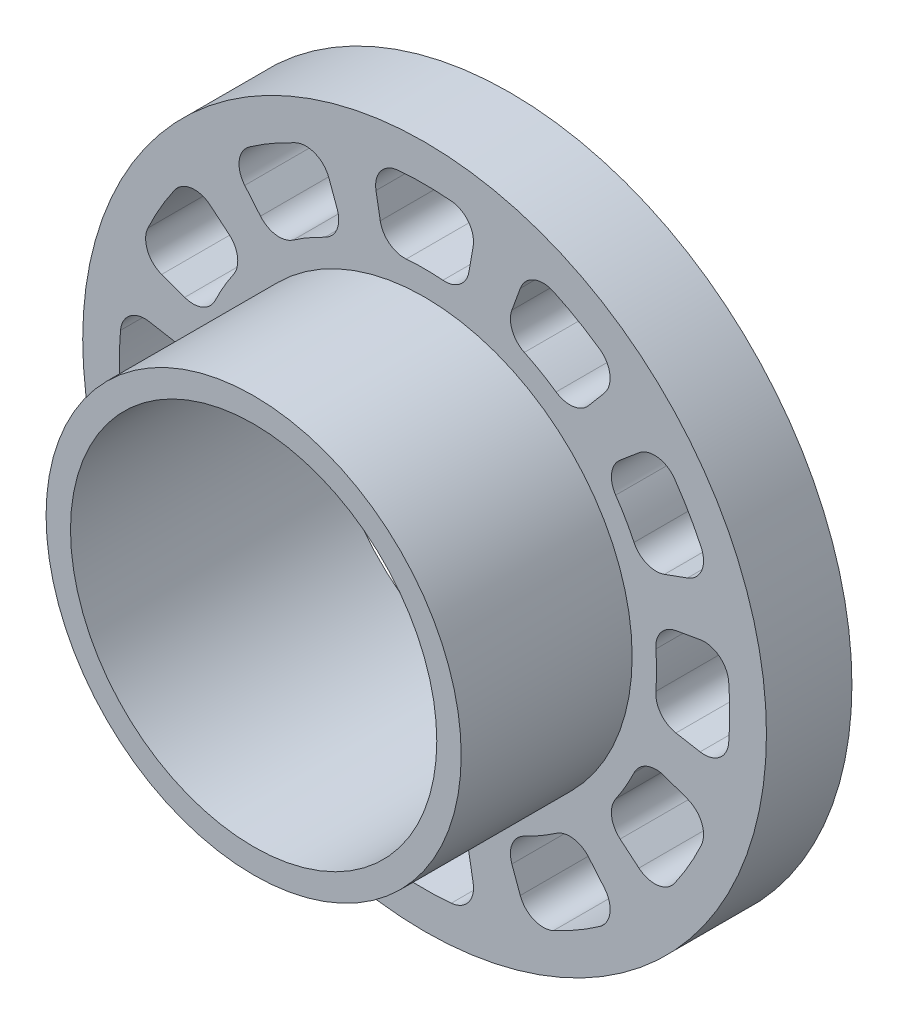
ISO-10303-21;
HEADER;
FILE_DESCRIPTION(('STEP AP214'),'2;1');
FILE_NAME('part.step','',(''),(''),'','','');
FILE_SCHEMA(('AUTOMOTIVE_DESIGN { 1 0 10303 214 1 1 1 1 }'));
ENDSEC;
DATA;
#1=APPLICATION_CONTEXT('core data for automotive mechanical design processes');
#2=APPLICATION_PROTOCOL_DEFINITION('international standard','automotive_design',2000,#1);
#3=PRODUCT_CONTEXT('',#1,'mechanical');
#4=PRODUCT('Part','Part','',(#3));
#5=PRODUCT_RELATED_PRODUCT_CATEGORY('part','',(#4));
#6=PRODUCT_DEFINITION_FORMATION('','',#4);
#7=PRODUCT_DEFINITION_CONTEXT('part definition',#1,'design');
#8=PRODUCT_DEFINITION('design','',#6,#7);
#9=PRODUCT_DEFINITION_SHAPE('','',#8);
#10=(LENGTH_UNIT() NAMED_UNIT(*) SI_UNIT(.MILLI.,.METRE.));
#11=(NAMED_UNIT(*) PLANE_ANGLE_UNIT() SI_UNIT($,.RADIAN.));
#12=(NAMED_UNIT(*) SI_UNIT($,.STERADIAN.) SOLID_ANGLE_UNIT());
#13=UNCERTAINTY_MEASURE_WITH_UNIT(LENGTH_MEASURE(1.E-05),#10,'distance_accuracy_value','');
#14=(GEOMETRIC_REPRESENTATION_CONTEXT(3) GLOBAL_UNCERTAINTY_ASSIGNED_CONTEXT((#13)) GLOBAL_UNIT_ASSIGNED_CONTEXT((#10,
#11,#12)) REPRESENTATION_CONTEXT('',''));
#15=CARTESIAN_POINT('',(0.,0.,0.));
#16=DIRECTION('',(0.,0.,1.));
#17=DIRECTION('',(1.,0.,0.));
#18=AXIS2_PLACEMENT_3D('',#15,#16,#17);
#19=CARTESIAN_POINT('',(0.,0.,3.5));
#20=DIRECTION('',(0.,0.,1.));
#21=DIRECTION('',(1.,0.,0.));
#22=AXIS2_PLACEMENT_3D('',#19,#20,#21);
#23=PLANE('',#22);
#24=CARTESIAN_POINT('',(0.,0.,3.5));
#25=DIRECTION('',(0.,0.,-1.));
#26=DIRECTION('',(1.,0.,0.));
#27=AXIS2_PLACEMENT_3D('',#24,#25,#26);
#28=CIRCLE('',#27,9.5);
#29=CARTESIAN_POINT('',(-7.82591258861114,-5.38563758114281,3.5));
#30=VERTEX_POINT('',#29);
#31=CARTESIAN_POINT('',(-8.57705525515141,-4.08462031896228,3.5));
#32=VERTEX_POINT('',#31);
#33=EDGE_CURVE('E638',#30,#32,#28,.T.);
#34=ORIENTED_EDGE('',*,*,#33,.F.);
#35=CARTESIAN_POINT('',(-8.64969286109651,-5.95254680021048,3.5));
#36=DIRECTION('',(0.,0.,1.));
#37=DIRECTION('',(1.,0.,0.));
#38=AXIS2_PLACEMENT_3D('',#35,#36,#37);
#39=CIRCLE('',#38,0.999999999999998);
#40=CARTESIAN_POINT('',(-8.00690525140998,-6.71859124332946,3.5));
#41=VERTEX_POINT('',#40);
#42=EDGE_CURVE('E630',#41,#30,#39,.T.);
#43=ORIENTED_EDGE('',*,*,#42,.F.);
#44=DIRECTION('',(0.766044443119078,0.64278760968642,0.));
#45=VECTOR('',#44,1.);
#46=CARTESIAN_POINT('',(-8.00690525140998,-6.71859124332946,3.5));
#47=LINE('',#46,#45);
#48=CARTESIAN_POINT('',(-8.77614161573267,-7.36405719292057,3.5));
#49=VERTEX_POINT('',#48);
#50=EDGE_CURVE('E665',#49,#41,#47,.T.);
#51=ORIENTED_EDGE('',*,*,#50,.F.);
#52=CARTESIAN_POINT('',(-9.41892922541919,-6.59801274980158,3.5));
#53=DIRECTION('',(0.,0.,1.));
#54=DIRECTION('',(-1.,0.,0.));
#55=AXIS2_PLACEMENT_3D('',#52,#53,#54);
#56=CIRCLE('',#55,1.);
#57=CARTESIAN_POINT('',(-10.2379665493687,-7.17175298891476,3.5));
#58=VERTEX_POINT('',#57);
#59=EDGE_CURVE('E663',#58,#49,#56,.T.);
#60=ORIENTED_EDGE('',*,*,#59,.F.);
#61=CARTESIAN_POINT('',(0.,0.,3.5));
#62=DIRECTION('',(0.,0.,1.));
#63=DIRECTION('',(1.,0.,0.));
#64=AXIS2_PLACEMENT_3D('',#61,#62,#63);
#65=CIRCLE('',#64,12.5);
#66=CARTESIAN_POINT('',(-11.3299035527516,-5.28046262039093,3.5));
#67=VERTEX_POINT('',#66);
#68=EDGE_CURVE('E661',#67,#58,#65,.T.);
#69=ORIENTED_EDGE('',*,*,#68,.F.);
#70=CARTESIAN_POINT('',(-10.4235112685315,-4.85802561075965,3.5));
#71=DIRECTION('',(0.,0.,1.));
#72=DIRECTION('',(1.,0.,0.));
#73=AXIS2_PLACEMENT_3D('',#70,#71,#72);
#74=CIRCLE('',#73,1.);
#75=CARTESIAN_POINT('',(-10.7655314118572,-3.91833298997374,3.5));
#76=VERTEX_POINT('',#75);
#77=EDGE_CURVE('E659',#76,#67,#74,.T.);
#78=ORIENTED_EDGE('',*,*,#77,.F.);
#79=DIRECTION('',(-0.939692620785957,-0.342020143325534,0.));
#80=VECTOR('',#79,1.);
#81=CARTESIAN_POINT('',(-9.82192332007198,-3.57488773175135,3.5));
#82=LINE('',#81,#80);
#83=CARTESIAN_POINT('',(-9.82192332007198,-3.57488773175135,3.5));
#84=VERTEX_POINT('',#83);
#85=EDGE_CURVE('E654',#84,#76,#82,.T.);
#86=ORIENTED_EDGE('',*,*,#85,.F.);
#87=CARTESIAN_POINT('',(-9.4799031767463,-4.51458035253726,3.5));
#88=DIRECTION('',(0.,0.,1.));
#89=DIRECTION('',(-1.,0.,0.));
#90=AXIS2_PLACEMENT_3D('',#87,#88,#89);
#91=CIRCLE('',#90,1.);
#92=EDGE_CURVE('E652',#32,#84,#91,.T.);
#93=ORIENTED_EDGE('',*,*,#92,.F.);
#94=EDGE_LOOP('',(#34,#43,#51,#60,#69,#78,#86,#93));
#95=FACE_BOUND('',#94,.T.);
#96=CARTESIAN_POINT('',(0.,0.,3.5));
#97=DIRECTION('',(0.,0.,-1.));
#98=DIRECTION('',(1.,0.,0.));
#99=AXIS2_PLACEMENT_3D('',#96,#97,#98);
#100=CIRCLE('',#99,9.5);
#101=CARTESIAN_POINT('',(-4.08462031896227,-8.57705525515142,3.5));
#102=VERTEX_POINT('',#101);
#103=CARTESIAN_POINT('',(-5.3856375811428,-7.82591258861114,3.5));
#104=VERTEX_POINT('',#103);
#105=EDGE_CURVE('E700',#102,#104,#100,.T.);
#106=ORIENTED_EDGE('',*,*,#105,.F.);
#107=CARTESIAN_POINT('',(-4.51458035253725,-9.4799031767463,3.5));
#108=DIRECTION('',(0.,0.,1.));
#109=DIRECTION('',(1.,0.,0.));
#110=AXIS2_PLACEMENT_3D('',#107,#108,#109);
#111=CIRCLE('',#110,1.);
#112=CARTESIAN_POINT('',(-3.57488773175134,-9.82192332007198,3.5));
#113=VERTEX_POINT('',#112);
#114=EDGE_CURVE('E698',#113,#102,#111,.T.);
#115=ORIENTED_EDGE('',*,*,#114,.F.);
#116=DIRECTION('',(0.342020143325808,0.939692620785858,0.));
#117=VECTOR('',#116,1.);
#118=CARTESIAN_POINT('',(-3.57488773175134,-9.82192332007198,3.5));
#119=LINE('',#118,#117);
#120=CARTESIAN_POINT('',(-3.918332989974,-10.7655314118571,3.5));
#121=VERTEX_POINT('',#120);
#122=EDGE_CURVE('E714',#121,#113,#119,.T.);
#123=ORIENTED_EDGE('',*,*,#122,.F.);
#124=CARTESIAN_POINT('',(-4.85802561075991,-10.4235112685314,3.5));
#125=DIRECTION('',(0.,0.,1.));
#126=DIRECTION('',(-1.,0.,0.));
#127=AXIS2_PLACEMENT_3D('',#124,#125,#126);
#128=CIRCLE('',#127,1.);
#129=CARTESIAN_POINT('',(-5.2804626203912,-11.3299035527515,3.5));
#130=VERTEX_POINT('',#129);
#131=EDGE_CURVE('E711',#130,#121,#128,.T.);
#132=ORIENTED_EDGE('',*,*,#131,.F.);
#133=CARTESIAN_POINT('',(0.,0.,3.5));
#134=DIRECTION('',(0.,0.,1.));
#135=DIRECTION('',(1.,0.,0.));
#136=AXIS2_PLACEMENT_3D('',#133,#134,#135);
#137=CIRCLE('',#136,12.5);
#138=CARTESIAN_POINT('',(-7.17175298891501,-10.2379665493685,3.5));
#139=VERTEX_POINT('',#138);
#140=EDGE_CURVE('E709',#139,#130,#137,.T.);
#141=ORIENTED_EDGE('',*,*,#140,.F.);
#142=CARTESIAN_POINT('',(-6.59801274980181,-9.41892922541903,3.5));
#143=DIRECTION('',(0.,0.,1.));
#144=DIRECTION('',(1.,0.,0.));
#145=AXIS2_PLACEMENT_3D('',#142,#143,#144);
#146=CIRCLE('',#145,1.);
#147=CARTESIAN_POINT('',(-7.36405719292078,-8.77614161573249,3.5));
#148=VERTEX_POINT('',#147);
#149=EDGE_CURVE('E707',#148,#139,#146,.T.);
#150=ORIENTED_EDGE('',*,*,#149,.F.);
#151=DIRECTION('',(-0.642787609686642,-0.766044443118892,0.));
#152=VECTOR('',#151,1.);
#153=CARTESIAN_POINT('',(-6.71859124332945,-8.00690525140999,3.5));
#154=LINE('',#153,#152);
#155=CARTESIAN_POINT('',(-6.71859124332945,-8.00690525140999,3.5));
#156=VERTEX_POINT('',#155);
#157=EDGE_CURVE('E705',#156,#148,#154,.T.);
#158=ORIENTED_EDGE('',*,*,#157,.F.);
#159=CARTESIAN_POINT('',(-5.95254680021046,-8.64969286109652,3.5));
#160=DIRECTION('',(0.,0.,1.));
#161=DIRECTION('',(-1.,0.,0.));
#162=AXIS2_PLACEMENT_3D('',#159,#160,#161);
#163=CIRCLE('',#162,1.);
#164=EDGE_CURVE('E703',#104,#156,#163,.T.);
#165=ORIENTED_EDGE('',*,*,#164,.F.);
#166=EDGE_LOOP('',(#106,#115,#123,#132,#141,#150,#158,#165));
#167=FACE_BOUND('',#166,.T.);
#168=CARTESIAN_POINT('',(0.,0.,3.5));
#169=DIRECTION('',(0.,0.,-1.));
#170=DIRECTION('',(1.,0.,0.));
#171=AXIS2_PLACEMENT_3D('',#168,#169,#170);
#172=CIRCLE('',#171,9.5);
#173=CARTESIAN_POINT('',(0.751142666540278,-9.47025790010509,3.5));
#174=VERTEX_POINT('',#173);
#175=CARTESIAN_POINT('',(-0.751142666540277,-9.47025790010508,3.5));
#176=VERTEX_POINT('',#175);
#177=EDGE_CURVE('E759',#174,#176,#172,.T.);
#178=ORIENTED_EDGE('',*,*,#177,.F.);
#179=CARTESIAN_POINT('',(0.830210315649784,-10.4671271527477,3.5));
#180=DIRECTION('',(0.,0.,1.));
#181=DIRECTION('',(1.,0.,0.));
#182=AXIS2_PLACEMENT_3D('',#179,#180,#181);
#183=CIRCLE('',#182,0.999999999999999);
#184=CARTESIAN_POINT('',(1.81501806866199,-10.2934789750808,3.5));
#185=VERTEX_POINT('',#184);
#186=EDGE_CURVE('E757',#185,#174,#183,.T.);
#187=ORIENTED_EDGE('',*,*,#186,.F.);
#188=DIRECTION('',(-0.173648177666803,0.98480775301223,0.));
#189=VECTOR('',#188,1.);
#190=CARTESIAN_POINT('',(1.81501806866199,-10.2934789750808,3.5));
#191=LINE('',#190,#189);
#192=CARTESIAN_POINT('',(1.98938979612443,-11.2823901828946,3.5));
#193=VERTEX_POINT('',#192);
#194=EDGE_CURVE('E773',#193,#185,#191,.T.);
#195=ORIENTED_EDGE('',*,*,#194,.F.);
#196=CARTESIAN_POINT('',(1.00458204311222,-11.4560383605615,3.5));
#197=DIRECTION('',(0.,0.,1.));
#198=DIRECTION('',(-1.,0.,0.));
#199=AXIS2_PLACEMENT_3D('',#196,#197,#198);
#200=CIRCLE('',#199,1.);
#201=CARTESIAN_POINT('',(1.09193700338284,-12.452215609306,3.5));
#202=VERTEX_POINT('',#201);
#203=EDGE_CURVE('E770',#202,#193,#200,.T.);
#204=ORIENTED_EDGE('',*,*,#203,.F.);
#205=CARTESIAN_POINT('',(0.,0.,3.5));
#206=DIRECTION('',(0.,0.,1.));
#207=DIRECTION('',(1.,0.,0.));
#208=AXIS2_PLACEMENT_3D('',#205,#206,#207);
#209=CIRCLE('',#208,12.5);
#210=CARTESIAN_POINT('',(-1.09193700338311,-12.452215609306,3.5));
#211=VERTEX_POINT('',#210);
#212=EDGE_CURVE('E768',#211,#202,#209,.T.);
#213=ORIENTED_EDGE('',*,*,#212,.F.);
#214=CARTESIAN_POINT('',(-1.00458204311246,-11.4560383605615,3.5));
#215=DIRECTION('',(0.,0.,1.));
#216=DIRECTION('',(1.,0.,0.));
#217=AXIS2_PLACEMENT_3D('',#214,#215,#216);
#218=CIRCLE('',#217,1.);
#219=CARTESIAN_POINT('',(-1.98938979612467,-11.2823901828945,3.5));
#220=VERTEX_POINT('',#219);
#221=EDGE_CURVE('E766',#220,#211,#218,.T.);
#222=ORIENTED_EDGE('',*,*,#221,.F.);
#223=DIRECTION('',(-0.173648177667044,-0.984807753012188,0.));
#224=VECTOR('',#223,1.);
#225=CARTESIAN_POINT('',(-1.81501806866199,-10.2934789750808,3.5));
#226=LINE('',#225,#224);
#227=CARTESIAN_POINT('',(-1.81501806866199,-10.2934789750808,3.5));
#228=VERTEX_POINT('',#227);
#229=EDGE_CURVE('E764',#228,#220,#226,.T.);
#230=ORIENTED_EDGE('',*,*,#229,.F.);
#231=CARTESIAN_POINT('',(-0.83021031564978,-10.4671271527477,3.5));
#232=DIRECTION('',(0.,0.,1.));
#233=DIRECTION('',(-1.,0.,0.));
#234=AXIS2_PLACEMENT_3D('',#231,#232,#233);
#235=CIRCLE('',#234,0.999999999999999);
#236=EDGE_CURVE('E762',#176,#228,#235,.T.);
#237=ORIENTED_EDGE('',*,*,#236,.F.);
#238=EDGE_LOOP('',(#178,#187,#195,#204,#213,#222,#230,#237));
#239=FACE_BOUND('',#238,.T.);
#240=CARTESIAN_POINT('',(0.,0.,3.5));
#241=DIRECTION('',(0.,0.,-1.));
#242=DIRECTION('',(1.,0.,0.));
#243=AXIS2_PLACEMENT_3D('',#240,#241,#242);
#244=CIRCLE('',#243,9.5);
#245=CARTESIAN_POINT('',(5.38563758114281,-7.82591258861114,3.5));
#246=VERTEX_POINT('',#245);
#247=CARTESIAN_POINT('',(4.08462031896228,-8.57705525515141,3.5));
#248=VERTEX_POINT('',#247);
#249=EDGE_CURVE('E818',#246,#248,#244,.T.);
#250=ORIENTED_EDGE('',*,*,#249,.F.);
#251=CARTESIAN_POINT('',(5.95254680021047,-8.64969286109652,3.5));
#252=DIRECTION('',(0.,0.,1.));
#253=DIRECTION('',(1.,0.,0.));
#254=AXIS2_PLACEMENT_3D('',#251,#252,#253);
#255=CIRCLE('',#254,1.);
#256=CARTESIAN_POINT('',(6.71859124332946,-8.00690525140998,3.5));
#257=VERTEX_POINT('',#256);
#258=EDGE_CURVE('E816',#257,#246,#255,.T.);
#259=ORIENTED_EDGE('',*,*,#258,.F.);
#260=DIRECTION('',(-0.642787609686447,0.766044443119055,0.));
#261=VECTOR('',#260,1.);
#262=CARTESIAN_POINT('',(6.71859124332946,-8.00690525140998,3.5));
#263=LINE('',#262,#261);
#264=CARTESIAN_POINT('',(7.3640571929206,-8.77614161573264,3.5));
#265=VERTEX_POINT('',#264);
#266=EDGE_CURVE('E832',#265,#257,#263,.T.);
#267=ORIENTED_EDGE('',*,*,#266,.F.);
#268=CARTESIAN_POINT('',(6.59801274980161,-9.41892922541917,3.5));
#269=DIRECTION('',(0.,0.,1.));
#270=DIRECTION('',(-1.,0.,0.));
#271=AXIS2_PLACEMENT_3D('',#268,#269,#270);
#272=CIRCLE('',#271,1.);
#273=CARTESIAN_POINT('',(7.1717529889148,-10.2379665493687,3.5));
#274=VERTEX_POINT('',#273);
#275=EDGE_CURVE('E829',#274,#265,#272,.T.);
#276=ORIENTED_EDGE('',*,*,#275,.F.);
#277=CARTESIAN_POINT('',(0.,0.,3.5));
#278=DIRECTION('',(0.,0.,1.));
#279=DIRECTION('',(1.,0.,0.));
#280=AXIS2_PLACEMENT_3D('',#277,#278,#279);
#281=CIRCLE('',#280,12.5);
#282=CARTESIAN_POINT('',(5.28046262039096,-11.3299035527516,3.5));
#283=VERTEX_POINT('',#282);
#284=EDGE_CURVE('E827',#283,#274,#281,.T.);
#285=ORIENTED_EDGE('',*,*,#284,.F.);
#286=CARTESIAN_POINT('',(4.85802561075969,-10.4235112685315,3.5));
#287=DIRECTION('',(0.,0.,1.));
#288=DIRECTION('',(1.,0.,0.));
#289=AXIS2_PLACEMENT_3D('',#286,#287,#288);
#290=CIRCLE('',#289,1.);
#291=CARTESIAN_POINT('',(3.91833298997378,-10.7655314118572,3.5));
#292=VERTEX_POINT('',#291);
#293=EDGE_CURVE('E825',#292,#283,#290,.T.);
#294=ORIENTED_EDGE('',*,*,#293,.F.);
#295=DIRECTION('',(0.342020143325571,-0.939692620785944,0.));
#296=VECTOR('',#295,1.);
#297=CARTESIAN_POINT('',(3.57488773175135,-9.82192332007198,3.5));
#298=LINE('',#297,#296);
#299=CARTESIAN_POINT('',(3.57488773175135,-9.82192332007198,3.5));
#300=VERTEX_POINT('',#299);
#301=EDGE_CURVE('E823',#300,#292,#298,.T.);
#302=ORIENTED_EDGE('',*,*,#301,.F.);
#303=CARTESIAN_POINT('',(4.51458035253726,-9.4799031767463,3.5));
#304=DIRECTION('',(0.,0.,1.));
#305=DIRECTION('',(-1.,0.,0.));
#306=AXIS2_PLACEMENT_3D('',#303,#304,#305);
#307=CIRCLE('',#306,1.);
#308=EDGE_CURVE('E821',#248,#300,#307,.T.);
#309=ORIENTED_EDGE('',*,*,#308,.F.);
#310=EDGE_LOOP('',(#250,#259,#267,#276,#285,#294,#302,#309));
#311=FACE_BOUND('',#310,.T.);
#312=CARTESIAN_POINT('',(0.,0.,3.5));
#313=DIRECTION('',(0.,0.,-1.));
#314=DIRECTION('',(1.,0.,0.));
#315=AXIS2_PLACEMENT_3D('',#312,#313,#314);
#316=CIRCLE('',#315,9.5);
#317=CARTESIAN_POINT('',(8.57705525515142,-4.08462031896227,3.5));
#318=VERTEX_POINT('',#317);
#319=CARTESIAN_POINT('',(7.82591258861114,-5.3856375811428,3.5));
#320=VERTEX_POINT('',#319);
#321=EDGE_CURVE('E877',#318,#320,#316,.T.);
#322=ORIENTED_EDGE('',*,*,#321,.F.);
#323=CARTESIAN_POINT('',(9.4799031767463,-4.51458035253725,3.5));
#324=DIRECTION('',(0.,0.,1.));
#325=DIRECTION('',(1.,0.,0.));
#326=AXIS2_PLACEMENT_3D('',#323,#324,#325);
#327=CIRCLE('',#326,1.);
#328=CARTESIAN_POINT('',(9.82192332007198,-3.57488773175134,3.5));
#329=VERTEX_POINT('',#328);
#330=EDGE_CURVE('E875',#329,#318,#327,.T.);
#331=ORIENTED_EDGE('',*,*,#330,.F.);
#332=DIRECTION('',(-0.939692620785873,0.342020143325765,0.));
#333=VECTOR('',#332,1.);
#334=CARTESIAN_POINT('',(9.82192332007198,-3.57488773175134,3.5));
#335=LINE('',#334,#333);
#336=CARTESIAN_POINT('',(10.7655314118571,-3.91833298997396,3.5));
#337=VERTEX_POINT('',#336);
#338=EDGE_CURVE('E891',#337,#329,#335,.T.);
#339=ORIENTED_EDGE('',*,*,#338,.F.);
#340=CARTESIAN_POINT('',(10.4235112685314,-4.85802561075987,3.5));
#341=DIRECTION('',(0.,0.,1.));
#342=DIRECTION('',(-1.,0.,0.));
#343=AXIS2_PLACEMENT_3D('',#340,#341,#342);
#344=CIRCLE('',#343,1.);
#345=CARTESIAN_POINT('',(11.3299035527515,-5.28046262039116,3.5));
#346=VERTEX_POINT('',#345);
#347=EDGE_CURVE('E888',#346,#337,#344,.T.);
#348=ORIENTED_EDGE('',*,*,#347,.F.);
#349=CARTESIAN_POINT('',(0.,0.,3.5));
#350=DIRECTION('',(0.,0.,1.));
#351=DIRECTION('',(1.,0.,0.));
#352=AXIS2_PLACEMENT_3D('',#349,#350,#351);
#353=CIRCLE('',#352,12.5);
#354=CARTESIAN_POINT('',(10.2379665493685,-7.17175298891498,3.5));
#355=VERTEX_POINT('',#354);
#356=EDGE_CURVE('E886',#355,#346,#353,.T.);
#357=ORIENTED_EDGE('',*,*,#356,.F.);
#358=CARTESIAN_POINT('',(9.41892922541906,-6.59801274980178,3.5));
#359=DIRECTION('',(0.,0.,1.));
#360=DIRECTION('',(1.,0.,0.));
#361=AXIS2_PLACEMENT_3D('',#358,#359,#360);
#362=CIRCLE('',#361,1.);
#363=CARTESIAN_POINT('',(8.77614161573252,-7.36405719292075,3.5));
#364=VERTEX_POINT('',#363);
#365=EDGE_CURVE('E884',#364,#355,#362,.T.);
#366=ORIENTED_EDGE('',*,*,#365,.F.);
#367=DIRECTION('',(0.766044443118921,-0.642787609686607,0.));
#368=VECTOR('',#367,1.);
#369=CARTESIAN_POINT('',(8.00690525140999,-6.71859124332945,3.5));
#370=LINE('',#369,#368);
#371=CARTESIAN_POINT('',(8.00690525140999,-6.71859124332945,3.5));
#372=VERTEX_POINT('',#371);
#373=EDGE_CURVE('E882',#372,#364,#370,.T.);
#374=ORIENTED_EDGE('',*,*,#373,.F.);
#375=CARTESIAN_POINT('',(8.64969286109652,-5.95254680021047,3.5));
#376=DIRECTION('',(0.,0.,1.));
#377=DIRECTION('',(-1.,0.,0.));
#378=AXIS2_PLACEMENT_3D('',#375,#376,#377);
#379=CIRCLE('',#378,1.);
#380=EDGE_CURVE('E880',#320,#372,#379,.T.);
#381=ORIENTED_EDGE('',*,*,#380,.F.);
#382=EDGE_LOOP('',(#322,#331,#339,#348,#357,#366,#374,#381));
#383=FACE_BOUND('',#382,.T.);
#384=CARTESIAN_POINT('',(0.,0.,3.5));
#385=DIRECTION('',(0.,0.,-1.));
#386=DIRECTION('',(1.,0.,0.));
#387=AXIS2_PLACEMENT_3D('',#384,#385,#386);
#388=CIRCLE('',#387,9.5);
#389=CARTESIAN_POINT('',(9.47025790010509,0.751142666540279,3.5));
#390=VERTEX_POINT('',#389);
#391=CARTESIAN_POINT('',(9.47025790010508,-0.751142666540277,3.5));
#392=VERTEX_POINT('',#391);
#393=EDGE_CURVE('E936',#390,#392,#388,.T.);
#394=ORIENTED_EDGE('',*,*,#393,.F.);
#395=CARTESIAN_POINT('',(10.4671271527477,0.830210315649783,3.5));
#396=DIRECTION('',(0.,0.,1.));
#397=DIRECTION('',(1.,0.,0.));
#398=AXIS2_PLACEMENT_3D('',#395,#396,#397);
#399=CIRCLE('',#398,0.999999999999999);
#400=CARTESIAN_POINT('',(10.2934789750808,1.81501806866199,3.5));
#401=VERTEX_POINT('',#400);
#402=EDGE_CURVE('E934',#401,#390,#399,.T.);
#403=ORIENTED_EDGE('',*,*,#402,.F.);
#404=DIRECTION('',(-0.984807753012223,-0.173648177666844,0.));
#405=VECTOR('',#404,1.);
#406=CARTESIAN_POINT('',(10.2934789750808,1.81501806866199,3.5));
#407=LINE('',#406,#405);
#408=CARTESIAN_POINT('',(11.2823901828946,1.98938979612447,3.5));
#409=VERTEX_POINT('',#408);
#410=EDGE_CURVE('E950',#409,#401,#407,.T.);
#411=ORIENTED_EDGE('',*,*,#410,.F.);
#412=CARTESIAN_POINT('',(11.4560383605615,1.00458204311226,3.5));
#413=DIRECTION('',(0.,0.,1.));
#414=DIRECTION('',(-1.,0.,0.));
#415=AXIS2_PLACEMENT_3D('',#412,#413,#414);
#416=CIRCLE('',#415,1.);
#417=CARTESIAN_POINT('',(12.452215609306,1.09193700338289,3.5));
#418=VERTEX_POINT('',#417);
#419=EDGE_CURVE('E947',#418,#409,#416,.T.);
#420=ORIENTED_EDGE('',*,*,#419,.F.);
#421=CARTESIAN_POINT('',(0.,0.,3.5));
#422=DIRECTION('',(0.,0.,1.));
#423=DIRECTION('',(1.,0.,0.));
#424=AXIS2_PLACEMENT_3D('',#421,#422,#423);
#425=CIRCLE('',#424,12.5);
#426=CARTESIAN_POINT('',(12.452215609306,-1.09193700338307,3.5));
#427=VERTEX_POINT('',#426);
#428=EDGE_CURVE('E945',#427,#418,#425,.T.);
#429=ORIENTED_EDGE('',*,*,#428,.F.);
#430=CARTESIAN_POINT('',(11.4560383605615,-1.00458204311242,3.5));
#431=DIRECTION('',(0.,0.,1.));
#432=DIRECTION('',(1.,0.,0.));
#433=AXIS2_PLACEMENT_3D('',#430,#431,#432);
#434=CIRCLE('',#433,1.);
#435=CARTESIAN_POINT('',(11.2823901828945,-1.98938979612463,3.5));
#436=VERTEX_POINT('',#435);
#437=EDGE_CURVE('E943',#436,#427,#434,.T.);
#438=ORIENTED_EDGE('',*,*,#437,.F.);
#439=DIRECTION('',(0.984807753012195,-0.173648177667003,0.));
#440=VECTOR('',#439,1.);
#441=CARTESIAN_POINT('',(10.2934789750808,-1.81501806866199,3.5));
#442=LINE('',#441,#440);
#443=CARTESIAN_POINT('',(10.2934789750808,-1.81501806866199,3.5));
#444=VERTEX_POINT('',#443);
#445=EDGE_CURVE('E941',#444,#436,#442,.T.);
#446=ORIENTED_EDGE('',*,*,#445,.F.);
#447=CARTESIAN_POINT('',(10.4671271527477,-0.83021031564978,3.5));
#448=DIRECTION('',(0.,0.,1.));
#449=DIRECTION('',(-1.,0.,0.));
#450=AXIS2_PLACEMENT_3D('',#447,#448,#449);
#451=CIRCLE('',#450,0.999999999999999);
#452=EDGE_CURVE('E939',#392,#444,#451,.T.);
#453=ORIENTED_EDGE('',*,*,#452,.F.);
#454=EDGE_LOOP('',(#394,#403,#411,#420,#429,#438,#446,#453));
#455=FACE_BOUND('',#454,.T.);
#456=CARTESIAN_POINT('',(0.,0.,3.5));
#457=DIRECTION('',(0.,0.,-1.));
#458=DIRECTION('',(1.,0.,0.));
#459=AXIS2_PLACEMENT_3D('',#456,#457,#458);
#460=CIRCLE('',#459,9.5);
#461=CARTESIAN_POINT('',(7.82591258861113,5.38563758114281,3.5));
#462=VERTEX_POINT('',#461);
#463=CARTESIAN_POINT('',(8.57705525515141,4.08462031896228,3.5));
#464=VERTEX_POINT('',#463);
#465=EDGE_CURVE('E995',#462,#464,#460,.T.);
#466=ORIENTED_EDGE('',*,*,#465,.F.);
#467=CARTESIAN_POINT('',(8.64969286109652,5.95254680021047,3.5));
#468=DIRECTION('',(0.,0.,1.));
#469=DIRECTION('',(1.,0.,0.));
#470=AXIS2_PLACEMENT_3D('',#467,#468,#469);
#471=CIRCLE('',#470,1.);
#472=CARTESIAN_POINT('',(8.00690525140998,6.71859124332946,3.5));
#473=VERTEX_POINT('',#472);
#474=EDGE_CURVE('E993',#473,#462,#471,.T.);
#475=ORIENTED_EDGE('',*,*,#474,.F.);
#476=DIRECTION('',(-0.766044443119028,-0.64278760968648,0.));
#477=VECTOR('',#476,1.);
#478=CARTESIAN_POINT('',(8.00690525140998,6.71859124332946,3.5));
#479=LINE('',#478,#477);
#480=CARTESIAN_POINT('',(8.77614161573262,7.36405719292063,3.5));
#481=VERTEX_POINT('',#480);
#482=EDGE_CURVE('E1009',#481,#473,#479,.T.);
#483=ORIENTED_EDGE('',*,*,#482,.F.);
#484=CARTESIAN_POINT('',(9.41892922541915,6.59801274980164,3.5));
#485=DIRECTION('',(0.,0.,1.));
#486=DIRECTION('',(-1.,0.,0.));
#487=AXIS2_PLACEMENT_3D('',#484,#485,#486);
#488=CIRCLE('',#487,1.);
#489=CARTESIAN_POINT('',(10.2379665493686,7.17175298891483,3.5));
#490=VERTEX_POINT('',#489);
#491=EDGE_CURVE('E1006',#490,#481,#488,.T.);
#492=ORIENTED_EDGE('',*,*,#491,.F.);
#493=CARTESIAN_POINT('',(0.,0.,3.5));
#494=DIRECTION('',(0.,0.,1.));
#495=DIRECTION('',(1.,0.,0.));
#496=AXIS2_PLACEMENT_3D('',#493,#494,#495);
#497=CIRCLE('',#496,12.5);
#498=CARTESIAN_POINT('',(11.3299035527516,5.280462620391,3.5));
#499=VERTEX_POINT('',#498);
#500=EDGE_CURVE('E1004',#499,#490,#497,.T.);
#501=ORIENTED_EDGE('',*,*,#500,.F.);
#502=CARTESIAN_POINT('',(10.4235112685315,4.85802561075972,3.5));
#503=DIRECTION('',(0.,0.,1.));
#504=DIRECTION('',(1.,0.,0.));
#505=AXIS2_PLACEMENT_3D('',#502,#503,#504);
#506=CIRCLE('',#505,1.);
#507=CARTESIAN_POINT('',(10.7655314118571,3.91833298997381,3.5));
#508=VERTEX_POINT('',#507);
#509=EDGE_CURVE('E1002',#508,#499,#506,.T.);
#510=ORIENTED_EDGE('',*,*,#509,.F.);
#511=DIRECTION('',(0.93969262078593,0.342020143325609,0.));
#512=VECTOR('',#511,1.);
#513=CARTESIAN_POINT('',(9.82192332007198,3.57488773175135,3.5));
#514=LINE('',#513,#512);
#515=CARTESIAN_POINT('',(9.82192332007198,3.57488773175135,3.5));
#516=VERTEX_POINT('',#515);
#517=EDGE_CURVE('E1000',#516,#508,#514,.T.);
#518=ORIENTED_EDGE('',*,*,#517,.F.);
#519=CARTESIAN_POINT('',(9.4799031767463,4.51458035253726,3.5));
#520=DIRECTION('',(0.,0.,1.));
#521=DIRECTION('',(-1.,0.,0.));
#522=AXIS2_PLACEMENT_3D('',#519,#520,#521);
#523=CIRCLE('',#522,1.);
#524=EDGE_CURVE('E998',#464,#516,#523,.T.);
#525=ORIENTED_EDGE('',*,*,#524,.F.);
#526=EDGE_LOOP('',(#466,#475,#483,#492,#501,#510,#518,#525));
#527=FACE_BOUND('',#526,.T.);
#528=CARTESIAN_POINT('',(0.,0.,3.5));
#529=DIRECTION('',(0.,0.,-1.));
#530=DIRECTION('',(1.,0.,0.));
#531=AXIS2_PLACEMENT_3D('',#528,#529,#530);
#532=CIRCLE('',#531,9.5);
#533=CARTESIAN_POINT('',(4.08462031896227,8.57705525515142,3.5));
#534=VERTEX_POINT('',#533);
#535=CARTESIAN_POINT('',(5.3856375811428,7.82591258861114,3.5));
#536=VERTEX_POINT('',#535);
#537=EDGE_CURVE('E1054',#534,#536,#532,.T.);
#538=ORIENTED_EDGE('',*,*,#537,.F.);
#539=CARTESIAN_POINT('',(4.51458035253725,9.4799031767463,3.5));
#540=DIRECTION('',(0.,0.,1.));
#541=DIRECTION('',(1.,0.,0.));
#542=AXIS2_PLACEMENT_3D('',#539,#540,#541);
#543=CIRCLE('',#542,1.);
#544=CARTESIAN_POINT('',(3.57488773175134,9.82192332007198,3.5));
#545=VERTEX_POINT('',#544);
#546=EDGE_CURVE('E1052',#545,#534,#543,.T.);
#547=ORIENTED_EDGE('',*,*,#546,.F.);
#548=DIRECTION('',(-0.342020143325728,-0.939692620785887,0.));
#549=VECTOR('',#548,1.);
#550=CARTESIAN_POINT('',(3.57488773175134,9.82192332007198,3.5));
#551=LINE('',#550,#549);
#552=CARTESIAN_POINT('',(3.91833298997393,10.7655314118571,3.5));
#553=VERTEX_POINT('',#552);
#554=EDGE_CURVE('E1068',#553,#545,#551,.T.);
#555=ORIENTED_EDGE('',*,*,#554,.F.);
#556=CARTESIAN_POINT('',(4.85802561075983,10.4235112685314,3.5));
#557=DIRECTION('',(0.,0.,1.));
#558=DIRECTION('',(-1.,0.,0.));
#559=AXIS2_PLACEMENT_3D('',#556,#557,#558);
#560=CIRCLE('',#559,1.);
#561=CARTESIAN_POINT('',(5.28046262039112,11.3299035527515,3.5));
#562=VERTEX_POINT('',#561);
#563=EDGE_CURVE('E1065',#562,#553,#560,.T.);
#564=ORIENTED_EDGE('',*,*,#563,.F.);
#565=CARTESIAN_POINT('',(0.,0.,3.5));
#566=DIRECTION('',(0.,0.,1.));
#567=DIRECTION('',(1.,0.,0.));
#568=AXIS2_PLACEMENT_3D('',#565,#566,#567);
#569=CIRCLE('',#568,12.5);
#570=CARTESIAN_POINT('',(7.17175298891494,10.2379665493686,3.5));
#571=VERTEX_POINT('',#570);
#572=EDGE_CURVE('E1063',#571,#562,#569,.T.);
#573=ORIENTED_EDGE('',*,*,#572,.F.);
#574=CARTESIAN_POINT('',(6.59801274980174,9.41892922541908,3.5));
#575=DIRECTION('',(0.,0.,1.));
#576=DIRECTION('',(1.,0.,0.));
#577=AXIS2_PLACEMENT_3D('',#574,#575,#576);
#578=CIRCLE('',#577,1.);
#579=CARTESIAN_POINT('',(7.36405719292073,8.77614161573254,3.5));
#580=VERTEX_POINT('',#579);
#581=EDGE_CURVE('E1061',#580,#571,#578,.T.);
#582=ORIENTED_EDGE('',*,*,#581,.F.);
#583=DIRECTION('',(0.642787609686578,0.766044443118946,0.));
#584=VECTOR('',#583,1.);
#585=CARTESIAN_POINT('',(6.71859124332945,8.00690525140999,3.5));
#586=LINE('',#585,#584);
#587=CARTESIAN_POINT('',(6.71859124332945,8.00690525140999,3.5));
#588=VERTEX_POINT('',#587);
#589=EDGE_CURVE('E1059',#588,#580,#586,.T.);
#590=ORIENTED_EDGE('',*,*,#589,.F.);
#591=CARTESIAN_POINT('',(5.95254680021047,8.64969286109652,3.5));
#592=DIRECTION('',(0.,0.,1.));
#593=DIRECTION('',(-1.,0.,0.));
#594=AXIS2_PLACEMENT_3D('',#591,#592,#593);
#595=CIRCLE('',#594,1.);
#596=EDGE_CURVE('E1057',#536,#588,#595,.T.);
#597=ORIENTED_EDGE('',*,*,#596,.F.);
#598=EDGE_LOOP('',(#538,#547,#555,#564,#573,#582,#590,#597));
#599=FACE_BOUND('',#598,.T.);
#600=CARTESIAN_POINT('',(0.,0.,3.5));
#601=DIRECTION('',(0.,0.,-1.));
#602=DIRECTION('',(1.,0.,0.));
#603=AXIS2_PLACEMENT_3D('',#600,#601,#602);
#604=CIRCLE('',#603,9.5);
#605=CARTESIAN_POINT('',(-0.751142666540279,9.47025790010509,3.5));
#606=VERTEX_POINT('',#605);
#607=CARTESIAN_POINT('',(0.751142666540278,9.47025790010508,3.5));
#608=VERTEX_POINT('',#607);
#609=EDGE_CURVE('E1113',#606,#608,#604,.T.);
#610=ORIENTED_EDGE('',*,*,#609,.F.);
#611=CARTESIAN_POINT('',(-0.830210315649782,10.4671271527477,3.5));
#612=DIRECTION('',(0.,0.,1.));
#613=DIRECTION('',(1.,0.,0.));
#614=AXIS2_PLACEMENT_3D('',#611,#612,#613);
#615=CIRCLE('',#614,0.999999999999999);
#616=CARTESIAN_POINT('',(-1.81501806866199,10.2934789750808,3.5));
#617=VERTEX_POINT('',#616);
#618=EDGE_CURVE('E1111',#617,#606,#615,.T.);
#619=ORIENTED_EDGE('',*,*,#618,.F.);
#620=DIRECTION('',(0.173648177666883,-0.984807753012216,0.));
#621=VECTOR('',#620,1.);
#622=CARTESIAN_POINT('',(-1.81501806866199,10.2934789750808,3.5));
#623=LINE('',#622,#621);
#624=CARTESIAN_POINT('',(-1.98938979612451,11.2823901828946,3.5));
#625=VERTEX_POINT('',#624);
#626=EDGE_CURVE('E1127',#625,#617,#623,.T.);
#627=ORIENTED_EDGE('',*,*,#626,.F.);
#628=CARTESIAN_POINT('',(-1.0045820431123,11.4560383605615,3.5));
#629=DIRECTION('',(0.,0.,1.));
#630=DIRECTION('',(-1.,0.,0.));
#631=AXIS2_PLACEMENT_3D('',#628,#629,#630);
#632=CIRCLE('',#631,1.);
#633=CARTESIAN_POINT('',(-1.09193700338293,12.452215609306,3.5));
#634=VERTEX_POINT('',#633);
#635=EDGE_CURVE('E1124',#634,#625,#632,.T.);
#636=ORIENTED_EDGE('',*,*,#635,.F.);
#637=CARTESIAN_POINT('',(0.,0.,3.5));
#638=DIRECTION('',(0.,0.,1.));
#639=DIRECTION('',(1.,0.,0.));
#640=AXIS2_PLACEMENT_3D('',#637,#638,#639);
#641=CIRCLE('',#640,12.5);
#642=CARTESIAN_POINT('',(1.09193700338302,12.452215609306,3.5));
#643=VERTEX_POINT('',#642);
#644=EDGE_CURVE('E1122',#643,#634,#641,.T.);
#645=ORIENTED_EDGE('',*,*,#644,.F.);
#646=CARTESIAN_POINT('',(1.00458204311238,11.4560383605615,3.5));
#647=DIRECTION('',(0.,0.,1.));
#648=DIRECTION('',(1.,0.,0.));
#649=AXIS2_PLACEMENT_3D('',#646,#647,#648);
#650=CIRCLE('',#649,1.);
#651=CARTESIAN_POINT('',(1.98938979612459,11.2823901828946,3.5));
#652=VERTEX_POINT('',#651);
#653=EDGE_CURVE('E1120',#652,#643,#650,.T.);
#654=ORIENTED_EDGE('',*,*,#653,.F.);
#655=DIRECTION('',(0.173648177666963,0.984807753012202,0.));
#656=VECTOR('',#655,1.);
#657=CARTESIAN_POINT('',(1.81501806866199,10.2934789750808,3.5));
#658=LINE('',#657,#656);
#659=CARTESIAN_POINT('',(1.81501806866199,10.2934789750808,3.5));
#660=VERTEX_POINT('',#659);
#661=EDGE_CURVE('E1118',#660,#652,#658,.T.);
#662=ORIENTED_EDGE('',*,*,#661,.F.);
#663=CARTESIAN_POINT('',(0.830210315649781,10.4671271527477,3.5));
#664=DIRECTION('',(0.,0.,1.));
#665=DIRECTION('',(-1.,0.,0.));
#666=AXIS2_PLACEMENT_3D('',#663,#664,#665);
#667=CIRCLE('',#666,0.999999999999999);
#668=EDGE_CURVE('E1116',#608,#660,#667,.T.);
#669=ORIENTED_EDGE('',*,*,#668,.F.);
#670=EDGE_LOOP('',(#610,#619,#627,#636,#645,#654,#662,#669));
#671=FACE_BOUND('',#670,.T.);
#672=CARTESIAN_POINT('',(0.,0.,3.5));
#673=DIRECTION('',(0.,0.,-1.));
#674=DIRECTION('',(1.,0.,0.));
#675=AXIS2_PLACEMENT_3D('',#672,#673,#674);
#676=CIRCLE('',#675,9.5);
#677=CARTESIAN_POINT('',(-5.38563758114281,7.82591258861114,3.5));
#678=VERTEX_POINT('',#677);
#679=CARTESIAN_POINT('',(-4.08462031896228,8.57705525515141,3.5));
#680=VERTEX_POINT('',#679);
#681=EDGE_CURVE('E1172',#678,#680,#676,.T.);
#682=ORIENTED_EDGE('',*,*,#681,.F.);
#683=CARTESIAN_POINT('',(-5.95254680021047,8.64969286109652,3.5));
#684=DIRECTION('',(0.,0.,1.));
#685=DIRECTION('',(1.,0.,0.));
#686=AXIS2_PLACEMENT_3D('',#683,#684,#685);
#687=CIRCLE('',#686,1.);
#688=CARTESIAN_POINT('',(-6.71859124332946,8.00690525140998,3.5));
#689=VERTEX_POINT('',#688);
#690=EDGE_CURVE('E1170',#689,#678,#687,.T.);
#691=ORIENTED_EDGE('',*,*,#690,.F.);
#692=DIRECTION('',(0.642787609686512,-0.766044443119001,0.));
#693=VECTOR('',#692,1.);
#694=CARTESIAN_POINT('',(-6.71859124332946,8.00690525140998,3.5));
#695=LINE('',#694,#693);
#696=CARTESIAN_POINT('',(-7.36405719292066,8.77614161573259,3.5));
#697=VERTEX_POINT('',#696);
#698=EDGE_CURVE('E1186',#697,#689,#695,.T.);
#699=ORIENTED_EDGE('',*,*,#698,.F.);
#700=CARTESIAN_POINT('',(-6.59801274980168,9.41892922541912,3.5));
#701=DIRECTION('',(0.,0.,1.));
#702=DIRECTION('',(-1.,0.,0.));
#703=AXIS2_PLACEMENT_3D('',#700,#701,#702);
#704=CIRCLE('',#703,1.);
#705=CARTESIAN_POINT('',(-7.17175298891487,10.2379665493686,3.5));
#706=VERTEX_POINT('',#705);
#707=EDGE_CURVE('E1183',#706,#697,#704,.T.);
#708=ORIENTED_EDGE('',*,*,#707,.F.);
#709=CARTESIAN_POINT('',(0.,0.,3.5));
#710=DIRECTION('',(0.,0.,1.));
#711=DIRECTION('',(1.,0.,0.));
#712=AXIS2_PLACEMENT_3D('',#709,#710,#711);
#713=CIRCLE('',#712,12.5);
#714=CARTESIAN_POINT('',(-5.28046262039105,11.3299035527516,3.5));
#715=VERTEX_POINT('',#714);
#716=EDGE_CURVE('E1181',#715,#706,#713,.T.);
#717=ORIENTED_EDGE('',*,*,#716,.F.);
#718=CARTESIAN_POINT('',(-4.85802561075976,10.4235112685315,3.5));
#719=DIRECTION('',(0.,0.,1.));
#720=DIRECTION('',(1.,0.,0.));
#721=AXIS2_PLACEMENT_3D('',#718,#719,#720);
#722=CIRCLE('',#721,1.);
#723=CARTESIAN_POINT('',(-3.91833298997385,10.7655314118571,3.5));
#724=VERTEX_POINT('',#723);
#725=EDGE_CURVE('E1179',#724,#715,#722,.T.);
#726=ORIENTED_EDGE('',*,*,#725,.F.);
#727=DIRECTION('',(-0.342020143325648,0.939692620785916,0.));
#728=VECTOR('',#727,1.);
#729=CARTESIAN_POINT('',(-3.57488773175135,9.82192332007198,3.5));
#730=LINE('',#729,#728);
#731=CARTESIAN_POINT('',(-3.57488773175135,9.82192332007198,3.5));
#732=VERTEX_POINT('',#731);
#733=EDGE_CURVE('E1177',#732,#724,#730,.T.);
#734=ORIENTED_EDGE('',*,*,#733,.F.);
#735=CARTESIAN_POINT('',(-4.51458035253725,9.4799031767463,3.5));
#736=DIRECTION('',(0.,0.,1.));
#737=DIRECTION('',(-1.,0.,0.));
#738=AXIS2_PLACEMENT_3D('',#735,#736,#737);
#739=CIRCLE('',#738,0.999999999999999);
#740=EDGE_CURVE('E1175',#680,#732,#739,.T.);
#741=ORIENTED_EDGE('',*,*,#740,.F.);
#742=EDGE_LOOP('',(#682,#691,#699,#708,#717,#726,#734,#741));
#743=FACE_BOUND('',#742,.T.);
#744=CARTESIAN_POINT('',(0.,0.,3.5));
#745=DIRECTION('',(0.,0.,-1.));
#746=DIRECTION('',(1.,0.,0.));
#747=AXIS2_PLACEMENT_3D('',#744,#745,#746);
#748=CIRCLE('',#747,9.5);
#749=CARTESIAN_POINT('',(-8.57705525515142,4.08462031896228,3.5));
#750=VERTEX_POINT('',#749);
#751=CARTESIAN_POINT('',(-7.82591258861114,5.38563758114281,3.5));
#752=VERTEX_POINT('',#751);
#753=EDGE_CURVE('E1231',#750,#752,#748,.T.);
#754=ORIENTED_EDGE('',*,*,#753,.F.);
#755=CARTESIAN_POINT('',(-9.4799031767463,4.51458035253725,3.5));
#756=DIRECTION('',(0.,0.,1.));
#757=DIRECTION('',(1.,0.,0.));
#758=AXIS2_PLACEMENT_3D('',#755,#756,#757);
#759=CIRCLE('',#758,1.);
#760=CARTESIAN_POINT('',(-9.82192332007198,3.57488773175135,3.5));
#761=VERTEX_POINT('',#760);
#762=EDGE_CURVE('E1229',#761,#750,#759,.T.);
#763=ORIENTED_EDGE('',*,*,#762,.F.);
#764=DIRECTION('',(0.939692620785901,-0.34202014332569,0.));
#765=VECTOR('',#764,1.);
#766=CARTESIAN_POINT('',(-9.82192332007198,3.57488773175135,3.5));
#767=LINE('',#766,#765);
#768=CARTESIAN_POINT('',(-10.7655314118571,3.91833298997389,3.5));
#769=VERTEX_POINT('',#768);
#770=EDGE_CURVE('E1245',#769,#761,#767,.T.);
#771=ORIENTED_EDGE('',*,*,#770,.F.);
#772=CARTESIAN_POINT('',(-10.4235112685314,4.8580256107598,3.5));
#773=DIRECTION('',(0.,0.,1.));
#774=DIRECTION('',(-1.,0.,0.));
#775=AXIS2_PLACEMENT_3D('',#772,#773,#774);
#776=CIRCLE('',#775,1.);
#777=CARTESIAN_POINT('',(-11.3299035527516,5.28046262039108,3.5));
#778=VERTEX_POINT('',#777);
#779=EDGE_CURVE('E1242',#778,#769,#776,.T.);
#780=ORIENTED_EDGE('',*,*,#779,.F.);
#781=CARTESIAN_POINT('',(0.,0.,3.5));
#782=DIRECTION('',(0.,0.,1.));
#783=DIRECTION('',(1.,0.,0.));
#784=AXIS2_PLACEMENT_3D('',#781,#782,#783);
#785=CIRCLE('',#784,12.5);
#786=CARTESIAN_POINT('',(-10.2379665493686,7.1717529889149,3.5));
#787=VERTEX_POINT('',#786);
#788=EDGE_CURVE('E1240',#787,#778,#785,.T.);
#789=ORIENTED_EDGE('',*,*,#788,.F.);
#790=CARTESIAN_POINT('',(-9.4189292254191,6.59801274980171,3.5));
#791=DIRECTION('',(0.,0.,1.));
#792=DIRECTION('',(1.,0.,0.));
#793=AXIS2_PLACEMENT_3D('',#790,#791,#792);
#794=CIRCLE('',#793,1.);
#795=CARTESIAN_POINT('',(-8.77614161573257,7.36405719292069,3.5));
#796=VERTEX_POINT('',#795);
#797=EDGE_CURVE('E1238',#796,#787,#794,.T.);
#798=ORIENTED_EDGE('',*,*,#797,.F.);
#799=DIRECTION('',(-0.766044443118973,0.642787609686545,0.));
#800=VECTOR('',#799,1.);
#801=CARTESIAN_POINT('',(-8.00690525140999,6.71859124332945,3.5));
#802=LINE('',#801,#800);
#803=CARTESIAN_POINT('',(-8.00690525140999,6.71859124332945,3.5));
#804=VERTEX_POINT('',#803);
#805=EDGE_CURVE('E1236',#804,#796,#802,.T.);
#806=ORIENTED_EDGE('',*,*,#805,.F.);
#807=CARTESIAN_POINT('',(-8.64969286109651,5.95254680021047,3.5));
#808=DIRECTION('',(0.,0.,1.));
#809=DIRECTION('',(-1.,0.,0.));
#810=AXIS2_PLACEMENT_3D('',#807,#808,#809);
#811=CIRCLE('',#810,0.999999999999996);
#812=EDGE_CURVE('E1234',#752,#804,#811,.T.);
#813=ORIENTED_EDGE('',*,*,#812,.F.);
#814=EDGE_LOOP('',(#754,#763,#771,#780,#789,#798,#806,#813));
#815=FACE_BOUND('',#814,.T.);
#816=CARTESIAN_POINT('',(0.,0.,3.5));
#817=DIRECTION('',(0.,0.,1.));
#818=DIRECTION('',(1.,0.,0.));
#819=AXIS2_PLACEMENT_3D('',#816,#817,#818);
#820=CIRCLE('',#819,14.);
#821=CARTESIAN_POINT('',(14.,0.,3.5));
#822=VERTEX_POINT('',#821);
#823=EDGE_CURVE('E11',#822,#822,#820,.T.);
#824=ORIENTED_EDGE('',*,*,#823,.T.);
#825=EDGE_LOOP('',(#824));
#826=FACE_BOUND('',#825,.T.);
#827=CARTESIAN_POINT('',(0.,0.,3.5));
#828=DIRECTION('',(0.,0.,-1.));
#829=DIRECTION('',(1.,0.,0.));
#830=AXIS2_PLACEMENT_3D('',#827,#828,#829);
#831=CIRCLE('',#830,9.5);
#832=CARTESIAN_POINT('',(-9.47025790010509,-0.751142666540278,3.5));
#833=VERTEX_POINT('',#832);
#834=CARTESIAN_POINT('',(-9.47025790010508,0.751142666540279,3.5));
#835=VERTEX_POINT('',#834);
#836=EDGE_CURVE('E1293',#833,#835,#831,.T.);
#837=ORIENTED_EDGE('',*,*,#836,.F.);
#838=CARTESIAN_POINT('',(-10.4671271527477,-0.830210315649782,3.5));
#839=DIRECTION('',(0.,0.,1.));
#840=DIRECTION('',(1.,0.,0.));
#841=AXIS2_PLACEMENT_3D('',#838,#839,#840);
#842=CIRCLE('',#841,0.999999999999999);
#843=CARTESIAN_POINT('',(-10.2934789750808,-1.81501806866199,3.5));
#844=VERTEX_POINT('',#843);
#845=EDGE_CURVE('E1291',#844,#833,#842,.T.);
#846=ORIENTED_EDGE('',*,*,#845,.F.);
#847=DIRECTION('',(0.984807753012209,0.173648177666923,0.));
#848=VECTOR('',#847,1.);
#849=CARTESIAN_POINT('',(-10.2934789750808,-1.81501806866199,3.5));
#850=LINE('',#849,#848);
#851=CARTESIAN_POINT('',(-11.2823901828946,-1.98938979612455,3.5));
#852=VERTEX_POINT('',#851);
#853=EDGE_CURVE('E1307',#852,#844,#850,.T.);
#854=ORIENTED_EDGE('',*,*,#853,.F.);
#855=CARTESIAN_POINT('',(-11.4560383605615,-1.00458204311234,3.5));
#856=DIRECTION('',(0.,0.,1.));
#857=DIRECTION('',(-1.,0.,0.));
#858=AXIS2_PLACEMENT_3D('',#855,#856,#857);
#859=CIRCLE('',#858,1.);
#860=CARTESIAN_POINT('',(-12.452215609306,-1.09193700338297,3.5));
#861=VERTEX_POINT('',#860);
#862=EDGE_CURVE('E1304',#861,#852,#859,.T.);
#863=ORIENTED_EDGE('',*,*,#862,.F.);
#864=CARTESIAN_POINT('',(0.,0.,3.5));
#865=DIRECTION('',(0.,0.,1.));
#866=DIRECTION('',(1.,0.,0.));
#867=AXIS2_PLACEMENT_3D('',#864,#865,#866);
#868=CIRCLE('',#867,12.5);
#869=CARTESIAN_POINT('',(-12.452215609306,1.09193700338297,3.5));
#870=VERTEX_POINT('',#869);
#871=EDGE_CURVE('E1302',#870,#861,#868,.T.);
#872=ORIENTED_EDGE('',*,*,#871,.F.);
#873=CARTESIAN_POINT('',(-11.4560383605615,1.00458204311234,3.5));
#874=DIRECTION('',(0.,0.,1.));
#875=DIRECTION('',(1.,0.,0.));
#876=AXIS2_PLACEMENT_3D('',#873,#874,#875);
#877=CIRCLE('',#876,1.);
#878=CARTESIAN_POINT('',(-11.2823901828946,1.98938979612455,3.5));
#879=VERTEX_POINT('',#878);
#880=EDGE_CURVE('E1300',#879,#870,#877,.T.);
#881=ORIENTED_EDGE('',*,*,#880,.F.);
#882=DIRECTION('',(-0.984807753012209,0.173648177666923,0.));
#883=VECTOR('',#882,1.);
#884=CARTESIAN_POINT('',(-10.2934789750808,1.81501806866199,3.5));
#885=LINE('',#884,#883);
#886=CARTESIAN_POINT('',(-10.2934789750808,1.81501806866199,3.5));
#887=VERTEX_POINT('',#886);
#888=EDGE_CURVE('E1298',#887,#879,#885,.T.);
#889=ORIENTED_EDGE('',*,*,#888,.F.);
#890=CARTESIAN_POINT('',(-10.4671271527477,0.830210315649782,3.5));
#891=DIRECTION('',(0.,0.,1.));
#892=DIRECTION('',(-1.,0.,0.));
#893=AXIS2_PLACEMENT_3D('',#890,#891,#892);
#894=CIRCLE('',#893,0.999999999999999);
#895=EDGE_CURVE('E1296',#835,#887,#894,.T.);
#896=ORIENTED_EDGE('',*,*,#895,.F.);
#897=EDGE_LOOP('',(#837,#846,#854,#863,#872,#881,#889,#896));
#898=FACE_BOUND('',#897,.T.);
#899=CARTESIAN_POINT('',(0.,0.,3.5));
#900=DIRECTION('',(0.,0.,1.));
#901=DIRECTION('',(1.,0.,0.));
#902=AXIS2_PLACEMENT_3D('',#899,#900,#901);
#903=CIRCLE('',#902,8.5);
#904=CARTESIAN_POINT('',(8.5,0.,3.5));
#905=VERTEX_POINT('',#904);
#906=EDGE_CURVE('E1845',#905,#905,#903,.T.);
#907=ORIENTED_EDGE('',*,*,#906,.F.);
#908=EDGE_LOOP('',(#907));
#909=FACE_BOUND('',#908,.T.);
#910=ADVANCED_FACE('F37',(#95,#167,#239,#311,#383,#455,#527,#599,#671,#743,#815,#826,#898,#909),
#23,.T.);
#911=CARTESIAN_POINT('',(0.,0.,0.));
#912=DIRECTION('',(0.,0.,1.));
#913=DIRECTION('',(1.,0.,0.));
#914=AXIS2_PLACEMENT_3D('',#911,#912,#913);
#915=PLANE('',#914);
#916=CARTESIAN_POINT('',(-4.51458035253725,-9.4799031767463,0.));
#917=DIRECTION('',(0.,0.,1.));
#918=DIRECTION('',(1.,0.,0.));
#919=AXIS2_PLACEMENT_3D('',#916,#917,#918);
#920=CIRCLE('',#919,1.);
#921=CARTESIAN_POINT('',(-3.57488773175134,-9.82192332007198,0.));
#922=VERTEX_POINT('',#921);
#923=CARTESIAN_POINT('',(-4.08462031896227,-8.57705525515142,0.));
#924=VERTEX_POINT('',#923);
#925=EDGE_CURVE('E646',#922,#924,#920,.T.);
#926=ORIENTED_EDGE('',*,*,#925,.T.);
#927=CARTESIAN_POINT('',(0.,0.,0.));
#928=DIRECTION('',(0.,0.,-1.));
#929=DIRECTION('',(1.,0.,0.));
#930=AXIS2_PLACEMENT_3D('',#927,#928,#929);
#931=CIRCLE('',#930,9.5);
#932=CARTESIAN_POINT('',(-5.3856375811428,-7.82591258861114,0.));
#933=VERTEX_POINT('',#932);
#934=EDGE_CURVE('E719',#924,#933,#931,.T.);
#935=ORIENTED_EDGE('',*,*,#934,.T.);
#936=CARTESIAN_POINT('',(-5.95254680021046,-8.64969286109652,0.));
#937=DIRECTION('',(0.,0.,1.));
#938=DIRECTION('',(-1.,0.,0.));
#939=AXIS2_PLACEMENT_3D('',#936,#937,#938);
#940=CIRCLE('',#939,1.);
#941=CARTESIAN_POINT('',(-6.71859124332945,-8.00690525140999,0.));
#942=VERTEX_POINT('',#941);
#943=EDGE_CURVE('E722',#933,#942,#940,.T.);
#944=ORIENTED_EDGE('',*,*,#943,.T.);
#945=DIRECTION('',(-0.642787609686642,-0.766044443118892,0.));
#946=VECTOR('',#945,1.);
#947=CARTESIAN_POINT('',(-6.71859124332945,-8.00690525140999,0.));
#948=LINE('',#947,#946);
#949=CARTESIAN_POINT('',(-7.36405719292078,-8.77614161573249,0.));
#950=VERTEX_POINT('',#949);
#951=EDGE_CURVE('E725',#942,#950,#948,.T.);
#952=ORIENTED_EDGE('',*,*,#951,.T.);
#953=CARTESIAN_POINT('',(-6.59801274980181,-9.41892922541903,0.));
#954=DIRECTION('',(0.,0.,1.));
#955=DIRECTION('',(1.,0.,0.));
#956=AXIS2_PLACEMENT_3D('',#953,#954,#955);
#957=CIRCLE('',#956,1.);
#958=CARTESIAN_POINT('',(-7.17175298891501,-10.2379665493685,0.));
#959=VERTEX_POINT('',#958);
#960=EDGE_CURVE('E728',#950,#959,#957,.T.);
#961=ORIENTED_EDGE('',*,*,#960,.T.);
#962=CARTESIAN_POINT('',(0.,0.,0.));
#963=DIRECTION('',(0.,0.,1.));
#964=DIRECTION('',(1.,0.,0.));
#965=AXIS2_PLACEMENT_3D('',#962,#963,#964);
#966=CIRCLE('',#965,12.5);
#967=CARTESIAN_POINT('',(-5.2804626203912,-11.3299035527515,0.));
#968=VERTEX_POINT('',#967);
#969=EDGE_CURVE('E731',#959,#968,#966,.T.);
#970=ORIENTED_EDGE('',*,*,#969,.T.);
#971=CARTESIAN_POINT('',(-4.85802561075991,-10.4235112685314,0.));
#972=DIRECTION('',(0.,0.,1.));
#973=DIRECTION('',(-1.,0.,0.));
#974=AXIS2_PLACEMENT_3D('',#971,#972,#973);
#975=CIRCLE('',#974,1.);
#976=CARTESIAN_POINT('',(-3.918332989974,-10.7655314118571,0.));
#977=VERTEX_POINT('',#976);
#978=EDGE_CURVE('E734',#968,#977,#975,.T.);
#979=ORIENTED_EDGE('',*,*,#978,.T.);
#980=DIRECTION('',(0.342020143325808,0.939692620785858,0.));
#981=VECTOR('',#980,1.);
#982=CARTESIAN_POINT('',(-3.57488773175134,-9.82192332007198,0.));
#983=LINE('',#982,#981);
#984=EDGE_CURVE('E701',#977,#922,#983,.T.);
#985=ORIENTED_EDGE('',*,*,#984,.T.);
#986=EDGE_LOOP('',(#926,#935,#944,#952,#961,#970,#979,#985));
#987=FACE_BOUND('',#986,.T.);
#988=CARTESIAN_POINT('',(5.95254680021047,-8.64969286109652,0.));
#989=DIRECTION('',(0.,0.,1.));
#990=DIRECTION('',(1.,0.,0.));
#991=AXIS2_PLACEMENT_3D('',#988,#989,#990);
#992=CIRCLE('',#991,1.);
#993=CARTESIAN_POINT('',(6.71859124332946,-8.00690525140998,0.));
#994=VERTEX_POINT('',#993);
#995=CARTESIAN_POINT('',(5.38563758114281,-7.82591258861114,0.));
#996=VERTEX_POINT('',#995);
#997=EDGE_CURVE('E815',#994,#996,#992,.T.);
#998=ORIENTED_EDGE('',*,*,#997,.T.);
#999=CARTESIAN_POINT('',(0.,0.,0.));
#1000=DIRECTION('',(0.,0.,-1.));
#1001=DIRECTION('',(1.,0.,0.));
#1002=AXIS2_PLACEMENT_3D('',#999,#1000,#1001);
#1003=CIRCLE('',#1002,9.5);
#1004=CARTESIAN_POINT('',(4.08462031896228,-8.57705525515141,0.));
#1005=VERTEX_POINT('',#1004);
#1006=EDGE_CURVE('E837',#996,#1005,#1003,.T.);
#1007=ORIENTED_EDGE('',*,*,#1006,.T.);
#1008=CARTESIAN_POINT('',(4.51458035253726,-9.4799031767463,0.));
#1009=DIRECTION('',(0.,0.,1.));
#1010=DIRECTION('',(-1.,0.,0.));
#1011=AXIS2_PLACEMENT_3D('',#1008,#1009,#1010);
#1012=CIRCLE('',#1011,1.);
#1013=CARTESIAN_POINT('',(3.57488773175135,-9.82192332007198,0.));
#1014=VERTEX_POINT('',#1013);
#1015=EDGE_CURVE('E840',#1005,#1014,#1012,.T.);
#1016=ORIENTED_EDGE('',*,*,#1015,.T.);
#1017=DIRECTION('',(0.342020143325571,-0.939692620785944,0.));
#1018=VECTOR('',#1017,1.);
#1019=CARTESIAN_POINT('',(3.57488773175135,-9.82192332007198,0.));
#1020=LINE('',#1019,#1018);
#1021=CARTESIAN_POINT('',(3.91833298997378,-10.7655314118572,0.));
#1022=VERTEX_POINT('',#1021);
#1023=EDGE_CURVE('E843',#1014,#1022,#1020,.T.);
#1024=ORIENTED_EDGE('',*,*,#1023,.T.);
#1025=CARTESIAN_POINT('',(4.85802561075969,-10.4235112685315,0.));
#1026=DIRECTION('',(0.,0.,1.));
#1027=DIRECTION('',(1.,0.,0.));
#1028=AXIS2_PLACEMENT_3D('',#1025,#1026,#1027);
#1029=CIRCLE('',#1028,1.);
#1030=CARTESIAN_POINT('',(5.28046262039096,-11.3299035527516,0.));
#1031=VERTEX_POINT('',#1030);
#1032=EDGE_CURVE('E846',#1022,#1031,#1029,.T.);
#1033=ORIENTED_EDGE('',*,*,#1032,.T.);
#1034=CARTESIAN_POINT('',(0.,0.,0.));
#1035=DIRECTION('',(0.,0.,1.));
#1036=DIRECTION('',(1.,0.,0.));
#1037=AXIS2_PLACEMENT_3D('',#1034,#1035,#1036);
#1038=CIRCLE('',#1037,12.5);
#1039=CARTESIAN_POINT('',(7.1717529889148,-10.2379665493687,0.));
#1040=VERTEX_POINT('',#1039);
#1041=EDGE_CURVE('E849',#1031,#1040,#1038,.T.);
#1042=ORIENTED_EDGE('',*,*,#1041,.T.);
#1043=CARTESIAN_POINT('',(6.59801274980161,-9.41892922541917,0.));
#1044=DIRECTION('',(0.,0.,1.));
#1045=DIRECTION('',(-1.,0.,0.));
#1046=AXIS2_PLACEMENT_3D('',#1043,#1044,#1045);
#1047=CIRCLE('',#1046,1.);
#1048=CARTESIAN_POINT('',(7.3640571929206,-8.77614161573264,0.));
#1049=VERTEX_POINT('',#1048);
#1050=EDGE_CURVE('E852',#1040,#1049,#1047,.T.);
#1051=ORIENTED_EDGE('',*,*,#1050,.T.);
#1052=DIRECTION('',(-0.642787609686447,0.766044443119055,0.));
#1053=VECTOR('',#1052,1.);
#1054=CARTESIAN_POINT('',(6.71859124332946,-8.00690525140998,0.));
#1055=LINE('',#1054,#1053);
#1056=EDGE_CURVE('E819',#1049,#994,#1055,.T.);
#1057=ORIENTED_EDGE('',*,*,#1056,.T.);
#1058=EDGE_LOOP('',(#998,#1007,#1016,#1024,#1033,#1042,#1051,#1057));
#1059=FACE_BOUND('',#1058,.T.);
#1060=CARTESIAN_POINT('',(10.4671271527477,0.830210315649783,0.));
#1061=DIRECTION('',(0.,0.,1.));
#1062=DIRECTION('',(1.,0.,0.));
#1063=AXIS2_PLACEMENT_3D('',#1060,#1061,#1062);
#1064=CIRCLE('',#1063,0.999999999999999);
#1065=CARTESIAN_POINT('',(10.2934789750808,1.81501806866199,0.));
#1066=VERTEX_POINT('',#1065);
#1067=CARTESIAN_POINT('',(9.47025790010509,0.751142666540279,0.));
#1068=VERTEX_POINT('',#1067);
#1069=EDGE_CURVE('E933',#1066,#1068,#1064,.T.);
#1070=ORIENTED_EDGE('',*,*,#1069,.T.);
#1071=CARTESIAN_POINT('',(0.,0.,0.));
#1072=DIRECTION('',(0.,0.,-1.));
#1073=DIRECTION('',(1.,0.,0.));
#1074=AXIS2_PLACEMENT_3D('',#1071,#1072,#1073);
#1075=CIRCLE('',#1074,9.5);
#1076=CARTESIAN_POINT('',(9.47025790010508,-0.751142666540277,0.));
#1077=VERTEX_POINT('',#1076);
#1078=EDGE_CURVE('E955',#1068,#1077,#1075,.T.);
#1079=ORIENTED_EDGE('',*,*,#1078,.T.);
#1080=CARTESIAN_POINT('',(10.4671271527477,-0.83021031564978,0.));
#1081=DIRECTION('',(0.,0.,1.));
#1082=DIRECTION('',(-1.,0.,0.));
#1083=AXIS2_PLACEMENT_3D('',#1080,#1081,#1082);
#1084=CIRCLE('',#1083,0.999999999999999);
#1085=CARTESIAN_POINT('',(10.2934789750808,-1.81501806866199,0.));
#1086=VERTEX_POINT('',#1085);
#1087=EDGE_CURVE('E958',#1077,#1086,#1084,.T.);
#1088=ORIENTED_EDGE('',*,*,#1087,.T.);
#1089=DIRECTION('',(0.984807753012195,-0.173648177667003,0.));
#1090=VECTOR('',#1089,1.);
#1091=CARTESIAN_POINT('',(10.2934789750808,-1.81501806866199,0.));
#1092=LINE('',#1091,#1090);
#1093=CARTESIAN_POINT('',(11.2823901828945,-1.98938979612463,0.));
#1094=VERTEX_POINT('',#1093);
#1095=EDGE_CURVE('E961',#1086,#1094,#1092,.T.);
#1096=ORIENTED_EDGE('',*,*,#1095,.T.);
#1097=CARTESIAN_POINT('',(11.4560383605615,-1.00458204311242,0.));
#1098=DIRECTION('',(0.,0.,1.));
#1099=DIRECTION('',(1.,0.,0.));
#1100=AXIS2_PLACEMENT_3D('',#1097,#1098,#1099);
#1101=CIRCLE('',#1100,1.);
#1102=CARTESIAN_POINT('',(12.452215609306,-1.09193700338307,0.));
#1103=VERTEX_POINT('',#1102);
#1104=EDGE_CURVE('E964',#1094,#1103,#1101,.T.);
#1105=ORIENTED_EDGE('',*,*,#1104,.T.);
#1106=CARTESIAN_POINT('',(0.,0.,0.));
#1107=DIRECTION('',(0.,0.,1.));
#1108=DIRECTION('',(1.,0.,0.));
#1109=AXIS2_PLACEMENT_3D('',#1106,#1107,#1108);
#1110=CIRCLE('',#1109,12.5);
#1111=CARTESIAN_POINT('',(12.452215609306,1.09193700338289,0.));
#1112=VERTEX_POINT('',#1111);
#1113=EDGE_CURVE('E967',#1103,#1112,#1110,.T.);
#1114=ORIENTED_EDGE('',*,*,#1113,.T.);
#1115=CARTESIAN_POINT('',(11.4560383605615,1.00458204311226,0.));
#1116=DIRECTION('',(0.,0.,1.));
#1117=DIRECTION('',(-1.,0.,0.));
#1118=AXIS2_PLACEMENT_3D('',#1115,#1116,#1117);
#1119=CIRCLE('',#1118,1.);
#1120=CARTESIAN_POINT('',(11.2823901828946,1.98938979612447,0.));
#1121=VERTEX_POINT('',#1120);
#1122=EDGE_CURVE('E970',#1112,#1121,#1119,.T.);
#1123=ORIENTED_EDGE('',*,*,#1122,.T.);
#1124=DIRECTION('',(-0.984807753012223,-0.173648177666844,0.));
#1125=VECTOR('',#1124,1.);
#1126=CARTESIAN_POINT('',(10.2934789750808,1.81501806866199,0.));
#1127=LINE('',#1126,#1125);
#1128=EDGE_CURVE('E937',#1121,#1066,#1127,.T.);
#1129=ORIENTED_EDGE('',*,*,#1128,.T.);
#1130=EDGE_LOOP('',(#1070,#1079,#1088,#1096,#1105,#1114,#1123,#1129));
#1131=FACE_BOUND('',#1130,.T.);
#1132=CARTESIAN_POINT('',(4.51458035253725,9.4799031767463,0.));
#1133=DIRECTION('',(0.,0.,1.));
#1134=DIRECTION('',(1.,0.,0.));
#1135=AXIS2_PLACEMENT_3D('',#1132,#1133,#1134);
#1136=CIRCLE('',#1135,1.);
#1137=CARTESIAN_POINT('',(3.57488773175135,9.82192332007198,0.));
#1138=VERTEX_POINT('',#1137);
#1139=CARTESIAN_POINT('',(4.08462031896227,8.57705525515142,0.));
#1140=VERTEX_POINT('',#1139);
#1141=EDGE_CURVE('E1051',#1138,#1140,#1136,.T.);
#1142=ORIENTED_EDGE('',*,*,#1141,.T.);
#1143=CARTESIAN_POINT('',(0.,0.,0.));
#1144=DIRECTION('',(0.,0.,-1.));
#1145=DIRECTION('',(1.,0.,0.));
#1146=AXIS2_PLACEMENT_3D('',#1143,#1144,#1145);
#1147=CIRCLE('',#1146,9.5);
#1148=CARTESIAN_POINT('',(5.3856375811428,7.82591258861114,0.));
#1149=VERTEX_POINT('',#1148);
#1150=EDGE_CURVE('E1073',#1140,#1149,#1147,.T.);
#1151=ORIENTED_EDGE('',*,*,#1150,.T.);
#1152=CARTESIAN_POINT('',(5.95254680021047,8.64969286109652,0.));
#1153=DIRECTION('',(0.,0.,1.));
#1154=DIRECTION('',(-1.,0.,0.));
#1155=AXIS2_PLACEMENT_3D('',#1152,#1153,#1154);
#1156=CIRCLE('',#1155,1.);
#1157=CARTESIAN_POINT('',(6.71859124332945,8.00690525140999,0.));
#1158=VERTEX_POINT('',#1157);
#1159=EDGE_CURVE('E1076',#1149,#1158,#1156,.T.);
#1160=ORIENTED_EDGE('',*,*,#1159,.T.);
#1161=DIRECTION('',(0.642787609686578,0.766044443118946,0.));
#1162=VECTOR('',#1161,1.);
#1163=CARTESIAN_POINT('',(6.71859124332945,8.00690525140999,0.));
#1164=LINE('',#1163,#1162);
#1165=CARTESIAN_POINT('',(7.36405719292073,8.77614161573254,0.));
#1166=VERTEX_POINT('',#1165);
#1167=EDGE_CURVE('E1079',#1158,#1166,#1164,.T.);
#1168=ORIENTED_EDGE('',*,*,#1167,.T.);
#1169=CARTESIAN_POINT('',(6.59801274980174,9.41892922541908,0.));
#1170=DIRECTION('',(0.,0.,1.));
#1171=DIRECTION('',(1.,0.,0.));
#1172=AXIS2_PLACEMENT_3D('',#1169,#1170,#1171);
#1173=CIRCLE('',#1172,1.);
#1174=CARTESIAN_POINT('',(7.17175298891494,10.2379665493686,0.));
#1175=VERTEX_POINT('',#1174);
#1176=EDGE_CURVE('E1082',#1166,#1175,#1173,.T.);
#1177=ORIENTED_EDGE('',*,*,#1176,.T.);
#1178=CARTESIAN_POINT('',(0.,0.,0.));
#1179=DIRECTION('',(0.,0.,1.));
#1180=DIRECTION('',(1.,0.,0.));
#1181=AXIS2_PLACEMENT_3D('',#1178,#1179,#1180);
#1182=CIRCLE('',#1181,12.5);
#1183=CARTESIAN_POINT('',(5.28046262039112,11.3299035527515,0.));
#1184=VERTEX_POINT('',#1183);
#1185=EDGE_CURVE('E1085',#1175,#1184,#1182,.T.);
#1186=ORIENTED_EDGE('',*,*,#1185,.T.);
#1187=CARTESIAN_POINT('',(4.85802561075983,10.4235112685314,0.));
#1188=DIRECTION('',(0.,0.,1.));
#1189=DIRECTION('',(-1.,0.,0.));
#1190=AXIS2_PLACEMENT_3D('',#1187,#1188,#1189);
#1191=CIRCLE('',#1190,1.);
#1192=CARTESIAN_POINT('',(3.91833298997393,10.7655314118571,0.));
#1193=VERTEX_POINT('',#1192);
#1194=EDGE_CURVE('E1088',#1184,#1193,#1191,.T.);
#1195=ORIENTED_EDGE('',*,*,#1194,.T.);
#1196=DIRECTION('',(-0.342020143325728,-0.939692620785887,0.));
#1197=VECTOR('',#1196,1.);
#1198=CARTESIAN_POINT('',(3.57488773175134,9.82192332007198,0.));
#1199=LINE('',#1198,#1197);
#1200=EDGE_CURVE('E1055',#1193,#1138,#1199,.T.);
#1201=ORIENTED_EDGE('',*,*,#1200,.T.);
#1202=EDGE_LOOP('',(#1142,#1151,#1160,#1168,#1177,#1186,#1195,#1201));
#1203=FACE_BOUND('',#1202,.T.);
#1204=CARTESIAN_POINT('',(-5.95254680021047,8.64969286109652,0.));
#1205=DIRECTION('',(0.,0.,1.));
#1206=DIRECTION('',(1.,0.,0.));
#1207=AXIS2_PLACEMENT_3D('',#1204,#1205,#1206);
#1208=CIRCLE('',#1207,1.);
#1209=CARTESIAN_POINT('',(-6.71859124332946,8.00690525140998,0.));
#1210=VERTEX_POINT('',#1209);
#1211=CARTESIAN_POINT('',(-5.38563758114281,7.82591258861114,0.));
#1212=VERTEX_POINT('',#1211);
#1213=EDGE_CURVE('E1169',#1210,#1212,#1208,.T.);
#1214=ORIENTED_EDGE('',*,*,#1213,.T.);
#1215=CARTESIAN_POINT('',(0.,0.,0.));
#1216=DIRECTION('',(0.,0.,-1.));
#1217=DIRECTION('',(1.,0.,0.));
#1218=AXIS2_PLACEMENT_3D('',#1215,#1216,#1217);
#1219=CIRCLE('',#1218,9.5);
#1220=CARTESIAN_POINT('',(-4.08462031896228,8.57705525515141,0.));
#1221=VERTEX_POINT('',#1220);
#1222=EDGE_CURVE('E1191',#1212,#1221,#1219,.T.);
#1223=ORIENTED_EDGE('',*,*,#1222,.T.);
#1224=CARTESIAN_POINT('',(-4.51458035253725,9.4799031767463,0.));
#1225=DIRECTION('',(0.,0.,1.));
#1226=DIRECTION('',(-1.,0.,0.));
#1227=AXIS2_PLACEMENT_3D('',#1224,#1225,#1226);
#1228=CIRCLE('',#1227,0.999999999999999);
#1229=CARTESIAN_POINT('',(-3.57488773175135,9.82192332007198,0.));
#1230=VERTEX_POINT('',#1229);
#1231=EDGE_CURVE('E1194',#1221,#1230,#1228,.T.);
#1232=ORIENTED_EDGE('',*,*,#1231,.T.);
#1233=DIRECTION('',(-0.342020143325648,0.939692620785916,0.));
#1234=VECTOR('',#1233,1.);
#1235=CARTESIAN_POINT('',(-3.57488773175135,9.82192332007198,0.));
#1236=LINE('',#1235,#1234);
#1237=CARTESIAN_POINT('',(-3.91833298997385,10.7655314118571,0.));
#1238=VERTEX_POINT('',#1237);
#1239=EDGE_CURVE('E1197',#1230,#1238,#1236,.T.);
#1240=ORIENTED_EDGE('',*,*,#1239,.T.);
#1241=CARTESIAN_POINT('',(-4.85802561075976,10.4235112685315,0.));
#1242=DIRECTION('',(0.,0.,1.));
#1243=DIRECTION('',(1.,0.,0.));
#1244=AXIS2_PLACEMENT_3D('',#1241,#1242,#1243);
#1245=CIRCLE('',#1244,1.);
#1246=CARTESIAN_POINT('',(-5.28046262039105,11.3299035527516,0.));
#1247=VERTEX_POINT('',#1246);
#1248=EDGE_CURVE('E1200',#1238,#1247,#1245,.T.);
#1249=ORIENTED_EDGE('',*,*,#1248,.T.);
#1250=CARTESIAN_POINT('',(0.,0.,0.));
#1251=DIRECTION('',(0.,0.,1.));
#1252=DIRECTION('',(1.,0.,0.));
#1253=AXIS2_PLACEMENT_3D('',#1250,#1251,#1252);
#1254=CIRCLE('',#1253,12.5);
#1255=CARTESIAN_POINT('',(-7.17175298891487,10.2379665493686,0.));
#1256=VERTEX_POINT('',#1255);
#1257=EDGE_CURVE('E1203',#1247,#1256,#1254,.T.);
#1258=ORIENTED_EDGE('',*,*,#1257,.T.);
#1259=CARTESIAN_POINT('',(-6.59801274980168,9.41892922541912,0.));
#1260=DIRECTION('',(0.,0.,1.));
#1261=DIRECTION('',(-1.,0.,0.));
#1262=AXIS2_PLACEMENT_3D('',#1259,#1260,#1261);
#1263=CIRCLE('',#1262,1.);
#1264=CARTESIAN_POINT('',(-7.36405719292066,8.77614161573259,0.));
#1265=VERTEX_POINT('',#1264);
#1266=EDGE_CURVE('E1206',#1256,#1265,#1263,.T.);
#1267=ORIENTED_EDGE('',*,*,#1266,.T.);
#1268=DIRECTION('',(0.642787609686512,-0.766044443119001,0.));
#1269=VECTOR('',#1268,1.);
#1270=CARTESIAN_POINT('',(-6.71859124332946,8.00690525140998,0.));
#1271=LINE('',#1270,#1269);
#1272=EDGE_CURVE('E1173',#1265,#1210,#1271,.T.);
#1273=ORIENTED_EDGE('',*,*,#1272,.T.);
#1274=EDGE_LOOP('',(#1214,#1223,#1232,#1240,#1249,#1258,#1267,#1273));
#1275=FACE_BOUND('',#1274,.T.);
#1276=CARTESIAN_POINT('',(0.,0.,0.));
#1277=DIRECTION('',(0.,0.,1.));
#1278=DIRECTION('',(1.,0.,0.));
#1279=AXIS2_PLACEMENT_3D('',#1276,#1277,#1278);
#1280=CIRCLE('',#1279,7.5);
#1281=CARTESIAN_POINT('',(7.5,0.,0.));
#1282=VERTEX_POINT('',#1281);
#1283=EDGE_CURVE('E1287',#1282,#1282,#1280,.T.);
#1284=ORIENTED_EDGE('',*,*,#1283,.T.);
#1285=EDGE_LOOP('',(#1284));
#1286=FACE_BOUND('',#1285,.T.);
#1287=CARTESIAN_POINT('',(-10.4671271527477,-0.830210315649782,0.));
#1288=DIRECTION('',(0.,0.,1.));
#1289=DIRECTION('',(1.,0.,0.));
#1290=AXIS2_PLACEMENT_3D('',#1287,#1288,#1289);
#1291=CIRCLE('',#1290,0.999999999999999);
#1292=CARTESIAN_POINT('',(-10.2934789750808,-1.81501806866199,0.));
#1293=VERTEX_POINT('',#1292);
#1294=CARTESIAN_POINT('',(-9.47025790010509,-0.751142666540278,0.));
#1295=VERTEX_POINT('',#1294);
#1296=EDGE_CURVE('E1290',#1293,#1295,#1291,.T.);
#1297=ORIENTED_EDGE('',*,*,#1296,.T.);
#1298=CARTESIAN_POINT('',(0.,0.,0.));
#1299=DIRECTION('',(0.,0.,-1.));
#1300=DIRECTION('',(1.,0.,0.));
#1301=AXIS2_PLACEMENT_3D('',#1298,#1299,#1300);
#1302=CIRCLE('',#1301,9.5);
#1303=CARTESIAN_POINT('',(-9.47025790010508,0.751142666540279,0.));
#1304=VERTEX_POINT('',#1303);
#1305=EDGE_CURVE('E1312',#1295,#1304,#1302,.T.);
#1306=ORIENTED_EDGE('',*,*,#1305,.T.);
#1307=CARTESIAN_POINT('',(-10.4671271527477,0.830210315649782,0.));
#1308=DIRECTION('',(0.,0.,1.));
#1309=DIRECTION('',(-1.,0.,0.));
#1310=AXIS2_PLACEMENT_3D('',#1307,#1308,#1309);
#1311=CIRCLE('',#1310,0.999999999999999);
#1312=CARTESIAN_POINT('',(-10.2934789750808,1.81501806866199,0.));
#1313=VERTEX_POINT('',#1312);
#1314=EDGE_CURVE('E1315',#1304,#1313,#1311,.T.);
#1315=ORIENTED_EDGE('',*,*,#1314,.T.);
#1316=DIRECTION('',(-0.984807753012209,0.173648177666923,0.));
#1317=VECTOR('',#1316,1.);
#1318=CARTESIAN_POINT('',(-10.2934789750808,1.81501806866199,0.));
#1319=LINE('',#1318,#1317);
#1320=CARTESIAN_POINT('',(-11.2823901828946,1.98938979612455,0.));
#1321=VERTEX_POINT('',#1320);
#1322=EDGE_CURVE('E1318',#1313,#1321,#1319,.T.);
#1323=ORIENTED_EDGE('',*,*,#1322,.T.);
#1324=CARTESIAN_POINT('',(-11.4560383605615,1.00458204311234,0.));
#1325=DIRECTION('',(0.,0.,1.));
#1326=DIRECTION('',(1.,0.,0.));
#1327=AXIS2_PLACEMENT_3D('',#1324,#1325,#1326);
#1328=CIRCLE('',#1327,1.);
#1329=CARTESIAN_POINT('',(-12.452215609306,1.09193700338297,0.));
#1330=VERTEX_POINT('',#1329);
#1331=EDGE_CURVE('E1321',#1321,#1330,#1328,.T.);
#1332=ORIENTED_EDGE('',*,*,#1331,.T.);
#1333=CARTESIAN_POINT('',(0.,0.,0.));
#1334=DIRECTION('',(0.,0.,1.));
#1335=DIRECTION('',(1.,0.,0.));
#1336=AXIS2_PLACEMENT_3D('',#1333,#1334,#1335);
#1337=CIRCLE('',#1336,12.5);
#1338=CARTESIAN_POINT('',(-12.452215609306,-1.09193700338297,0.));
#1339=VERTEX_POINT('',#1338);
#1340=EDGE_CURVE('E1324',#1330,#1339,#1337,.T.);
#1341=ORIENTED_EDGE('',*,*,#1340,.T.);
#1342=CARTESIAN_POINT('',(-11.4560383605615,-1.00458204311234,0.));
#1343=DIRECTION('',(0.,0.,1.));
#1344=DIRECTION('',(-1.,0.,0.));
#1345=AXIS2_PLACEMENT_3D('',#1342,#1343,#1344);
#1346=CIRCLE('',#1345,1.);
#1347=CARTESIAN_POINT('',(-11.2823901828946,-1.98938979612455,0.));
#1348=VERTEX_POINT('',#1347);
#1349=EDGE_CURVE('E1327',#1339,#1348,#1346,.T.);
#1350=ORIENTED_EDGE('',*,*,#1349,.T.);
#1351=DIRECTION('',(0.984807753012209,0.173648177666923,0.));
#1352=VECTOR('',#1351,1.);
#1353=CARTESIAN_POINT('',(-10.2934789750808,-1.81501806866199,0.));
#1354=LINE('',#1353,#1352);
#1355=EDGE_CURVE('E1294',#1348,#1293,#1354,.T.);
#1356=ORIENTED_EDGE('',*,*,#1355,.T.);
#1357=EDGE_LOOP('',(#1297,#1306,#1315,#1323,#1332,#1341,#1350,#1356));
#1358=FACE_BOUND('',#1357,.T.);
#1359=CARTESIAN_POINT('',(0.,0.,0.));
#1360=DIRECTION('',(0.,0.,1.));
#1361=DIRECTION('',(1.,0.,0.));
#1362=AXIS2_PLACEMENT_3D('',#1359,#1360,#1361);
#1363=CIRCLE('',#1362,14.);
#1364=CARTESIAN_POINT('',(14.,0.,0.));
#1365=VERTEX_POINT('',#1364);
#1366=EDGE_CURVE('E41',#1365,#1365,#1363,.T.);
#1367=ORIENTED_EDGE('',*,*,#1366,.F.);
#1368=EDGE_LOOP('',(#1367));
#1369=FACE_BOUND('',#1368,.T.);
#1370=CARTESIAN_POINT('',(-9.4799031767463,4.51458035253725,0.));
#1371=DIRECTION('',(0.,0.,1.));
#1372=DIRECTION('',(1.,0.,0.));
#1373=AXIS2_PLACEMENT_3D('',#1370,#1371,#1372);
#1374=CIRCLE('',#1373,1.);
#1375=CARTESIAN_POINT('',(-9.82192332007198,3.57488773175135,0.));
#1376=VERTEX_POINT('',#1375);
#1377=CARTESIAN_POINT('',(-8.57705525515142,4.08462031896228,0.));
#1378=VERTEX_POINT('',#1377);
#1379=EDGE_CURVE('E1228',#1376,#1378,#1374,.T.);
#1380=ORIENTED_EDGE('',*,*,#1379,.T.);
#1381=CARTESIAN_POINT('',(0.,0.,0.));
#1382=DIRECTION('',(0.,0.,-1.));
#1383=DIRECTION('',(1.,0.,0.));
#1384=AXIS2_PLACEMENT_3D('',#1381,#1382,#1383);
#1385=CIRCLE('',#1384,9.5);
#1386=CARTESIAN_POINT('',(-7.82591258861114,5.38563758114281,0.));
#1387=VERTEX_POINT('',#1386);
#1388=EDGE_CURVE('E1250',#1378,#1387,#1385,.T.);
#1389=ORIENTED_EDGE('',*,*,#1388,.T.);
#1390=CARTESIAN_POINT('',(-8.64969286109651,5.95254680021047,0.));
#1391=DIRECTION('',(0.,0.,1.));
#1392=DIRECTION('',(-1.,0.,0.));
#1393=AXIS2_PLACEMENT_3D('',#1390,#1391,#1392);
#1394=CIRCLE('',#1393,0.999999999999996);
#1395=CARTESIAN_POINT('',(-8.00690525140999,6.71859124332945,0.));
#1396=VERTEX_POINT('',#1395);
#1397=EDGE_CURVE('E1253',#1387,#1396,#1394,.T.);
#1398=ORIENTED_EDGE('',*,*,#1397,.T.);
#1399=DIRECTION('',(-0.766044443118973,0.642787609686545,0.));
#1400=VECTOR('',#1399,1.);
#1401=CARTESIAN_POINT('',(-8.00690525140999,6.71859124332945,0.));
#1402=LINE('',#1401,#1400);
#1403=CARTESIAN_POINT('',(-8.77614161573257,7.36405719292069,0.));
#1404=VERTEX_POINT('',#1403);
#1405=EDGE_CURVE('E1256',#1396,#1404,#1402,.T.);
#1406=ORIENTED_EDGE('',*,*,#1405,.T.);
#1407=CARTESIAN_POINT('',(-9.4189292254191,6.59801274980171,0.));
#1408=DIRECTION('',(0.,0.,1.));
#1409=DIRECTION('',(1.,0.,0.));
#1410=AXIS2_PLACEMENT_3D('',#1407,#1408,#1409);
#1411=CIRCLE('',#1410,1.);
#1412=CARTESIAN_POINT('',(-10.2379665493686,7.1717529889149,0.));
#1413=VERTEX_POINT('',#1412);
#1414=EDGE_CURVE('E1259',#1404,#1413,#1411,.T.);
#1415=ORIENTED_EDGE('',*,*,#1414,.T.);
#1416=CARTESIAN_POINT('',(0.,0.,0.));
#1417=DIRECTION('',(0.,0.,1.));
#1418=DIRECTION('',(1.,0.,0.));
#1419=AXIS2_PLACEMENT_3D('',#1416,#1417,#1418);
#1420=CIRCLE('',#1419,12.5);
#1421=CARTESIAN_POINT('',(-11.3299035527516,5.28046262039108,0.));
#1422=VERTEX_POINT('',#1421);
#1423=EDGE_CURVE('E1262',#1413,#1422,#1420,.T.);
#1424=ORIENTED_EDGE('',*,*,#1423,.T.);
#1425=CARTESIAN_POINT('',(-10.4235112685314,4.8580256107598,0.));
#1426=DIRECTION('',(0.,0.,1.));
#1427=DIRECTION('',(-1.,0.,0.));
#1428=AXIS2_PLACEMENT_3D('',#1425,#1426,#1427);
#1429=CIRCLE('',#1428,1.);
#1430=CARTESIAN_POINT('',(-10.7655314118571,3.91833298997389,0.));
#1431=VERTEX_POINT('',#1430);
#1432=EDGE_CURVE('E1265',#1422,#1431,#1429,.T.);
#1433=ORIENTED_EDGE('',*,*,#1432,.T.);
#1434=DIRECTION('',(0.939692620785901,-0.34202014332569,0.));
#1435=VECTOR('',#1434,1.);
#1436=CARTESIAN_POINT('',(-9.82192332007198,3.57488773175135,0.));
#1437=LINE('',#1436,#1435);
#1438=EDGE_CURVE('E1232',#1431,#1376,#1437,.T.);
#1439=ORIENTED_EDGE('',*,*,#1438,.T.);
#1440=EDGE_LOOP('',(#1380,#1389,#1398,#1406,#1415,#1424,#1433,#1439));
#1441=FACE_BOUND('',#1440,.T.);
#1442=CARTESIAN_POINT('',(-0.830210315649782,10.4671271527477,0.));
#1443=DIRECTION('',(0.,0.,1.));
#1444=DIRECTION('',(1.,0.,0.));
#1445=AXIS2_PLACEMENT_3D('',#1442,#1443,#1444);
#1446=CIRCLE('',#1445,0.999999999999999);
#1447=CARTESIAN_POINT('',(-1.81501806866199,10.2934789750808,0.));
#1448=VERTEX_POINT('',#1447);
#1449=CARTESIAN_POINT('',(-0.751142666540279,9.47025790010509,0.));
#1450=VERTEX_POINT('',#1449);
#1451=EDGE_CURVE('E1110',#1448,#1450,#1446,.T.);
#1452=ORIENTED_EDGE('',*,*,#1451,.T.);
#1453=CARTESIAN_POINT('',(0.,0.,0.));
#1454=DIRECTION('',(0.,0.,-1.));
#1455=DIRECTION('',(1.,0.,0.));
#1456=AXIS2_PLACEMENT_3D('',#1453,#1454,#1455);
#1457=CIRCLE('',#1456,9.5);
#1458=CARTESIAN_POINT('',(0.751142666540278,9.47025790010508,0.));
#1459=VERTEX_POINT('',#1458);
#1460=EDGE_CURVE('E1132',#1450,#1459,#1457,.T.);
#1461=ORIENTED_EDGE('',*,*,#1460,.T.);
#1462=CARTESIAN_POINT('',(0.830210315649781,10.4671271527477,0.));
#1463=DIRECTION('',(0.,0.,1.));
#1464=DIRECTION('',(-1.,0.,0.));
#1465=AXIS2_PLACEMENT_3D('',#1462,#1463,#1464);
#1466=CIRCLE('',#1465,0.999999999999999);
#1467=CARTESIAN_POINT('',(1.81501806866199,10.2934789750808,0.));
#1468=VERTEX_POINT('',#1467);
#1469=EDGE_CURVE('E1135',#1459,#1468,#1466,.T.);
#1470=ORIENTED_EDGE('',*,*,#1469,.T.);
#1471=DIRECTION('',(0.173648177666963,0.984807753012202,0.));
#1472=VECTOR('',#1471,1.);
#1473=CARTESIAN_POINT('',(1.81501806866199,10.2934789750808,0.));
#1474=LINE('',#1473,#1472);
#1475=CARTESIAN_POINT('',(1.98938979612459,11.2823901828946,0.));
#1476=VERTEX_POINT('',#1475);
#1477=EDGE_CURVE('E1138',#1468,#1476,#1474,.T.);
#1478=ORIENTED_EDGE('',*,*,#1477,.T.);
#1479=CARTESIAN_POINT('',(1.00458204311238,11.4560383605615,0.));
#1480=DIRECTION('',(0.,0.,1.));
#1481=DIRECTION('',(1.,0.,0.));
#1482=AXIS2_PLACEMENT_3D('',#1479,#1480,#1481);
#1483=CIRCLE('',#1482,1.);
#1484=CARTESIAN_POINT('',(1.09193700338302,12.452215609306,0.));
#1485=VERTEX_POINT('',#1484);
#1486=EDGE_CURVE('E1141',#1476,#1485,#1483,.T.);
#1487=ORIENTED_EDGE('',*,*,#1486,.T.);
#1488=CARTESIAN_POINT('',(0.,0.,0.));
#1489=DIRECTION('',(0.,0.,1.));
#1490=DIRECTION('',(1.,0.,0.));
#1491=AXIS2_PLACEMENT_3D('',#1488,#1489,#1490);
#1492=CIRCLE('',#1491,12.5);
#1493=CARTESIAN_POINT('',(-1.09193700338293,12.452215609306,0.));
#1494=VERTEX_POINT('',#1493);
#1495=EDGE_CURVE('E1144',#1485,#1494,#1492,.T.);
#1496=ORIENTED_EDGE('',*,*,#1495,.T.);
#1497=CARTESIAN_POINT('',(-1.0045820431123,11.4560383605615,0.));
#1498=DIRECTION('',(0.,0.,1.));
#1499=DIRECTION('',(-1.,0.,0.));
#1500=AXIS2_PLACEMENT_3D('',#1497,#1498,#1499);
#1501=CIRCLE('',#1500,1.);
#1502=CARTESIAN_POINT('',(-1.98938979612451,11.2823901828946,0.));
#1503=VERTEX_POINT('',#1502);
#1504=EDGE_CURVE('E1147',#1494,#1503,#1501,.T.);
#1505=ORIENTED_EDGE('',*,*,#1504,.T.);
#1506=DIRECTION('',(0.173648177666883,-0.984807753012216,0.));
#1507=VECTOR('',#1506,1.);
#1508=CARTESIAN_POINT('',(-1.81501806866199,10.2934789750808,0.));
#1509=LINE('',#1508,#1507);
#1510=EDGE_CURVE('E1114',#1503,#1448,#1509,.T.);
#1511=ORIENTED_EDGE('',*,*,#1510,.T.);
#1512=EDGE_LOOP('',(#1452,#1461,#1470,#1478,#1487,#1496,#1505,#1511));
#1513=FACE_BOUND('',#1512,.T.);
#1514=CARTESIAN_POINT('',(8.64969286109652,5.95254680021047,0.));
#1515=DIRECTION('',(0.,0.,1.));
#1516=DIRECTION('',(1.,0.,0.));
#1517=AXIS2_PLACEMENT_3D('',#1514,#1515,#1516);
#1518=CIRCLE('',#1517,1.);
#1519=CARTESIAN_POINT('',(8.00690525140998,6.71859124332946,0.));
#1520=VERTEX_POINT('',#1519);
#1521=CARTESIAN_POINT('',(7.82591258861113,5.38563758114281,0.));
#1522=VERTEX_POINT('',#1521);
#1523=EDGE_CURVE('E992',#1520,#1522,#1518,.T.);
#1524=ORIENTED_EDGE('',*,*,#1523,.T.);
#1525=CARTESIAN_POINT('',(0.,0.,0.));
#1526=DIRECTION('',(0.,0.,-1.));
#1527=DIRECTION('',(1.,0.,0.));
#1528=AXIS2_PLACEMENT_3D('',#1525,#1526,#1527);
#1529=CIRCLE('',#1528,9.5);
#1530=CARTESIAN_POINT('',(8.57705525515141,4.08462031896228,0.));
#1531=VERTEX_POINT('',#1530);
#1532=EDGE_CURVE('E1014',#1522,#1531,#1529,.T.);
#1533=ORIENTED_EDGE('',*,*,#1532,.T.);
#1534=CARTESIAN_POINT('',(9.4799031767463,4.51458035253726,0.));
#1535=DIRECTION('',(0.,0.,1.));
#1536=DIRECTION('',(-1.,0.,0.));
#1537=AXIS2_PLACEMENT_3D('',#1534,#1535,#1536);
#1538=CIRCLE('',#1537,1.);
#1539=CARTESIAN_POINT('',(9.82192332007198,3.57488773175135,0.));
#1540=VERTEX_POINT('',#1539);
#1541=EDGE_CURVE('E1017',#1531,#1540,#1538,.T.);
#1542=ORIENTED_EDGE('',*,*,#1541,.T.);
#1543=DIRECTION('',(0.93969262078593,0.342020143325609,0.));
#1544=VECTOR('',#1543,1.);
#1545=CARTESIAN_POINT('',(9.82192332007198,3.57488773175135,0.));
#1546=LINE('',#1545,#1544);
#1547=CARTESIAN_POINT('',(10.7655314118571,3.91833298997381,0.));
#1548=VERTEX_POINT('',#1547);
#1549=EDGE_CURVE('E1020',#1540,#1548,#1546,.T.);
#1550=ORIENTED_EDGE('',*,*,#1549,.T.);
#1551=CARTESIAN_POINT('',(10.4235112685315,4.85802561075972,0.));
#1552=DIRECTION('',(0.,0.,1.));
#1553=DIRECTION('',(1.,0.,0.));
#1554=AXIS2_PLACEMENT_3D('',#1551,#1552,#1553);
#1555=CIRCLE('',#1554,1.);
#1556=CARTESIAN_POINT('',(11.3299035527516,5.280462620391,0.));
#1557=VERTEX_POINT('',#1556);
#1558=EDGE_CURVE('E1023',#1548,#1557,#1555,.T.);
#1559=ORIENTED_EDGE('',*,*,#1558,.T.);
#1560=CARTESIAN_POINT('',(0.,0.,0.));
#1561=DIRECTION('',(0.,0.,1.));
#1562=DIRECTION('',(1.,0.,0.));
#1563=AXIS2_PLACEMENT_3D('',#1560,#1561,#1562);
#1564=CIRCLE('',#1563,12.5);
#1565=CARTESIAN_POINT('',(10.2379665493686,7.17175298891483,0.));
#1566=VERTEX_POINT('',#1565);
#1567=EDGE_CURVE('E1026',#1557,#1566,#1564,.T.);
#1568=ORIENTED_EDGE('',*,*,#1567,.T.);
#1569=CARTESIAN_POINT('',(9.41892922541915,6.59801274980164,0.));
#1570=DIRECTION('',(0.,0.,1.));
#1571=DIRECTION('',(-1.,0.,0.));
#1572=AXIS2_PLACEMENT_3D('',#1569,#1570,#1571);
#1573=CIRCLE('',#1572,1.);
#1574=CARTESIAN_POINT('',(8.77614161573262,7.36405719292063,0.));
#1575=VERTEX_POINT('',#1574);
#1576=EDGE_CURVE('E1029',#1566,#1575,#1573,.T.);
#1577=ORIENTED_EDGE('',*,*,#1576,.T.);
#1578=DIRECTION('',(-0.766044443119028,-0.64278760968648,0.));
#1579=VECTOR('',#1578,1.);
#1580=CARTESIAN_POINT('',(8.00690525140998,6.71859124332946,0.));
#1581=LINE('',#1580,#1579);
#1582=EDGE_CURVE('E996',#1575,#1520,#1581,.T.);
#1583=ORIENTED_EDGE('',*,*,#1582,.T.);
#1584=EDGE_LOOP('',(#1524,#1533,#1542,#1550,#1559,#1568,#1577,#1583));
#1585=FACE_BOUND('',#1584,.T.);
#1586=CARTESIAN_POINT('',(9.4799031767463,-4.51458035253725,0.));
#1587=DIRECTION('',(0.,0.,1.));
#1588=DIRECTION('',(1.,0.,0.));
#1589=AXIS2_PLACEMENT_3D('',#1586,#1587,#1588);
#1590=CIRCLE('',#1589,1.);
#1591=CARTESIAN_POINT('',(9.82192332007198,-3.57488773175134,0.));
#1592=VERTEX_POINT('',#1591);
#1593=CARTESIAN_POINT('',(8.57705525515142,-4.08462031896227,0.));
#1594=VERTEX_POINT('',#1593);
#1595=EDGE_CURVE('E874',#1592,#1594,#1590,.T.);
#1596=ORIENTED_EDGE('',*,*,#1595,.T.);
#1597=CARTESIAN_POINT('',(0.,0.,0.));
#1598=DIRECTION('',(0.,0.,-1.));
#1599=DIRECTION('',(1.,0.,0.));
#1600=AXIS2_PLACEMENT_3D('',#1597,#1598,#1599);
#1601=CIRCLE('',#1600,9.5);
#1602=CARTESIAN_POINT('',(7.82591258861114,-5.3856375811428,0.));
#1603=VERTEX_POINT('',#1602);
#1604=EDGE_CURVE('E896',#1594,#1603,#1601,.T.);
#1605=ORIENTED_EDGE('',*,*,#1604,.T.);
#1606=CARTESIAN_POINT('',(8.64969286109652,-5.95254680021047,0.));
#1607=DIRECTION('',(0.,0.,1.));
#1608=DIRECTION('',(-1.,0.,0.));
#1609=AXIS2_PLACEMENT_3D('',#1606,#1607,#1608);
#1610=CIRCLE('',#1609,1.);
#1611=CARTESIAN_POINT('',(8.00690525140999,-6.71859124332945,0.));
#1612=VERTEX_POINT('',#1611);
#1613=EDGE_CURVE('E899',#1603,#1612,#1610,.T.);
#1614=ORIENTED_EDGE('',*,*,#1613,.T.);
#1615=DIRECTION('',(0.766044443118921,-0.642787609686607,0.));
#1616=VECTOR('',#1615,1.);
#1617=CARTESIAN_POINT('',(8.00690525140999,-6.71859124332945,0.));
#1618=LINE('',#1617,#1616);
#1619=CARTESIAN_POINT('',(8.77614161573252,-7.36405719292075,0.));
#1620=VERTEX_POINT('',#1619);
#1621=EDGE_CURVE('E902',#1612,#1620,#1618,.T.);
#1622=ORIENTED_EDGE('',*,*,#1621,.T.);
#1623=CARTESIAN_POINT('',(9.41892922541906,-6.59801274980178,0.));
#1624=DIRECTION('',(0.,0.,1.));
#1625=DIRECTION('',(1.,0.,0.));
#1626=AXIS2_PLACEMENT_3D('',#1623,#1624,#1625);
#1627=CIRCLE('',#1626,1.);
#1628=CARTESIAN_POINT('',(10.2379665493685,-7.17175298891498,0.));
#1629=VERTEX_POINT('',#1628);
#1630=EDGE_CURVE('E905',#1620,#1629,#1627,.T.);
#1631=ORIENTED_EDGE('',*,*,#1630,.T.);
#1632=CARTESIAN_POINT('',(0.,0.,0.));
#1633=DIRECTION('',(0.,0.,1.));
#1634=DIRECTION('',(1.,0.,0.));
#1635=AXIS2_PLACEMENT_3D('',#1632,#1633,#1634);
#1636=CIRCLE('',#1635,12.5);
#1637=CARTESIAN_POINT('',(11.3299035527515,-5.28046262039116,0.));
#1638=VERTEX_POINT('',#1637);
#1639=EDGE_CURVE('E908',#1629,#1638,#1636,.T.);
#1640=ORIENTED_EDGE('',*,*,#1639,.T.);
#1641=CARTESIAN_POINT('',(10.4235112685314,-4.85802561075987,0.));
#1642=DIRECTION('',(0.,0.,1.));
#1643=DIRECTION('',(-1.,0.,0.));
#1644=AXIS2_PLACEMENT_3D('',#1641,#1642,#1643);
#1645=CIRCLE('',#1644,1.);
#1646=CARTESIAN_POINT('',(10.7655314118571,-3.91833298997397,0.));
#1647=VERTEX_POINT('',#1646);
#1648=EDGE_CURVE('E911',#1638,#1647,#1645,.T.);
#1649=ORIENTED_EDGE('',*,*,#1648,.T.);
#1650=DIRECTION('',(-0.939692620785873,0.342020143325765,0.));
#1651=VECTOR('',#1650,1.);
#1652=CARTESIAN_POINT('',(9.82192332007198,-3.57488773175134,0.));
#1653=LINE('',#1652,#1651);
#1654=EDGE_CURVE('E878',#1647,#1592,#1653,.T.);
#1655=ORIENTED_EDGE('',*,*,#1654,.T.);
#1656=EDGE_LOOP('',(#1596,#1605,#1614,#1622,#1631,#1640,#1649,#1655));
#1657=FACE_BOUND('',#1656,.T.);
#1658=CARTESIAN_POINT('',(0.830210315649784,-10.4671271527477,0.));
#1659=DIRECTION('',(0.,0.,1.));
#1660=DIRECTION('',(1.,0.,0.));
#1661=AXIS2_PLACEMENT_3D('',#1658,#1659,#1660);
#1662=CIRCLE('',#1661,0.999999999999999);
#1663=CARTESIAN_POINT('',(1.81501806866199,-10.2934789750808,0.));
#1664=VERTEX_POINT('',#1663);
#1665=CARTESIAN_POINT('',(0.751142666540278,-9.47025790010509,0.));
#1666=VERTEX_POINT('',#1665);
#1667=EDGE_CURVE('E756',#1664,#1666,#1662,.T.);
#1668=ORIENTED_EDGE('',*,*,#1667,.T.);
#1669=CARTESIAN_POINT('',(0.,0.,0.));
#1670=DIRECTION('',(0.,0.,-1.));
#1671=DIRECTION('',(1.,0.,0.));
#1672=AXIS2_PLACEMENT_3D('',#1669,#1670,#1671);
#1673=CIRCLE('',#1672,9.5);
#1674=CARTESIAN_POINT('',(-0.751142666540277,-9.47025790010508,0.));
#1675=VERTEX_POINT('',#1674);
#1676=EDGE_CURVE('E778',#1666,#1675,#1673,.T.);
#1677=ORIENTED_EDGE('',*,*,#1676,.T.);
#1678=CARTESIAN_POINT('',(-0.83021031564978,-10.4671271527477,0.));
#1679=DIRECTION('',(0.,0.,1.));
#1680=DIRECTION('',(-1.,0.,0.));
#1681=AXIS2_PLACEMENT_3D('',#1678,#1679,#1680);
#1682=CIRCLE('',#1681,0.999999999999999);
#1683=CARTESIAN_POINT('',(-1.81501806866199,-10.2934789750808,0.));
#1684=VERTEX_POINT('',#1683);
#1685=EDGE_CURVE('E781',#1675,#1684,#1682,.T.);
#1686=ORIENTED_EDGE('',*,*,#1685,.T.);
#1687=DIRECTION('',(-0.173648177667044,-0.984807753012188,0.));
#1688=VECTOR('',#1687,1.);
#1689=CARTESIAN_POINT('',(-1.81501806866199,-10.2934789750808,0.));
#1690=LINE('',#1689,#1688);
#1691=CARTESIAN_POINT('',(-1.98938979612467,-11.2823901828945,0.));
#1692=VERTEX_POINT('',#1691);
#1693=EDGE_CURVE('E784',#1684,#1692,#1690,.T.);
#1694=ORIENTED_EDGE('',*,*,#1693,.T.);
#1695=CARTESIAN_POINT('',(-1.00458204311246,-11.4560383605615,0.));
#1696=DIRECTION('',(0.,0.,1.));
#1697=DIRECTION('',(1.,0.,0.));
#1698=AXIS2_PLACEMENT_3D('',#1695,#1696,#1697);
#1699=CIRCLE('',#1698,1.);
#1700=CARTESIAN_POINT('',(-1.09193700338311,-12.452215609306,0.));
#1701=VERTEX_POINT('',#1700);
#1702=EDGE_CURVE('E787',#1692,#1701,#1699,.T.);
#1703=ORIENTED_EDGE('',*,*,#1702,.T.);
#1704=CARTESIAN_POINT('',(0.,0.,0.));
#1705=DIRECTION('',(0.,0.,1.));
#1706=DIRECTION('',(1.,0.,0.));
#1707=AXIS2_PLACEMENT_3D('',#1704,#1705,#1706);
#1708=CIRCLE('',#1707,12.5);
#1709=CARTESIAN_POINT('',(1.09193700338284,-12.452215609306,0.));
#1710=VERTEX_POINT('',#1709);
#1711=EDGE_CURVE('E790',#1701,#1710,#1708,.T.);
#1712=ORIENTED_EDGE('',*,*,#1711,.T.);
#1713=CARTESIAN_POINT('',(1.00458204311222,-11.4560383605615,0.));
#1714=DIRECTION('',(0.,0.,1.));
#1715=DIRECTION('',(-1.,0.,0.));
#1716=AXIS2_PLACEMENT_3D('',#1713,#1714,#1715);
#1717=CIRCLE('',#1716,1.);
#1718=CARTESIAN_POINT('',(1.98938979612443,-11.2823901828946,0.));
#1719=VERTEX_POINT('',#1718);
#1720=EDGE_CURVE('E793',#1710,#1719,#1717,.T.);
#1721=ORIENTED_EDGE('',*,*,#1720,.T.);
#1722=DIRECTION('',(-0.173648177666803,0.98480775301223,0.));
#1723=VECTOR('',#1722,1.);
#1724=CARTESIAN_POINT('',(1.81501806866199,-10.2934789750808,0.));
#1725=LINE('',#1724,#1723);
#1726=EDGE_CURVE('E760',#1719,#1664,#1725,.T.);
#1727=ORIENTED_EDGE('',*,*,#1726,.T.);
#1728=EDGE_LOOP('',(#1668,#1677,#1686,#1694,#1703,#1712,#1721,#1727));
#1729=FACE_BOUND('',#1728,.T.);
#1730=CARTESIAN_POINT('',(-8.64969286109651,-5.95254680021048,0.));
#1731=DIRECTION('',(0.,0.,1.));
#1732=DIRECTION('',(1.,0.,0.));
#1733=AXIS2_PLACEMENT_3D('',#1730,#1731,#1732);
#1734=CIRCLE('',#1733,0.999999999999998);
#1735=CARTESIAN_POINT('',(-8.00690525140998,-6.71859124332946,0.));
#1736=VERTEX_POINT('',#1735);
#1737=CARTESIAN_POINT('',(-7.82591258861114,-5.38563758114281,0.));
#1738=VERTEX_POINT('',#1737);
#1739=EDGE_CURVE('E60',#1736,#1738,#1734,.T.);
#1740=ORIENTED_EDGE('',*,*,#1739,.T.);
#1741=CARTESIAN_POINT('',(0.,0.,0.));
#1742=DIRECTION('',(0.,0.,-1.));
#1743=DIRECTION('',(1.,0.,0.));
#1744=AXIS2_PLACEMENT_3D('',#1741,#1742,#1743);
#1745=CIRCLE('',#1744,9.5);
#1746=CARTESIAN_POINT('',(-8.57705525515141,-4.08462031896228,0.));
#1747=VERTEX_POINT('',#1746);
#1748=EDGE_CURVE('E645',#1738,#1747,#1745,.T.);
#1749=ORIENTED_EDGE('',*,*,#1748,.T.);
#1750=CARTESIAN_POINT('',(-9.4799031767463,-4.51458035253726,0.));
#1751=DIRECTION('',(0.,0.,1.));
#1752=DIRECTION('',(-1.,0.,0.));
#1753=AXIS2_PLACEMENT_3D('',#1750,#1751,#1752);
#1754=CIRCLE('',#1753,1.);
#1755=CARTESIAN_POINT('',(-9.82192332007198,-3.57488773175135,0.));
#1756=VERTEX_POINT('',#1755);
#1757=EDGE_CURVE('E670',#1747,#1756,#1754,.T.);
#1758=ORIENTED_EDGE('',*,*,#1757,.T.);
#1759=DIRECTION('',(-0.939692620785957,-0.342020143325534,0.));
#1760=VECTOR('',#1759,1.);
#1761=CARTESIAN_POINT('',(-9.82192332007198,-3.57488773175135,0.));
#1762=LINE('',#1761,#1760);
#1763=CARTESIAN_POINT('',(-10.7655314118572,-3.91833298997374,0.));
#1764=VERTEX_POINT('',#1763);
#1765=EDGE_CURVE('E673',#1756,#1764,#1762,.T.);
#1766=ORIENTED_EDGE('',*,*,#1765,.T.);
#1767=CARTESIAN_POINT('',(-10.4235112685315,-4.85802561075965,0.));
#1768=DIRECTION('',(0.,0.,1.));
#1769=DIRECTION('',(1.,0.,0.));
#1770=AXIS2_PLACEMENT_3D('',#1767,#1768,#1769);
#1771=CIRCLE('',#1770,1.);
#1772=CARTESIAN_POINT('',(-11.3299035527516,-5.28046262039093,0.));
#1773=VERTEX_POINT('',#1772);
#1774=EDGE_CURVE('E676',#1764,#1773,#1771,.T.);
#1775=ORIENTED_EDGE('',*,*,#1774,.T.);
#1776=CARTESIAN_POINT('',(0.,0.,0.));
#1777=DIRECTION('',(0.,0.,1.));
#1778=DIRECTION('',(1.,0.,0.));
#1779=AXIS2_PLACEMENT_3D('',#1776,#1777,#1778);
#1780=CIRCLE('',#1779,12.5);
#1781=CARTESIAN_POINT('',(-10.2379665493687,-7.17175298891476,0.));
#1782=VERTEX_POINT('',#1781);
#1783=EDGE_CURVE('E679',#1773,#1782,#1780,.T.);
#1784=ORIENTED_EDGE('',*,*,#1783,.T.);
#1785=CARTESIAN_POINT('',(-9.41892922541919,-6.59801274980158,0.));
#1786=DIRECTION('',(0.,0.,1.));
#1787=DIRECTION('',(-1.,0.,0.));
#1788=AXIS2_PLACEMENT_3D('',#1785,#1786,#1787);
#1789=CIRCLE('',#1788,1.);
#1790=CARTESIAN_POINT('',(-8.77614161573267,-7.36405719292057,0.));
#1791=VERTEX_POINT('',#1790);
#1792=EDGE_CURVE('E682',#1782,#1791,#1789,.T.);
#1793=ORIENTED_EDGE('',*,*,#1792,.T.);
#1794=DIRECTION('',(0.766044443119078,0.64278760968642,0.));
#1795=VECTOR('',#1794,1.);
#1796=CARTESIAN_POINT('',(-8.00690525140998,-6.71859124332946,0.));
#1797=LINE('',#1796,#1795);
#1798=EDGE_CURVE('E639',#1791,#1736,#1797,.T.);
#1799=ORIENTED_EDGE('',*,*,#1798,.T.);
#1800=EDGE_LOOP('',(#1740,#1749,#1758,#1766,#1775,#1784,#1793,#1799));
#1801=FACE_BOUND('',#1800,.T.);
#1802=ADVANCED_FACE('F1354',(#987,#1059,#1131,#1203,#1275,#1286,#1358,#1369,#1441,#1513,#1585,
#1657,#1729,#1801),#915,.F.);
#1803=CARTESIAN_POINT('',(0.,0.,3.5));
#1804=DIRECTION('',(0.,0.,-1.));
#1805=DIRECTION('',(-1.,0.,0.));
#1806=AXIS2_PLACEMENT_3D('',#1803,#1804,#1805);
#1807=CYLINDRICAL_SURFACE('',#1806,14.);
#1808=ORIENTED_EDGE('',*,*,#823,.F.);
#1809=EDGE_LOOP('',(#1808));
#1810=FACE_BOUND('',#1809,.T.);
#1811=ORIENTED_EDGE('',*,*,#1366,.T.);
#1812=EDGE_LOOP('',(#1811));
#1813=FACE_BOUND('',#1812,.T.);
#1814=ADVANCED_FACE('F39',(#1810,#1813),#1807,.T.);
#1815=CARTESIAN_POINT('',(-10.4671271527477,-0.830210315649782,3.5));
#1816=DIRECTION('',(0.,0.,-1.));
#1817=DIRECTION('',(-1.,0.,0.));
#1818=AXIS2_PLACEMENT_3D('',#1815,#1816,#1817);
#1819=CYLINDRICAL_SURFACE('',#1818,0.999999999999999);
#1820=ORIENTED_EDGE('',*,*,#1296,.F.);
#1821=DIRECTION('',(0.,0.,-1.));
#1822=VECTOR('',#1821,1.);
#1823=CARTESIAN_POINT('',(-10.2934789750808,-1.81501806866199,3.5));
#1824=LINE('',#1823,#1822);
#1825=EDGE_CURVE('E1309',#844,#1293,#1824,.T.);
#1826=ORIENTED_EDGE('',*,*,#1825,.F.);
#1827=ORIENTED_EDGE('',*,*,#845,.T.);
#1828=DIRECTION('',(0.,0.,-1.));
#1829=VECTOR('',#1828,1.);
#1830=CARTESIAN_POINT('',(-9.47025790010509,-0.751142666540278,3.5));
#1831=LINE('',#1830,#1829);
#1832=EDGE_CURVE('E1346',#833,#1295,#1831,.T.);
#1833=ORIENTED_EDGE('',*,*,#1832,.T.);
#1834=EDGE_LOOP('',(#1820,#1826,#1827,#1833));
#1835=FACE_BOUND('',#1834,.T.);
#1836=ADVANCED_FACE('F1399',(#1835),#1819,.F.);
#1837=CARTESIAN_POINT('',(0.,0.,3.5));
#1838=DIRECTION('',(0.,0.,-1.));
#1839=DIRECTION('',(-1.,0.,0.));
#1840=AXIS2_PLACEMENT_3D('',#1837,#1838,#1839);
#1841=CYLINDRICAL_SURFACE('',#1840,9.5);
#1842=ORIENTED_EDGE('',*,*,#1305,.F.);
#1843=ORIENTED_EDGE('',*,*,#1832,.F.);
#1844=ORIENTED_EDGE('',*,*,#836,.T.);
#1845=DIRECTION('',(0.,0.,-1.));
#1846=VECTOR('',#1845,1.);
#1847=CARTESIAN_POINT('',(-9.47025790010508,0.751142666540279,3.5));
#1848=LINE('',#1847,#1846);
#1849=EDGE_CURVE('E1344',#835,#1304,#1848,.T.);
#1850=ORIENTED_EDGE('',*,*,#1849,.T.);
#1851=EDGE_LOOP('',(#1842,#1843,#1844,#1850));
#1852=FACE_BOUND('',#1851,.T.);
#1853=ADVANCED_FACE('F1402',(#1852),#1841,.T.);
#1854=CARTESIAN_POINT('',(-10.4671271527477,0.830210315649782,3.5));
#1855=DIRECTION('',(0.,0.,-1.));
#1856=DIRECTION('',(-1.,0.,0.));
#1857=AXIS2_PLACEMENT_3D('',#1854,#1855,#1856);
#1858=CYLINDRICAL_SURFACE('',#1857,0.999999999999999);
#1859=ORIENTED_EDGE('',*,*,#1314,.F.);
#1860=ORIENTED_EDGE('',*,*,#1849,.F.);
#1861=ORIENTED_EDGE('',*,*,#895,.T.);
#1862=DIRECTION('',(0.,0.,-1.));
#1863=VECTOR('',#1862,1.);
#1864=CARTESIAN_POINT('',(-10.2934789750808,1.81501806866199,3.5));
#1865=LINE('',#1864,#1863);
#1866=EDGE_CURVE('E1342',#887,#1313,#1865,.T.);
#1867=ORIENTED_EDGE('',*,*,#1866,.T.);
#1868=EDGE_LOOP('',(#1859,#1860,#1861,#1867));
#1869=FACE_BOUND('',#1868,.T.);
#1870=ADVANCED_FACE('F1405',(#1869),#1858,.F.);
#1871=CARTESIAN_POINT('',(-10.2934789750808,1.81501806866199,3.5));
#1872=DIRECTION('',(-0.173648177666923,-0.984807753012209,0.));
#1873=DIRECTION('',(0.984807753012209,-0.173648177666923,0.));
#1874=AXIS2_PLACEMENT_3D('',#1871,#1872,#1873);
#1875=PLANE('',#1874);
#1876=ORIENTED_EDGE('',*,*,#1322,.F.);
#1877=ORIENTED_EDGE('',*,*,#1866,.F.);
#1878=ORIENTED_EDGE('',*,*,#888,.T.);
#1879=DIRECTION('',(0.,0.,-1.));
#1880=VECTOR('',#1879,1.);
#1881=CARTESIAN_POINT('',(-11.2823901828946,1.98938979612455,3.5));
#1882=LINE('',#1881,#1880);
#1883=EDGE_CURVE('E1340',#879,#1321,#1882,.T.);
#1884=ORIENTED_EDGE('',*,*,#1883,.T.);
#1885=EDGE_LOOP('',(#1876,#1877,#1878,#1884));
#1886=FACE_BOUND('',#1885,.T.);
#1887=ADVANCED_FACE('F1409',(#1886),#1875,.T.);
#1888=CARTESIAN_POINT('',(-11.4560383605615,1.00458204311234,3.5));
#1889=DIRECTION('',(0.,0.,-1.));
#1890=DIRECTION('',(-1.,0.,0.));
#1891=AXIS2_PLACEMENT_3D('',#1888,#1889,#1890);
#1892=CYLINDRICAL_SURFACE('',#1891,1.);
#1893=ORIENTED_EDGE('',*,*,#1331,.F.);
#1894=ORIENTED_EDGE('',*,*,#1883,.F.);
#1895=ORIENTED_EDGE('',*,*,#880,.T.);
#1896=DIRECTION('',(0.,0.,-1.));
#1897=VECTOR('',#1896,1.);
#1898=CARTESIAN_POINT('',(-12.452215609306,1.09193700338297,3.5));
#1899=LINE('',#1898,#1897);
#1900=EDGE_CURVE('E1338',#870,#1330,#1899,.T.);
#1901=ORIENTED_EDGE('',*,*,#1900,.T.);
#1902=EDGE_LOOP('',(#1893,#1894,#1895,#1901));
#1903=FACE_BOUND('',#1902,.T.);
#1904=ADVANCED_FACE('F1413',(#1903),#1892,.F.);
#1905=CARTESIAN_POINT('',(0.,0.,3.5));
#1906=DIRECTION('',(0.,0.,-1.));
#1907=DIRECTION('',(-1.,0.,0.));
#1908=AXIS2_PLACEMENT_3D('',#1905,#1906,#1907);
#1909=CYLINDRICAL_SURFACE('',#1908,12.5);
#1910=ORIENTED_EDGE('',*,*,#1340,.F.);
#1911=ORIENTED_EDGE('',*,*,#1900,.F.);
#1912=ORIENTED_EDGE('',*,*,#871,.T.);
#1913=DIRECTION('',(0.,0.,-1.));
#1914=VECTOR('',#1913,1.);
#1915=CARTESIAN_POINT('',(-12.452215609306,-1.09193700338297,3.5));
#1916=LINE('',#1915,#1914);
#1917=EDGE_CURVE('E1336',#861,#1339,#1916,.T.);
#1918=ORIENTED_EDGE('',*,*,#1917,.T.);
#1919=EDGE_LOOP('',(#1910,#1911,#1912,#1918));
#1920=FACE_BOUND('',#1919,.T.);
#1921=ADVANCED_FACE('F1417',(#1920),#1909,.F.);
#1922=CARTESIAN_POINT('',(-11.4560383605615,-1.00458204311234,3.5));
#1923=DIRECTION('',(0.,0.,-1.));
#1924=DIRECTION('',(-1.,0.,0.));
#1925=AXIS2_PLACEMENT_3D('',#1922,#1923,#1924);
#1926=CYLINDRICAL_SURFACE('',#1925,1.);
#1927=ORIENTED_EDGE('',*,*,#1349,.F.);
#1928=ORIENTED_EDGE('',*,*,#1917,.F.);
#1929=ORIENTED_EDGE('',*,*,#862,.T.);
#1930=DIRECTION('',(0.,0.,-1.));
#1931=VECTOR('',#1930,1.);
#1932=CARTESIAN_POINT('',(-11.2823901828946,-1.98938979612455,3.5));
#1933=LINE('',#1932,#1931);
#1934=EDGE_CURVE('E1334',#852,#1348,#1933,.T.);
#1935=ORIENTED_EDGE('',*,*,#1934,.T.);
#1936=EDGE_LOOP('',(#1927,#1928,#1929,#1935));
#1937=FACE_BOUND('',#1936,.T.);
#1938=ADVANCED_FACE('F1421',(#1937),#1926,.F.);
#1939=CARTESIAN_POINT('',(-10.2934789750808,-1.81501806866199,3.5));
#1940=DIRECTION('',(-0.173648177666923,0.984807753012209,0.));
#1941=DIRECTION('',(-0.984807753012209,-0.173648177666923,0.));
#1942=AXIS2_PLACEMENT_3D('',#1939,#1940,#1941);
#1943=PLANE('',#1942);
#1944=ORIENTED_EDGE('',*,*,#1355,.F.);
#1945=ORIENTED_EDGE('',*,*,#1934,.F.);
#1946=ORIENTED_EDGE('',*,*,#853,.T.);
#1947=ORIENTED_EDGE('',*,*,#1825,.T.);
#1948=EDGE_LOOP('',(#1944,#1945,#1946,#1947));
#1949=FACE_BOUND('',#1948,.T.);
#1950=ADVANCED_FACE('F1425',(#1949),#1943,.T.);
#1951=CARTESIAN_POINT('',(0.,0.,3.5));
#1952=DIRECTION('',(0.,0.,-1.));
#1953=DIRECTION('',(-1.,0.,0.));
#1954=AXIS2_PLACEMENT_3D('',#1951,#1952,#1953);
#1955=CYLINDRICAL_SURFACE('',#1954,7.5);
#1956=ORIENTED_EDGE('',*,*,#1283,.F.);
#1957=EDGE_LOOP('',(#1956));
#1958=FACE_BOUND('',#1957,.T.);
#1959=CARTESIAN_POINT('',(0.,0.,10.5));
#1960=DIRECTION('',(0.,0.,1.));
#1961=DIRECTION('',(1.,0.,0.));
#1962=AXIS2_PLACEMENT_3D('',#1959,#1960,#1961);
#1963=CIRCLE('',#1962,7.5);
#1964=CARTESIAN_POINT('',(7.5,0.,10.5));
#1965=VERTEX_POINT('',#1964);
#1966=EDGE_CURVE('E1847',#1965,#1965,#1963,.T.);
#1967=ORIENTED_EDGE('',*,*,#1966,.T.);
#1968=EDGE_LOOP('',(#1967));
#1969=FACE_BOUND('',#1968,.T.);
#1970=ADVANCED_FACE('F1429',(#1958,#1969),#1955,.F.);
#1971=CARTESIAN_POINT('',(-9.4799031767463,4.51458035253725,3.5));
#1972=DIRECTION('',(0.,0.,-1.));
#1973=DIRECTION('',(-1.,0.,0.));
#1974=AXIS2_PLACEMENT_3D('',#1971,#1972,#1973);
#1975=CYLINDRICAL_SURFACE('',#1974,1.);
#1976=ORIENTED_EDGE('',*,*,#1379,.F.);
#1977=DIRECTION('',(0.,0.,-1.));
#1978=VECTOR('',#1977,1.);
#1979=CARTESIAN_POINT('',(-9.82192332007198,3.57488773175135,3.5));
#1980=LINE('',#1979,#1978);
#1981=EDGE_CURVE('E1247',#761,#1376,#1980,.T.);
#1982=ORIENTED_EDGE('',*,*,#1981,.F.);
#1983=ORIENTED_EDGE('',*,*,#762,.T.);
#1984=DIRECTION('',(0.,0.,-1.));
#1985=VECTOR('',#1984,1.);
#1986=CARTESIAN_POINT('',(-8.57705525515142,4.08462031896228,3.5));
#1987=LINE('',#1986,#1985);
#1988=EDGE_CURVE('E1284',#750,#1378,#1987,.T.);
#1989=ORIENTED_EDGE('',*,*,#1988,.T.);
#1990=EDGE_LOOP('',(#1976,#1982,#1983,#1989));
#1991=FACE_BOUND('',#1990,.T.);
#1992=ADVANCED_FACE('F1433',(#1991),#1975,.F.);
#1993=CARTESIAN_POINT('',(0.,0.,3.5));
#1994=DIRECTION('',(0.,0.,-1.));
#1995=DIRECTION('',(-1.,0.,0.));
#1996=AXIS2_PLACEMENT_3D('',#1993,#1994,#1995);
#1997=CYLINDRICAL_SURFACE('',#1996,9.5);
#1998=ORIENTED_EDGE('',*,*,#1388,.F.);
#1999=ORIENTED_EDGE('',*,*,#1988,.F.);
#2000=ORIENTED_EDGE('',*,*,#753,.T.);
#2001=DIRECTION('',(0.,0.,-1.));
#2002=VECTOR('',#2001,1.);
#2003=CARTESIAN_POINT('',(-7.82591258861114,5.38563758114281,3.5));
#2004=LINE('',#2003,#2002);
#2005=EDGE_CURVE('E1282',#752,#1387,#2004,.T.);
#2006=ORIENTED_EDGE('',*,*,#2005,.T.);
#2007=EDGE_LOOP('',(#1998,#1999,#2000,#2006));
#2008=FACE_BOUND('',#2007,.T.);
#2009=ADVANCED_FACE('F1437',(#2008),#1997,.T.);
#2010=CARTESIAN_POINT('',(-8.64969286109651,5.95254680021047,3.5));
#2011=DIRECTION('',(0.,0.,-1.));
#2012=DIRECTION('',(-1.,0.,0.));
#2013=AXIS2_PLACEMENT_3D('',#2010,#2011,#2012);
#2014=CYLINDRICAL_SURFACE('',#2013,0.999999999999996);
#2015=ORIENTED_EDGE('',*,*,#1397,.F.);
#2016=ORIENTED_EDGE('',*,*,#2005,.F.);
#2017=ORIENTED_EDGE('',*,*,#812,.T.);
#2018=DIRECTION('',(0.,0.,-1.));
#2019=VECTOR('',#2018,1.);
#2020=CARTESIAN_POINT('',(-8.00690525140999,6.71859124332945,3.5));
#2021=LINE('',#2020,#2019);
#2022=EDGE_CURVE('E1280',#804,#1396,#2021,.T.);
#2023=ORIENTED_EDGE('',*,*,#2022,.T.);
#2024=EDGE_LOOP('',(#2015,#2016,#2017,#2023));
#2025=FACE_BOUND('',#2024,.T.);
#2026=ADVANCED_FACE('F1441',(#2025),#2014,.F.);
#2027=CARTESIAN_POINT('',(-8.00690525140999,6.71859124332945,3.5));
#2028=DIRECTION('',(-0.642787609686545,-0.766044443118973,0.));
#2029=DIRECTION('',(0.766044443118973,-0.642787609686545,0.));
#2030=AXIS2_PLACEMENT_3D('',#2027,#2028,#2029);
#2031=PLANE('',#2030);
#2032=ORIENTED_EDGE('',*,*,#1405,.F.);
#2033=ORIENTED_EDGE('',*,*,#2022,.F.);
#2034=ORIENTED_EDGE('',*,*,#805,.T.);
#2035=DIRECTION('',(0.,0.,-1.));
#2036=VECTOR('',#2035,1.);
#2037=CARTESIAN_POINT('',(-8.77614161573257,7.36405719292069,3.5));
#2038=LINE('',#2037,#2036);
#2039=EDGE_CURVE('E1278',#796,#1404,#2038,.T.);
#2040=ORIENTED_EDGE('',*,*,#2039,.T.);
#2041=EDGE_LOOP('',(#2032,#2033,#2034,#2040));
#2042=FACE_BOUND('',#2041,.T.);
#2043=ADVANCED_FACE('F1445',(#2042),#2031,.T.);
#2044=CARTESIAN_POINT('',(-9.4189292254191,6.59801274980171,3.5));
#2045=DIRECTION('',(0.,0.,-1.));
#2046=DIRECTION('',(-1.,0.,0.));
#2047=AXIS2_PLACEMENT_3D('',#2044,#2045,#2046);
#2048=CYLINDRICAL_SURFACE('',#2047,1.);
#2049=ORIENTED_EDGE('',*,*,#1414,.F.);
#2050=ORIENTED_EDGE('',*,*,#2039,.F.);
#2051=ORIENTED_EDGE('',*,*,#797,.T.);
#2052=DIRECTION('',(0.,0.,-1.));
#2053=VECTOR('',#2052,1.);
#2054=CARTESIAN_POINT('',(-10.2379665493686,7.1717529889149,3.5));
#2055=LINE('',#2054,#2053);
#2056=EDGE_CURVE('E1276',#787,#1413,#2055,.T.);
#2057=ORIENTED_EDGE('',*,*,#2056,.T.);
#2058=EDGE_LOOP('',(#2049,#2050,#2051,#2057));
#2059=FACE_BOUND('',#2058,.T.);
#2060=ADVANCED_FACE('F1449',(#2059),#2048,.F.);
#2061=CARTESIAN_POINT('',(0.,0.,3.5));
#2062=DIRECTION('',(0.,0.,-1.));
#2063=DIRECTION('',(-1.,0.,0.));
#2064=AXIS2_PLACEMENT_3D('',#2061,#2062,#2063);
#2065=CYLINDRICAL_SURFACE('',#2064,12.5);
#2066=ORIENTED_EDGE('',*,*,#1423,.F.);
#2067=ORIENTED_EDGE('',*,*,#2056,.F.);
#2068=ORIENTED_EDGE('',*,*,#788,.T.);
#2069=DIRECTION('',(0.,0.,-1.));
#2070=VECTOR('',#2069,1.);
#2071=CARTESIAN_POINT('',(-11.3299035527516,5.28046262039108,3.5));
#2072=LINE('',#2071,#2070);
#2073=EDGE_CURVE('E1274',#778,#1422,#2072,.T.);
#2074=ORIENTED_EDGE('',*,*,#2073,.T.);
#2075=EDGE_LOOP('',(#2066,#2067,#2068,#2074));
#2076=FACE_BOUND('',#2075,.T.);
#2077=ADVANCED_FACE('F1453',(#2076),#2065,.F.);
#2078=CARTESIAN_POINT('',(-10.4235112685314,4.8580256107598,3.5));
#2079=DIRECTION('',(0.,0.,-1.));
#2080=DIRECTION('',(-1.,0.,0.));
#2081=AXIS2_PLACEMENT_3D('',#2078,#2079,#2080);
#2082=CYLINDRICAL_SURFACE('',#2081,1.);
#2083=ORIENTED_EDGE('',*,*,#1432,.F.);
#2084=ORIENTED_EDGE('',*,*,#2073,.F.);
#2085=ORIENTED_EDGE('',*,*,#779,.T.);
#2086=DIRECTION('',(0.,0.,-1.));
#2087=VECTOR('',#2086,1.);
#2088=CARTESIAN_POINT('',(-10.7655314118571,3.91833298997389,3.5));
#2089=LINE('',#2088,#2087);
#2090=EDGE_CURVE('E1272',#769,#1431,#2089,.T.);
#2091=ORIENTED_EDGE('',*,*,#2090,.T.);
#2092=EDGE_LOOP('',(#2083,#2084,#2085,#2091));
#2093=FACE_BOUND('',#2092,.T.);
#2094=ADVANCED_FACE('F1457',(#2093),#2082,.F.);
#2095=CARTESIAN_POINT('',(-9.82192332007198,3.57488773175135,3.5));
#2096=DIRECTION('',(0.34202014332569,0.939692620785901,0.));
#2097=DIRECTION('',(-0.939692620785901,0.34202014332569,0.));
#2098=AXIS2_PLACEMENT_3D('',#2095,#2096,#2097);
#2099=PLANE('',#2098);
#2100=ORIENTED_EDGE('',*,*,#1438,.F.);
#2101=ORIENTED_EDGE('',*,*,#2090,.F.);
#2102=ORIENTED_EDGE('',*,*,#770,.T.);
#2103=ORIENTED_EDGE('',*,*,#1981,.T.);
#2104=EDGE_LOOP('',(#2100,#2101,#2102,#2103));
#2105=FACE_BOUND('',#2104,.T.);
#2106=ADVANCED_FACE('F1461',(#2105),#2099,.T.);
#2107=CARTESIAN_POINT('',(-5.95254680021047,8.64969286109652,3.5));
#2108=DIRECTION('',(0.,0.,-1.));
#2109=DIRECTION('',(-1.,0.,0.));
#2110=AXIS2_PLACEMENT_3D('',#2107,#2108,#2109);
#2111=CYLINDRICAL_SURFACE('',#2110,1.);
#2112=ORIENTED_EDGE('',*,*,#1213,.F.);
#2113=DIRECTION('',(0.,0.,-1.));
#2114=VECTOR('',#2113,1.);
#2115=CARTESIAN_POINT('',(-6.71859124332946,8.00690525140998,3.5));
#2116=LINE('',#2115,#2114);
#2117=EDGE_CURVE('E1188',#689,#1210,#2116,.T.);
#2118=ORIENTED_EDGE('',*,*,#2117,.F.);
#2119=ORIENTED_EDGE('',*,*,#690,.T.);
#2120=DIRECTION('',(0.,0.,-1.));
#2121=VECTOR('',#2120,1.);
#2122=CARTESIAN_POINT('',(-5.38563758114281,7.82591258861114,3.5));
#2123=LINE('',#2122,#2121);
#2124=EDGE_CURVE('E1225',#678,#1212,#2123,.T.);
#2125=ORIENTED_EDGE('',*,*,#2124,.T.);
#2126=EDGE_LOOP('',(#2112,#2118,#2119,#2125));
#2127=FACE_BOUND('',#2126,.T.);
#2128=ADVANCED_FACE('F1465',(#2127),#2111,.F.);
#2129=CARTESIAN_POINT('',(0.,0.,3.5));
#2130=DIRECTION('',(0.,0.,-1.));
#2131=DIRECTION('',(-1.,0.,0.));
#2132=AXIS2_PLACEMENT_3D('',#2129,#2130,#2131);
#2133=CYLINDRICAL_SURFACE('',#2132,9.5);
#2134=ORIENTED_EDGE('',*,*,#1222,.F.);
#2135=ORIENTED_EDGE('',*,*,#2124,.F.);
#2136=ORIENTED_EDGE('',*,*,#681,.T.);
#2137=DIRECTION('',(0.,0.,-1.));
#2138=VECTOR('',#2137,1.);
#2139=CARTESIAN_POINT('',(-4.08462031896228,8.57705525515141,3.5));
#2140=LINE('',#2139,#2138);
#2141=EDGE_CURVE('E1223',#680,#1221,#2140,.T.);
#2142=ORIENTED_EDGE('',*,*,#2141,.T.);
#2143=EDGE_LOOP('',(#2134,#2135,#2136,#2142));
#2144=FACE_BOUND('',#2143,.T.);
#2145=ADVANCED_FACE('F1469',(#2144),#2133,.T.);
#2146=CARTESIAN_POINT('',(-4.51458035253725,9.4799031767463,3.5));
#2147=DIRECTION('',(0.,0.,-1.));
#2148=DIRECTION('',(-1.,0.,0.));
#2149=AXIS2_PLACEMENT_3D('',#2146,#2147,#2148);
#2150=CYLINDRICAL_SURFACE('',#2149,0.999999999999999);
#2151=ORIENTED_EDGE('',*,*,#1231,.F.);
#2152=ORIENTED_EDGE('',*,*,#2141,.F.);
#2153=ORIENTED_EDGE('',*,*,#740,.T.);
#2154=DIRECTION('',(0.,0.,-1.));
#2155=VECTOR('',#2154,1.);
#2156=CARTESIAN_POINT('',(-3.57488773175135,9.82192332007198,3.5));
#2157=LINE('',#2156,#2155);
#2158=EDGE_CURVE('E1221',#732,#1230,#2157,.T.);
#2159=ORIENTED_EDGE('',*,*,#2158,.T.);
#2160=EDGE_LOOP('',(#2151,#2152,#2153,#2159));
#2161=FACE_BOUND('',#2160,.T.);
#2162=ADVANCED_FACE('F1473',(#2161),#2150,.F.);
#2163=CARTESIAN_POINT('',(-3.57488773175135,9.82192332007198,3.5));
#2164=DIRECTION('',(-0.939692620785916,-0.342020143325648,0.));
#2165=DIRECTION('',(0.342020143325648,-0.939692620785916,0.));
#2166=AXIS2_PLACEMENT_3D('',#2163,#2164,#2165);
#2167=PLANE('',#2166);
#2168=ORIENTED_EDGE('',*,*,#1239,.F.);
#2169=ORIENTED_EDGE('',*,*,#2158,.F.);
#2170=ORIENTED_EDGE('',*,*,#733,.T.);
#2171=DIRECTION('',(0.,0.,-1.));
#2172=VECTOR('',#2171,1.);
#2173=CARTESIAN_POINT('',(-3.91833298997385,10.7655314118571,3.5));
#2174=LINE('',#2173,#2172);
#2175=EDGE_CURVE('E1219',#724,#1238,#2174,.T.);
#2176=ORIENTED_EDGE('',*,*,#2175,.T.);
#2177=EDGE_LOOP('',(#2168,#2169,#2170,#2176));
#2178=FACE_BOUND('',#2177,.T.);
#2179=ADVANCED_FACE('F1477',(#2178),#2167,.T.);
#2180=CARTESIAN_POINT('',(-4.85802561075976,10.4235112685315,3.5));
#2181=DIRECTION('',(0.,0.,-1.));
#2182=DIRECTION('',(-1.,0.,0.));
#2183=AXIS2_PLACEMENT_3D('',#2180,#2181,#2182);
#2184=CYLINDRICAL_SURFACE('',#2183,1.);
#2185=ORIENTED_EDGE('',*,*,#1248,.F.);
#2186=ORIENTED_EDGE('',*,*,#2175,.F.);
#2187=ORIENTED_EDGE('',*,*,#725,.T.);
#2188=DIRECTION('',(0.,0.,-1.));
#2189=VECTOR('',#2188,1.);
#2190=CARTESIAN_POINT('',(-5.28046262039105,11.3299035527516,3.5));
#2191=LINE('',#2190,#2189);
#2192=EDGE_CURVE('E1217',#715,#1247,#2191,.T.);
#2193=ORIENTED_EDGE('',*,*,#2192,.T.);
#2194=EDGE_LOOP('',(#2185,#2186,#2187,#2193));
#2195=FACE_BOUND('',#2194,.T.);
#2196=ADVANCED_FACE('F1481',(#2195),#2184,.F.);
#2197=CARTESIAN_POINT('',(0.,0.,3.5));
#2198=DIRECTION('',(0.,0.,-1.));
#2199=DIRECTION('',(-1.,0.,0.));
#2200=AXIS2_PLACEMENT_3D('',#2197,#2198,#2199);
#2201=CYLINDRICAL_SURFACE('',#2200,12.5);
#2202=ORIENTED_EDGE('',*,*,#1257,.F.);
#2203=ORIENTED_EDGE('',*,*,#2192,.F.);
#2204=ORIENTED_EDGE('',*,*,#716,.T.);
#2205=DIRECTION('',(0.,0.,-1.));
#2206=VECTOR('',#2205,1.);
#2207=CARTESIAN_POINT('',(-7.17175298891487,10.2379665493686,3.5));
#2208=LINE('',#2207,#2206);
#2209=EDGE_CURVE('E1215',#706,#1256,#2208,.T.);
#2210=ORIENTED_EDGE('',*,*,#2209,.T.);
#2211=EDGE_LOOP('',(#2202,#2203,#2204,#2210));
#2212=FACE_BOUND('',#2211,.T.);
#2213=ADVANCED_FACE('F1485',(#2212),#2201,.F.);
#2214=CARTESIAN_POINT('',(-6.59801274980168,9.41892922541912,3.5));
#2215=DIRECTION('',(0.,0.,-1.));
#2216=DIRECTION('',(-1.,0.,0.));
#2217=AXIS2_PLACEMENT_3D('',#2214,#2215,#2216);
#2218=CYLINDRICAL_SURFACE('',#2217,1.);
#2219=ORIENTED_EDGE('',*,*,#1266,.F.);
#2220=ORIENTED_EDGE('',*,*,#2209,.F.);
#2221=ORIENTED_EDGE('',*,*,#707,.T.);
#2222=DIRECTION('',(0.,0.,-1.));
#2223=VECTOR('',#2222,1.);
#2224=CARTESIAN_POINT('',(-7.36405719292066,8.77614161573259,3.5));
#2225=LINE('',#2224,#2223);
#2226=EDGE_CURVE('E1213',#697,#1265,#2225,.T.);
#2227=ORIENTED_EDGE('',*,*,#2226,.T.);
#2228=EDGE_LOOP('',(#2219,#2220,#2221,#2227));
#2229=FACE_BOUND('',#2228,.T.);
#2230=ADVANCED_FACE('F1489',(#2229),#2218,.F.);
#2231=CARTESIAN_POINT('',(-6.71859124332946,8.00690525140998,3.5));
#2232=DIRECTION('',(0.766044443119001,0.642787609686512,0.));
#2233=DIRECTION('',(-0.642787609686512,0.766044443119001,0.));
#2234=AXIS2_PLACEMENT_3D('',#2231,#2232,#2233);
#2235=PLANE('',#2234);
#2236=ORIENTED_EDGE('',*,*,#1272,.F.);
#2237=ORIENTED_EDGE('',*,*,#2226,.F.);
#2238=ORIENTED_EDGE('',*,*,#698,.T.);
#2239=ORIENTED_EDGE('',*,*,#2117,.T.);
#2240=EDGE_LOOP('',(#2236,#2237,#2238,#2239));
#2241=FACE_BOUND('',#2240,.T.);
#2242=ADVANCED_FACE('F1493',(#2241),#2235,.T.);
#2243=CARTESIAN_POINT('',(-0.830210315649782,10.4671271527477,3.5));
#2244=DIRECTION('',(0.,0.,-1.));
#2245=DIRECTION('',(-1.,0.,0.));
#2246=AXIS2_PLACEMENT_3D('',#2243,#2244,#2245);
#2247=CYLINDRICAL_SURFACE('',#2246,0.999999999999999);
#2248=ORIENTED_EDGE('',*,*,#1451,.F.);
#2249=DIRECTION('',(0.,0.,-1.));
#2250=VECTOR('',#2249,1.);
#2251=CARTESIAN_POINT('',(-1.81501806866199,10.2934789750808,3.5));
#2252=LINE('',#2251,#2250);
#2253=EDGE_CURVE('E1129',#617,#1448,#2252,.T.);
#2254=ORIENTED_EDGE('',*,*,#2253,.F.);
#2255=ORIENTED_EDGE('',*,*,#618,.T.);
#2256=DIRECTION('',(0.,0.,-1.));
#2257=VECTOR('',#2256,1.);
#2258=CARTESIAN_POINT('',(-0.751142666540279,9.47025790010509,3.5));
#2259=LINE('',#2258,#2257);
#2260=EDGE_CURVE('E1166',#606,#1450,#2259,.T.);
#2261=ORIENTED_EDGE('',*,*,#2260,.T.);
#2262=EDGE_LOOP('',(#2248,#2254,#2255,#2261));
#2263=FACE_BOUND('',#2262,.T.);
#2264=ADVANCED_FACE('F1497',(#2263),#2247,.F.);
#2265=CARTESIAN_POINT('',(0.,0.,3.5));
#2266=DIRECTION('',(0.,0.,-1.));
#2267=DIRECTION('',(-1.,0.,0.));
#2268=AXIS2_PLACEMENT_3D('',#2265,#2266,#2267);
#2269=CYLINDRICAL_SURFACE('',#2268,9.5);
#2270=ORIENTED_EDGE('',*,*,#1460,.F.);
#2271=ORIENTED_EDGE('',*,*,#2260,.F.);
#2272=ORIENTED_EDGE('',*,*,#609,.T.);
#2273=DIRECTION('',(0.,0.,-1.));
#2274=VECTOR('',#2273,1.);
#2275=CARTESIAN_POINT('',(0.751142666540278,9.47025790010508,3.5));
#2276=LINE('',#2275,#2274);
#2277=EDGE_CURVE('E1164',#608,#1459,#2276,.T.);
#2278=ORIENTED_EDGE('',*,*,#2277,.T.);
#2279=EDGE_LOOP('',(#2270,#2271,#2272,#2278));
#2280=FACE_BOUND('',#2279,.T.);
#2281=ADVANCED_FACE('F1501',(#2280),#2269,.T.);
#2282=CARTESIAN_POINT('',(0.830210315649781,10.4671271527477,3.5));
#2283=DIRECTION('',(0.,0.,-1.));
#2284=DIRECTION('',(-1.,0.,0.));
#2285=AXIS2_PLACEMENT_3D('',#2282,#2283,#2284);
#2286=CYLINDRICAL_SURFACE('',#2285,0.999999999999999);
#2287=ORIENTED_EDGE('',*,*,#1469,.F.);
#2288=ORIENTED_EDGE('',*,*,#2277,.F.);
#2289=ORIENTED_EDGE('',*,*,#668,.T.);
#2290=DIRECTION('',(0.,0.,-1.));
#2291=VECTOR('',#2290,1.);
#2292=CARTESIAN_POINT('',(1.81501806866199,10.2934789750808,3.5));
#2293=LINE('',#2292,#2291);
#2294=EDGE_CURVE('E1162',#660,#1468,#2293,.T.);
#2295=ORIENTED_EDGE('',*,*,#2294,.T.);
#2296=EDGE_LOOP('',(#2287,#2288,#2289,#2295));
#2297=FACE_BOUND('',#2296,.T.);
#2298=ADVANCED_FACE('F1505',(#2297),#2286,.F.);
#2299=CARTESIAN_POINT('',(1.81501806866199,10.2934789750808,3.5));
#2300=DIRECTION('',(-0.984807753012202,0.173648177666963,0.));
#2301=DIRECTION('',(-0.173648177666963,-0.984807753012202,0.));
#2302=AXIS2_PLACEMENT_3D('',#2299,#2300,#2301);
#2303=PLANE('',#2302);
#2304=ORIENTED_EDGE('',*,*,#1477,.F.);
#2305=ORIENTED_EDGE('',*,*,#2294,.F.);
#2306=ORIENTED_EDGE('',*,*,#661,.T.);
#2307=DIRECTION('',(0.,0.,-1.));
#2308=VECTOR('',#2307,1.);
#2309=CARTESIAN_POINT('',(1.98938979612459,11.2823901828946,3.5));
#2310=LINE('',#2309,#2308);
#2311=EDGE_CURVE('E1160',#652,#1476,#2310,.T.);
#2312=ORIENTED_EDGE('',*,*,#2311,.T.);
#2313=EDGE_LOOP('',(#2304,#2305,#2306,#2312));
#2314=FACE_BOUND('',#2313,.T.);
#2315=ADVANCED_FACE('F1509',(#2314),#2303,.T.);
#2316=CARTESIAN_POINT('',(1.00458204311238,11.4560383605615,3.5));
#2317=DIRECTION('',(0.,0.,-1.));
#2318=DIRECTION('',(-1.,0.,0.));
#2319=AXIS2_PLACEMENT_3D('',#2316,#2317,#2318);
#2320=CYLINDRICAL_SURFACE('',#2319,1.);
#2321=ORIENTED_EDGE('',*,*,#1486,.F.);
#2322=ORIENTED_EDGE('',*,*,#2311,.F.);
#2323=ORIENTED_EDGE('',*,*,#653,.T.);
#2324=DIRECTION('',(0.,0.,-1.));
#2325=VECTOR('',#2324,1.);
#2326=CARTESIAN_POINT('',(1.09193700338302,12.452215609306,3.5));
#2327=LINE('',#2326,#2325);
#2328=EDGE_CURVE('E1158',#643,#1485,#2327,.T.);
#2329=ORIENTED_EDGE('',*,*,#2328,.T.);
#2330=EDGE_LOOP('',(#2321,#2322,#2323,#2329));
#2331=FACE_BOUND('',#2330,.T.);
#2332=ADVANCED_FACE('F1513',(#2331),#2320,.F.);
#2333=CARTESIAN_POINT('',(0.,0.,3.5));
#2334=DIRECTION('',(0.,0.,-1.));
#2335=DIRECTION('',(-1.,0.,0.));
#2336=AXIS2_PLACEMENT_3D('',#2333,#2334,#2335);
#2337=CYLINDRICAL_SURFACE('',#2336,12.5);
#2338=ORIENTED_EDGE('',*,*,#1495,.F.);
#2339=ORIENTED_EDGE('',*,*,#2328,.F.);
#2340=ORIENTED_EDGE('',*,*,#644,.T.);
#2341=DIRECTION('',(0.,0.,-1.));
#2342=VECTOR('',#2341,1.);
#2343=CARTESIAN_POINT('',(-1.09193700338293,12.452215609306,3.5));
#2344=LINE('',#2343,#2342);
#2345=EDGE_CURVE('E1156',#634,#1494,#2344,.T.);
#2346=ORIENTED_EDGE('',*,*,#2345,.T.);
#2347=EDGE_LOOP('',(#2338,#2339,#2340,#2346));
#2348=FACE_BOUND('',#2347,.T.);
#2349=ADVANCED_FACE('F1517',(#2348),#2337,.F.);
#2350=CARTESIAN_POINT('',(-1.0045820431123,11.4560383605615,3.5));
#2351=DIRECTION('',(0.,0.,-1.));
#2352=DIRECTION('',(-1.,0.,0.));
#2353=AXIS2_PLACEMENT_3D('',#2350,#2351,#2352);
#2354=CYLINDRICAL_SURFACE('',#2353,1.);
#2355=ORIENTED_EDGE('',*,*,#1504,.F.);
#2356=ORIENTED_EDGE('',*,*,#2345,.F.);
#2357=ORIENTED_EDGE('',*,*,#635,.T.);
#2358=DIRECTION('',(0.,0.,-1.));
#2359=VECTOR('',#2358,1.);
#2360=CARTESIAN_POINT('',(-1.98938979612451,11.2823901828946,3.5));
#2361=LINE('',#2360,#2359);
#2362=EDGE_CURVE('E1154',#625,#1503,#2361,.T.);
#2363=ORIENTED_EDGE('',*,*,#2362,.T.);
#2364=EDGE_LOOP('',(#2355,#2356,#2357,#2363));
#2365=FACE_BOUND('',#2364,.T.);
#2366=ADVANCED_FACE('F1521',(#2365),#2354,.F.);
#2367=CARTESIAN_POINT('',(-1.81501806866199,10.2934789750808,3.5));
#2368=DIRECTION('',(0.984807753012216,0.173648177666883,0.));
#2369=DIRECTION('',(-0.173648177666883,0.984807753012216,0.));
#2370=AXIS2_PLACEMENT_3D('',#2367,#2368,#2369);
#2371=PLANE('',#2370);
#2372=ORIENTED_EDGE('',*,*,#1510,.F.);
#2373=ORIENTED_EDGE('',*,*,#2362,.F.);
#2374=ORIENTED_EDGE('',*,*,#626,.T.);
#2375=ORIENTED_EDGE('',*,*,#2253,.T.);
#2376=EDGE_LOOP('',(#2372,#2373,#2374,#2375));
#2377=FACE_BOUND('',#2376,.T.);
#2378=ADVANCED_FACE('F1525',(#2377),#2371,.T.);
#2379=CARTESIAN_POINT('',(4.51458035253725,9.4799031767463,3.5));
#2380=DIRECTION('',(0.,0.,-1.));
#2381=DIRECTION('',(-1.,0.,0.));
#2382=AXIS2_PLACEMENT_3D('',#2379,#2380,#2381);
#2383=CYLINDRICAL_SURFACE('',#2382,1.);
#2384=ORIENTED_EDGE('',*,*,#1141,.F.);
#2385=DIRECTION('',(0.,0.,-1.));
#2386=VECTOR('',#2385,1.);
#2387=CARTESIAN_POINT('',(3.57488773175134,9.82192332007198,3.5));
#2388=LINE('',#2387,#2386);
#2389=EDGE_CURVE('E1070',#545,#1138,#2388,.T.);
#2390=ORIENTED_EDGE('',*,*,#2389,.F.);
#2391=ORIENTED_EDGE('',*,*,#546,.T.);
#2392=DIRECTION('',(0.,0.,-1.));
#2393=VECTOR('',#2392,1.);
#2394=CARTESIAN_POINT('',(4.08462031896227,8.57705525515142,3.5));
#2395=LINE('',#2394,#2393);
#2396=EDGE_CURVE('E1107',#534,#1140,#2395,.T.);
#2397=ORIENTED_EDGE('',*,*,#2396,.T.);
#2398=EDGE_LOOP('',(#2384,#2390,#2391,#2397));
#2399=FACE_BOUND('',#2398,.T.);
#2400=ADVANCED_FACE('F1529',(#2399),#2383,.F.);
#2401=CARTESIAN_POINT('',(0.,0.,3.5));
#2402=DIRECTION('',(0.,0.,-1.));
#2403=DIRECTION('',(-1.,0.,0.));
#2404=AXIS2_PLACEMENT_3D('',#2401,#2402,#2403);
#2405=CYLINDRICAL_SURFACE('',#2404,9.5);
#2406=ORIENTED_EDGE('',*,*,#1150,.F.);
#2407=ORIENTED_EDGE('',*,*,#2396,.F.);
#2408=ORIENTED_EDGE('',*,*,#537,.T.);
#2409=DIRECTION('',(0.,0.,-1.));
#2410=VECTOR('',#2409,1.);
#2411=CARTESIAN_POINT('',(5.3856375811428,7.82591258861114,3.5));
#2412=LINE('',#2411,#2410);
#2413=EDGE_CURVE('E1105',#536,#1149,#2412,.T.);
#2414=ORIENTED_EDGE('',*,*,#2413,.T.);
#2415=EDGE_LOOP('',(#2406,#2407,#2408,#2414));
#2416=FACE_BOUND('',#2415,.T.);
#2417=ADVANCED_FACE('F1533',(#2416),#2405,.T.);
#2418=CARTESIAN_POINT('',(5.95254680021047,8.64969286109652,3.5));
#2419=DIRECTION('',(0.,0.,-1.));
#2420=DIRECTION('',(-1.,0.,0.));
#2421=AXIS2_PLACEMENT_3D('',#2418,#2419,#2420);
#2422=CYLINDRICAL_SURFACE('',#2421,1.);
#2423=ORIENTED_EDGE('',*,*,#1159,.F.);
#2424=ORIENTED_EDGE('',*,*,#2413,.F.);
#2425=ORIENTED_EDGE('',*,*,#596,.T.);
#2426=DIRECTION('',(0.,0.,-1.));
#2427=VECTOR('',#2426,1.);
#2428=CARTESIAN_POINT('',(6.71859124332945,8.00690525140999,3.5));
#2429=LINE('',#2428,#2427);
#2430=EDGE_CURVE('E1103',#588,#1158,#2429,.T.);
#2431=ORIENTED_EDGE('',*,*,#2430,.T.);
#2432=EDGE_LOOP('',(#2423,#2424,#2425,#2431));
#2433=FACE_BOUND('',#2432,.T.);
#2434=ADVANCED_FACE('F1537',(#2433),#2422,.F.);
#2435=CARTESIAN_POINT('',(6.71859124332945,8.00690525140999,3.5));
#2436=DIRECTION('',(-0.766044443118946,0.642787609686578,0.));
#2437=DIRECTION('',(-0.642787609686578,-0.766044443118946,0.));
#2438=AXIS2_PLACEMENT_3D('',#2435,#2436,#2437);
#2439=PLANE('',#2438);
#2440=ORIENTED_EDGE('',*,*,#1167,.F.);
#2441=ORIENTED_EDGE('',*,*,#2430,.F.);
#2442=ORIENTED_EDGE('',*,*,#589,.T.);
#2443=DIRECTION('',(0.,0.,-1.));
#2444=VECTOR('',#2443,1.);
#2445=CARTESIAN_POINT('',(7.36405719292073,8.77614161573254,3.5));
#2446=LINE('',#2445,#2444);
#2447=EDGE_CURVE('E1101',#580,#1166,#2446,.T.);
#2448=ORIENTED_EDGE('',*,*,#2447,.T.);
#2449=EDGE_LOOP('',(#2440,#2441,#2442,#2448));
#2450=FACE_BOUND('',#2449,.T.);
#2451=ADVANCED_FACE('F1541',(#2450),#2439,.T.);
#2452=CARTESIAN_POINT('',(6.59801274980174,9.41892922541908,3.5));
#2453=DIRECTION('',(0.,0.,-1.));
#2454=DIRECTION('',(-1.,0.,0.));
#2455=AXIS2_PLACEMENT_3D('',#2452,#2453,#2454);
#2456=CYLINDRICAL_SURFACE('',#2455,1.);
#2457=ORIENTED_EDGE('',*,*,#1176,.F.);
#2458=ORIENTED_EDGE('',*,*,#2447,.F.);
#2459=ORIENTED_EDGE('',*,*,#581,.T.);
#2460=DIRECTION('',(0.,0.,-1.));
#2461=VECTOR('',#2460,1.);
#2462=CARTESIAN_POINT('',(7.17175298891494,10.2379665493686,3.5));
#2463=LINE('',#2462,#2461);
#2464=EDGE_CURVE('E1099',#571,#1175,#2463,.T.);
#2465=ORIENTED_EDGE('',*,*,#2464,.T.);
#2466=EDGE_LOOP('',(#2457,#2458,#2459,#2465));
#2467=FACE_BOUND('',#2466,.T.);
#2468=ADVANCED_FACE('F1545',(#2467),#2456,.F.);
#2469=CARTESIAN_POINT('',(0.,0.,3.5));
#2470=DIRECTION('',(0.,0.,-1.));
#2471=DIRECTION('',(-1.,0.,0.));
#2472=AXIS2_PLACEMENT_3D('',#2469,#2470,#2471);
#2473=CYLINDRICAL_SURFACE('',#2472,12.5);
#2474=ORIENTED_EDGE('',*,*,#1185,.F.);
#2475=ORIENTED_EDGE('',*,*,#2464,.F.);
#2476=ORIENTED_EDGE('',*,*,#572,.T.);
#2477=DIRECTION('',(0.,0.,-1.));
#2478=VECTOR('',#2477,1.);
#2479=CARTESIAN_POINT('',(5.28046262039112,11.3299035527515,3.5));
#2480=LINE('',#2479,#2478);
#2481=EDGE_CURVE('E1097',#562,#1184,#2480,.T.);
#2482=ORIENTED_EDGE('',*,*,#2481,.T.);
#2483=EDGE_LOOP('',(#2474,#2475,#2476,#2482));
#2484=FACE_BOUND('',#2483,.T.);
#2485=ADVANCED_FACE('F1549',(#2484),#2473,.F.);
#2486=CARTESIAN_POINT('',(4.85802561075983,10.4235112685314,3.5));
#2487=DIRECTION('',(0.,0.,-1.));
#2488=DIRECTION('',(-1.,0.,0.));
#2489=AXIS2_PLACEMENT_3D('',#2486,#2487,#2488);
#2490=CYLINDRICAL_SURFACE('',#2489,1.);
#2491=ORIENTED_EDGE('',*,*,#1194,.F.);
#2492=ORIENTED_EDGE('',*,*,#2481,.F.);
#2493=ORIENTED_EDGE('',*,*,#563,.T.);
#2494=DIRECTION('',(0.,0.,-1.));
#2495=VECTOR('',#2494,1.);
#2496=CARTESIAN_POINT('',(3.91833298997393,10.7655314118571,3.5));
#2497=LINE('',#2496,#2495);
#2498=EDGE_CURVE('E1095',#553,#1193,#2497,.T.);
#2499=ORIENTED_EDGE('',*,*,#2498,.T.);
#2500=EDGE_LOOP('',(#2491,#2492,#2493,#2499));
#2501=FACE_BOUND('',#2500,.T.);
#2502=ADVANCED_FACE('F1553',(#2501),#2490,.F.);
#2503=CARTESIAN_POINT('',(3.57488773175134,9.82192332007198,3.5));
#2504=DIRECTION('',(0.939692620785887,-0.342020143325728,0.));
#2505=DIRECTION('',(0.342020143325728,0.939692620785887,0.));
#2506=AXIS2_PLACEMENT_3D('',#2503,#2504,#2505);
#2507=PLANE('',#2506);
#2508=ORIENTED_EDGE('',*,*,#1200,.F.);
#2509=ORIENTED_EDGE('',*,*,#2498,.F.);
#2510=ORIENTED_EDGE('',*,*,#554,.T.);
#2511=ORIENTED_EDGE('',*,*,#2389,.T.);
#2512=EDGE_LOOP('',(#2508,#2509,#2510,#2511));
#2513=FACE_BOUND('',#2512,.T.);
#2514=ADVANCED_FACE('F1557',(#2513),#2507,.T.);
#2515=CARTESIAN_POINT('',(8.64969286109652,5.95254680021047,3.5));
#2516=DIRECTION('',(0.,0.,-1.));
#2517=DIRECTION('',(-1.,0.,0.));
#2518=AXIS2_PLACEMENT_3D('',#2515,#2516,#2517);
#2519=CYLINDRICAL_SURFACE('',#2518,1.);
#2520=ORIENTED_EDGE('',*,*,#1523,.F.);
#2521=DIRECTION('',(0.,0.,-1.));
#2522=VECTOR('',#2521,1.);
#2523=CARTESIAN_POINT('',(8.00690525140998,6.71859124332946,3.5));
#2524=LINE('',#2523,#2522);
#2525=EDGE_CURVE('E1011',#473,#1520,#2524,.T.);
#2526=ORIENTED_EDGE('',*,*,#2525,.F.);
#2527=ORIENTED_EDGE('',*,*,#474,.T.);
#2528=DIRECTION('',(0.,0.,-1.));
#2529=VECTOR('',#2528,1.);
#2530=CARTESIAN_POINT('',(7.82591258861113,5.38563758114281,3.5));
#2531=LINE('',#2530,#2529);
#2532=EDGE_CURVE('E1048',#462,#1522,#2531,.T.);
#2533=ORIENTED_EDGE('',*,*,#2532,.T.);
#2534=EDGE_LOOP('',(#2520,#2526,#2527,#2533));
#2535=FACE_BOUND('',#2534,.T.);
#2536=ADVANCED_FACE('F1561',(#2535),#2519,.F.);
#2537=CARTESIAN_POINT('',(0.,0.,3.5));
#2538=DIRECTION('',(0.,0.,-1.));
#2539=DIRECTION('',(-1.,0.,0.));
#2540=AXIS2_PLACEMENT_3D('',#2537,#2538,#2539);
#2541=CYLINDRICAL_SURFACE('',#2540,9.5);
#2542=ORIENTED_EDGE('',*,*,#1532,.F.);
#2543=ORIENTED_EDGE('',*,*,#2532,.F.);
#2544=ORIENTED_EDGE('',*,*,#465,.T.);
#2545=DIRECTION('',(0.,0.,-1.));
#2546=VECTOR('',#2545,1.);
#2547=CARTESIAN_POINT('',(8.57705525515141,4.08462031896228,3.5));
#2548=LINE('',#2547,#2546);
#2549=EDGE_CURVE('E1046',#464,#1531,#2548,.T.);
#2550=ORIENTED_EDGE('',*,*,#2549,.T.);
#2551=EDGE_LOOP('',(#2542,#2543,#2544,#2550));
#2552=FACE_BOUND('',#2551,.T.);
#2553=ADVANCED_FACE('F1565',(#2552),#2541,.T.);
#2554=CARTESIAN_POINT('',(9.4799031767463,4.51458035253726,3.5));
#2555=DIRECTION('',(0.,0.,-1.));
#2556=DIRECTION('',(-1.,0.,0.));
#2557=AXIS2_PLACEMENT_3D('',#2554,#2555,#2556);
#2558=CYLINDRICAL_SURFACE('',#2557,1.);
#2559=ORIENTED_EDGE('',*,*,#1541,.F.);
#2560=ORIENTED_EDGE('',*,*,#2549,.F.);
#2561=ORIENTED_EDGE('',*,*,#524,.T.);
#2562=DIRECTION('',(0.,0.,-1.));
#2563=VECTOR('',#2562,1.);
#2564=CARTESIAN_POINT('',(9.82192332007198,3.57488773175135,3.5));
#2565=LINE('',#2564,#2563);
#2566=EDGE_CURVE('E1044',#516,#1540,#2565,.T.);
#2567=ORIENTED_EDGE('',*,*,#2566,.T.);
#2568=EDGE_LOOP('',(#2559,#2560,#2561,#2567));
#2569=FACE_BOUND('',#2568,.T.);
#2570=ADVANCED_FACE('F1569',(#2569),#2558,.F.);
#2571=CARTESIAN_POINT('',(9.82192332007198,3.57488773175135,3.5));
#2572=DIRECTION('',(-0.342020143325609,0.93969262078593,0.));
#2573=DIRECTION('',(-0.93969262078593,-0.342020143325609,0.));
#2574=AXIS2_PLACEMENT_3D('',#2571,#2572,#2573);
#2575=PLANE('',#2574);
#2576=ORIENTED_EDGE('',*,*,#1549,.F.);
#2577=ORIENTED_EDGE('',*,*,#2566,.F.);
#2578=ORIENTED_EDGE('',*,*,#517,.T.);
#2579=DIRECTION('',(0.,0.,-1.));
#2580=VECTOR('',#2579,1.);
#2581=CARTESIAN_POINT('',(10.7655314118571,3.91833298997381,3.5));
#2582=LINE('',#2581,#2580);
#2583=EDGE_CURVE('E1042',#508,#1548,#2582,.T.);
#2584=ORIENTED_EDGE('',*,*,#2583,.T.);
#2585=EDGE_LOOP('',(#2576,#2577,#2578,#2584));
#2586=FACE_BOUND('',#2585,.T.);
#2587=ADVANCED_FACE('F1573',(#2586),#2575,.T.);
#2588=CARTESIAN_POINT('',(10.4235112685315,4.85802561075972,3.5));
#2589=DIRECTION('',(0.,0.,-1.));
#2590=DIRECTION('',(-1.,0.,0.));
#2591=AXIS2_PLACEMENT_3D('',#2588,#2589,#2590);
#2592=CYLINDRICAL_SURFACE('',#2591,1.);
#2593=ORIENTED_EDGE('',*,*,#1558,.F.);
#2594=ORIENTED_EDGE('',*,*,#2583,.F.);
#2595=ORIENTED_EDGE('',*,*,#509,.T.);
#2596=DIRECTION('',(0.,0.,-1.));
#2597=VECTOR('',#2596,1.);
#2598=CARTESIAN_POINT('',(11.3299035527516,5.280462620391,3.5));
#2599=LINE('',#2598,#2597);
#2600=EDGE_CURVE('E1040',#499,#1557,#2599,.T.);
#2601=ORIENTED_EDGE('',*,*,#2600,.T.);
#2602=EDGE_LOOP('',(#2593,#2594,#2595,#2601));
#2603=FACE_BOUND('',#2602,.T.);
#2604=ADVANCED_FACE('F1577',(#2603),#2592,.F.);
#2605=CARTESIAN_POINT('',(0.,0.,3.5));
#2606=DIRECTION('',(0.,0.,-1.));
#2607=DIRECTION('',(-1.,0.,0.));
#2608=AXIS2_PLACEMENT_3D('',#2605,#2606,#2607);
#2609=CYLINDRICAL_SURFACE('',#2608,12.5);
#2610=ORIENTED_EDGE('',*,*,#1567,.F.);
#2611=ORIENTED_EDGE('',*,*,#2600,.F.);
#2612=ORIENTED_EDGE('',*,*,#500,.T.);
#2613=DIRECTION('',(0.,0.,-1.));
#2614=VECTOR('',#2613,1.);
#2615=CARTESIAN_POINT('',(10.2379665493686,7.17175298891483,3.5));
#2616=LINE('',#2615,#2614);
#2617=EDGE_CURVE('E1038',#490,#1566,#2616,.T.);
#2618=ORIENTED_EDGE('',*,*,#2617,.T.);
#2619=EDGE_LOOP('',(#2610,#2611,#2612,#2618));
#2620=FACE_BOUND('',#2619,.T.);
#2621=ADVANCED_FACE('F1581',(#2620),#2609,.F.);
#2622=CARTESIAN_POINT('',(9.41892922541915,6.59801274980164,3.5));
#2623=DIRECTION('',(0.,0.,-1.));
#2624=DIRECTION('',(-1.,0.,0.));
#2625=AXIS2_PLACEMENT_3D('',#2622,#2623,#2624);
#2626=CYLINDRICAL_SURFACE('',#2625,1.);
#2627=ORIENTED_EDGE('',*,*,#1576,.F.);
#2628=ORIENTED_EDGE('',*,*,#2617,.F.);
#2629=ORIENTED_EDGE('',*,*,#491,.T.);
#2630=DIRECTION('',(0.,0.,-1.));
#2631=VECTOR('',#2630,1.);
#2632=CARTESIAN_POINT('',(8.77614161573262,7.36405719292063,3.5));
#2633=LINE('',#2632,#2631);
#2634=EDGE_CURVE('E1036',#481,#1575,#2633,.T.);
#2635=ORIENTED_EDGE('',*,*,#2634,.T.);
#2636=EDGE_LOOP('',(#2627,#2628,#2629,#2635));
#2637=FACE_BOUND('',#2636,.T.);
#2638=ADVANCED_FACE('F1585',(#2637),#2626,.F.);
#2639=CARTESIAN_POINT('',(8.00690525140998,6.71859124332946,3.5));
#2640=DIRECTION('',(0.64278760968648,-0.766044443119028,0.));
#2641=DIRECTION('',(0.766044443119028,0.64278760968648,0.));
#2642=AXIS2_PLACEMENT_3D('',#2639,#2640,#2641);
#2643=PLANE('',#2642);
#2644=ORIENTED_EDGE('',*,*,#1582,.F.);
#2645=ORIENTED_EDGE('',*,*,#2634,.F.);
#2646=ORIENTED_EDGE('',*,*,#482,.T.);
#2647=ORIENTED_EDGE('',*,*,#2525,.T.);
#2648=EDGE_LOOP('',(#2644,#2645,#2646,#2647));
#2649=FACE_BOUND('',#2648,.T.);
#2650=ADVANCED_FACE('F1589',(#2649),#2643,.T.);
#2651=CARTESIAN_POINT('',(10.4671271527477,0.830210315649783,3.5));
#2652=DIRECTION('',(0.,0.,-1.));
#2653=DIRECTION('',(-1.,0.,0.));
#2654=AXIS2_PLACEMENT_3D('',#2651,#2652,#2653);
#2655=CYLINDRICAL_SURFACE('',#2654,0.999999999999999);
#2656=ORIENTED_EDGE('',*,*,#1069,.F.);
#2657=DIRECTION('',(0.,0.,-1.));
#2658=VECTOR('',#2657,1.);
#2659=CARTESIAN_POINT('',(10.2934789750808,1.81501806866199,3.5));
#2660=LINE('',#2659,#2658);
#2661=EDGE_CURVE('E952',#401,#1066,#2660,.T.);
#2662=ORIENTED_EDGE('',*,*,#2661,.F.);
#2663=ORIENTED_EDGE('',*,*,#402,.T.);
#2664=DIRECTION('',(0.,0.,-1.));
#2665=VECTOR('',#2664,1.);
#2666=CARTESIAN_POINT('',(9.47025790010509,0.751142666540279,3.5));
#2667=LINE('',#2666,#2665);
#2668=EDGE_CURVE('E989',#390,#1068,#2667,.T.);
#2669=ORIENTED_EDGE('',*,*,#2668,.T.);
#2670=EDGE_LOOP('',(#2656,#2662,#2663,#2669));
#2671=FACE_BOUND('',#2670,.T.);
#2672=ADVANCED_FACE('F1593',(#2671),#2655,.F.);
#2673=CARTESIAN_POINT('',(0.,0.,3.5));
#2674=DIRECTION('',(0.,0.,-1.));
#2675=DIRECTION('',(-1.,0.,0.));
#2676=AXIS2_PLACEMENT_3D('',#2673,#2674,#2675);
#2677=CYLINDRICAL_SURFACE('',#2676,9.5);
#2678=ORIENTED_EDGE('',*,*,#1078,.F.);
#2679=ORIENTED_EDGE('',*,*,#2668,.F.);
#2680=ORIENTED_EDGE('',*,*,#393,.T.);
#2681=DIRECTION('',(0.,0.,-1.));
#2682=VECTOR('',#2681,1.);
#2683=CARTESIAN_POINT('',(9.47025790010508,-0.751142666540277,3.5));
#2684=LINE('',#2683,#2682);
#2685=EDGE_CURVE('E987',#392,#1077,#2684,.T.);
#2686=ORIENTED_EDGE('',*,*,#2685,.T.);
#2687=EDGE_LOOP('',(#2678,#2679,#2680,#2686));
#2688=FACE_BOUND('',#2687,.T.);
#2689=ADVANCED_FACE('F1597',(#2688),#2677,.T.);
#2690=CARTESIAN_POINT('',(10.4671271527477,-0.83021031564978,3.5));
#2691=DIRECTION('',(0.,0.,-1.));
#2692=DIRECTION('',(-1.,0.,0.));
#2693=AXIS2_PLACEMENT_3D('',#2690,#2691,#2692);
#2694=CYLINDRICAL_SURFACE('',#2693,0.999999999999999);
#2695=ORIENTED_EDGE('',*,*,#1087,.F.);
#2696=ORIENTED_EDGE('',*,*,#2685,.F.);
#2697=ORIENTED_EDGE('',*,*,#452,.T.);
#2698=DIRECTION('',(0.,0.,-1.));
#2699=VECTOR('',#2698,1.);
#2700=CARTESIAN_POINT('',(10.2934789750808,-1.81501806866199,3.5));
#2701=LINE('',#2700,#2699);
#2702=EDGE_CURVE('E985',#444,#1086,#2701,.T.);
#2703=ORIENTED_EDGE('',*,*,#2702,.T.);
#2704=EDGE_LOOP('',(#2695,#2696,#2697,#2703));
#2705=FACE_BOUND('',#2704,.T.);
#2706=ADVANCED_FACE('F1601',(#2705),#2694,.F.);
#2707=CARTESIAN_POINT('',(10.2934789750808,-1.81501806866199,3.5));
#2708=DIRECTION('',(0.173648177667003,0.984807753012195,0.));
#2709=DIRECTION('',(-0.984807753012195,0.173648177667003,0.));
#2710=AXIS2_PLACEMENT_3D('',#2707,#2708,#2709);
#2711=PLANE('',#2710);
#2712=ORIENTED_EDGE('',*,*,#1095,.F.);
#2713=ORIENTED_EDGE('',*,*,#2702,.F.);
#2714=ORIENTED_EDGE('',*,*,#445,.T.);
#2715=DIRECTION('',(0.,0.,-1.));
#2716=VECTOR('',#2715,1.);
#2717=CARTESIAN_POINT('',(11.2823901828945,-1.98938979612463,3.5));
#2718=LINE('',#2717,#2716);
#2719=EDGE_CURVE('E983',#436,#1094,#2718,.T.);
#2720=ORIENTED_EDGE('',*,*,#2719,.T.);
#2721=EDGE_LOOP('',(#2712,#2713,#2714,#2720));
#2722=FACE_BOUND('',#2721,.T.);
#2723=ADVANCED_FACE('F1605',(#2722),#2711,.T.);
#2724=CARTESIAN_POINT('',(11.4560383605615,-1.00458204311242,3.5));
#2725=DIRECTION('',(0.,0.,-1.));
#2726=DIRECTION('',(-1.,0.,0.));
#2727=AXIS2_PLACEMENT_3D('',#2724,#2725,#2726);
#2728=CYLINDRICAL_SURFACE('',#2727,1.);
#2729=ORIENTED_EDGE('',*,*,#1104,.F.);
#2730=ORIENTED_EDGE('',*,*,#2719,.F.);
#2731=ORIENTED_EDGE('',*,*,#437,.T.);
#2732=DIRECTION('',(0.,0.,-1.));
#2733=VECTOR('',#2732,1.);
#2734=CARTESIAN_POINT('',(12.452215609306,-1.09193700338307,3.5));
#2735=LINE('',#2734,#2733);
#2736=EDGE_CURVE('E981',#427,#1103,#2735,.T.);
#2737=ORIENTED_EDGE('',*,*,#2736,.T.);
#2738=EDGE_LOOP('',(#2729,#2730,#2731,#2737));
#2739=FACE_BOUND('',#2738,.T.);
#2740=ADVANCED_FACE('F1609',(#2739),#2728,.F.);
#2741=CARTESIAN_POINT('',(0.,0.,3.5));
#2742=DIRECTION('',(0.,0.,-1.));
#2743=DIRECTION('',(-1.,0.,0.));
#2744=AXIS2_PLACEMENT_3D('',#2741,#2742,#2743);
#2745=CYLINDRICAL_SURFACE('',#2744,12.5);
#2746=ORIENTED_EDGE('',*,*,#1113,.F.);
#2747=ORIENTED_EDGE('',*,*,#2736,.F.);
#2748=ORIENTED_EDGE('',*,*,#428,.T.);
#2749=DIRECTION('',(0.,0.,-1.));
#2750=VECTOR('',#2749,1.);
#2751=CARTESIAN_POINT('',(12.452215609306,1.09193700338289,3.5));
#2752=LINE('',#2751,#2750);
#2753=EDGE_CURVE('E979',#418,#1112,#2752,.T.);
#2754=ORIENTED_EDGE('',*,*,#2753,.T.);
#2755=EDGE_LOOP('',(#2746,#2747,#2748,#2754));
#2756=FACE_BOUND('',#2755,.T.);
#2757=ADVANCED_FACE('F1613',(#2756),#2745,.F.);
#2758=CARTESIAN_POINT('',(11.4560383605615,1.00458204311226,3.5));
#2759=DIRECTION('',(0.,0.,-1.));
#2760=DIRECTION('',(-1.,0.,0.));
#2761=AXIS2_PLACEMENT_3D('',#2758,#2759,#2760);
#2762=CYLINDRICAL_SURFACE('',#2761,1.);
#2763=ORIENTED_EDGE('',*,*,#1122,.F.);
#2764=ORIENTED_EDGE('',*,*,#2753,.F.);
#2765=ORIENTED_EDGE('',*,*,#419,.T.);
#2766=DIRECTION('',(0.,0.,-1.));
#2767=VECTOR('',#2766,1.);
#2768=CARTESIAN_POINT('',(11.2823901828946,1.98938979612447,3.5));
#2769=LINE('',#2768,#2767);
#2770=EDGE_CURVE('E977',#409,#1121,#2769,.T.);
#2771=ORIENTED_EDGE('',*,*,#2770,.T.);
#2772=EDGE_LOOP('',(#2763,#2764,#2765,#2771));
#2773=FACE_BOUND('',#2772,.T.);
#2774=ADVANCED_FACE('F1617',(#2773),#2762,.F.);
#2775=CARTESIAN_POINT('',(10.2934789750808,1.81501806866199,3.5));
#2776=DIRECTION('',(0.173648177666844,-0.984807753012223,0.));
#2777=DIRECTION('',(0.984807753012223,0.173648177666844,0.));
#2778=AXIS2_PLACEMENT_3D('',#2775,#2776,#2777);
#2779=PLANE('',#2778);
#2780=ORIENTED_EDGE('',*,*,#1128,.F.);
#2781=ORIENTED_EDGE('',*,*,#2770,.F.);
#2782=ORIENTED_EDGE('',*,*,#410,.T.);
#2783=ORIENTED_EDGE('',*,*,#2661,.T.);
#2784=EDGE_LOOP('',(#2780,#2781,#2782,#2783));
#2785=FACE_BOUND('',#2784,.T.);
#2786=ADVANCED_FACE('F1621',(#2785),#2779,.T.);
#2787=CARTESIAN_POINT('',(9.4799031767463,-4.51458035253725,3.5));
#2788=DIRECTION('',(0.,0.,-1.));
#2789=DIRECTION('',(-1.,0.,0.));
#2790=AXIS2_PLACEMENT_3D('',#2787,#2788,#2789);
#2791=CYLINDRICAL_SURFACE('',#2790,1.);
#2792=ORIENTED_EDGE('',*,*,#1595,.F.);
#2793=DIRECTION('',(0.,0.,-1.));
#2794=VECTOR('',#2793,1.);
#2795=CARTESIAN_POINT('',(9.82192332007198,-3.57488773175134,3.5));
#2796=LINE('',#2795,#2794);
#2797=EDGE_CURVE('E893',#329,#1592,#2796,.T.);
#2798=ORIENTED_EDGE('',*,*,#2797,.F.);
#2799=ORIENTED_EDGE('',*,*,#330,.T.);
#2800=DIRECTION('',(0.,0.,-1.));
#2801=VECTOR('',#2800,1.);
#2802=CARTESIAN_POINT('',(8.57705525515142,-4.08462031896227,3.5));
#2803=LINE('',#2802,#2801);
#2804=EDGE_CURVE('E930',#318,#1594,#2803,.T.);
#2805=ORIENTED_EDGE('',*,*,#2804,.T.);
#2806=EDGE_LOOP('',(#2792,#2798,#2799,#2805));
#2807=FACE_BOUND('',#2806,.T.);
#2808=ADVANCED_FACE('F1625',(#2807),#2791,.F.);
#2809=CARTESIAN_POINT('',(0.,0.,3.5));
#2810=DIRECTION('',(0.,0.,-1.));
#2811=DIRECTION('',(-1.,0.,0.));
#2812=AXIS2_PLACEMENT_3D('',#2809,#2810,#2811);
#2813=CYLINDRICAL_SURFACE('',#2812,9.5);
#2814=ORIENTED_EDGE('',*,*,#1604,.F.);
#2815=ORIENTED_EDGE('',*,*,#2804,.F.);
#2816=ORIENTED_EDGE('',*,*,#321,.T.);
#2817=DIRECTION('',(0.,0.,-1.));
#2818=VECTOR('',#2817,1.);
#2819=CARTESIAN_POINT('',(7.82591258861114,-5.3856375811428,3.5));
#2820=LINE('',#2819,#2818);
#2821=EDGE_CURVE('E928',#320,#1603,#2820,.T.);
#2822=ORIENTED_EDGE('',*,*,#2821,.T.);
#2823=EDGE_LOOP('',(#2814,#2815,#2816,#2822));
#2824=FACE_BOUND('',#2823,.T.);
#2825=ADVANCED_FACE('F1629',(#2824),#2813,.T.);
#2826=CARTESIAN_POINT('',(8.64969286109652,-5.95254680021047,3.5));
#2827=DIRECTION('',(0.,0.,-1.));
#2828=DIRECTION('',(-1.,0.,0.));
#2829=AXIS2_PLACEMENT_3D('',#2826,#2827,#2828);
#2830=CYLINDRICAL_SURFACE('',#2829,1.);
#2831=ORIENTED_EDGE('',*,*,#1613,.F.);
#2832=ORIENTED_EDGE('',*,*,#2821,.F.);
#2833=ORIENTED_EDGE('',*,*,#380,.T.);
#2834=DIRECTION('',(0.,0.,-1.));
#2835=VECTOR('',#2834,1.);
#2836=CARTESIAN_POINT('',(8.00690525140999,-6.71859124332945,3.5));
#2837=LINE('',#2836,#2835);
#2838=EDGE_CURVE('E926',#372,#1612,#2837,.T.);
#2839=ORIENTED_EDGE('',*,*,#2838,.T.);
#2840=EDGE_LOOP('',(#2831,#2832,#2833,#2839));
#2841=FACE_BOUND('',#2840,.T.);
#2842=ADVANCED_FACE('F1633',(#2841),#2830,.F.);
#2843=CARTESIAN_POINT('',(8.00690525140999,-6.71859124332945,3.5));
#2844=DIRECTION('',(0.642787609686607,0.766044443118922,0.));
#2845=DIRECTION('',(-0.766044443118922,0.642787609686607,0.));
#2846=AXIS2_PLACEMENT_3D('',#2843,#2844,#2845);
#2847=PLANE('',#2846);
#2848=ORIENTED_EDGE('',*,*,#1621,.F.);
#2849=ORIENTED_EDGE('',*,*,#2838,.F.);
#2850=ORIENTED_EDGE('',*,*,#373,.T.);
#2851=DIRECTION('',(0.,0.,-1.));
#2852=VECTOR('',#2851,1.);
#2853=CARTESIAN_POINT('',(8.77614161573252,-7.36405719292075,3.5));
#2854=LINE('',#2853,#2852);
#2855=EDGE_CURVE('E924',#364,#1620,#2854,.T.);
#2856=ORIENTED_EDGE('',*,*,#2855,.T.);
#2857=EDGE_LOOP('',(#2848,#2849,#2850,#2856));
#2858=FACE_BOUND('',#2857,.T.);
#2859=ADVANCED_FACE('F1637',(#2858),#2847,.T.);
#2860=CARTESIAN_POINT('',(9.41892922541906,-6.59801274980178,3.5));
#2861=DIRECTION('',(0.,0.,-1.));
#2862=DIRECTION('',(-1.,0.,0.));
#2863=AXIS2_PLACEMENT_3D('',#2860,#2861,#2862);
#2864=CYLINDRICAL_SURFACE('',#2863,1.);
#2865=ORIENTED_EDGE('',*,*,#1630,.F.);
#2866=ORIENTED_EDGE('',*,*,#2855,.F.);
#2867=ORIENTED_EDGE('',*,*,#365,.T.);
#2868=DIRECTION('',(0.,0.,-1.));
#2869=VECTOR('',#2868,1.);
#2870=CARTESIAN_POINT('',(10.2379665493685,-7.17175298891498,3.5));
#2871=LINE('',#2870,#2869);
#2872=EDGE_CURVE('E922',#355,#1629,#2871,.T.);
#2873=ORIENTED_EDGE('',*,*,#2872,.T.);
#2874=EDGE_LOOP('',(#2865,#2866,#2867,#2873));
#2875=FACE_BOUND('',#2874,.T.);
#2876=ADVANCED_FACE('F1641',(#2875),#2864,.F.);
#2877=CARTESIAN_POINT('',(0.,0.,3.5));
#2878=DIRECTION('',(0.,0.,-1.));
#2879=DIRECTION('',(-1.,0.,0.));
#2880=AXIS2_PLACEMENT_3D('',#2877,#2878,#2879);
#2881=CYLINDRICAL_SURFACE('',#2880,12.5);
#2882=ORIENTED_EDGE('',*,*,#1639,.F.);
#2883=ORIENTED_EDGE('',*,*,#2872,.F.);
#2884=ORIENTED_EDGE('',*,*,#356,.T.);
#2885=DIRECTION('',(0.,0.,-1.));
#2886=VECTOR('',#2885,1.);
#2887=CARTESIAN_POINT('',(11.3299035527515,-5.28046262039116,3.5));
#2888=LINE('',#2887,#2886);
#2889=EDGE_CURVE('E920',#346,#1638,#2888,.T.);
#2890=ORIENTED_EDGE('',*,*,#2889,.T.);
#2891=EDGE_LOOP('',(#2882,#2883,#2884,#2890));
#2892=FACE_BOUND('',#2891,.T.);
#2893=ADVANCED_FACE('F1645',(#2892),#2881,.F.);
#2894=CARTESIAN_POINT('',(10.4235112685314,-4.85802561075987,3.5));
#2895=DIRECTION('',(0.,0.,-1.));
#2896=DIRECTION('',(-1.,0.,0.));
#2897=AXIS2_PLACEMENT_3D('',#2894,#2895,#2896);
#2898=CYLINDRICAL_SURFACE('',#2897,1.);
#2899=ORIENTED_EDGE('',*,*,#1648,.F.);
#2900=ORIENTED_EDGE('',*,*,#2889,.F.);
#2901=ORIENTED_EDGE('',*,*,#347,.T.);
#2902=DIRECTION('',(0.,0.,-1.));
#2903=VECTOR('',#2902,1.);
#2904=CARTESIAN_POINT('',(10.7655314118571,-3.91833298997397,3.5));
#2905=LINE('',#2904,#2903);
#2906=EDGE_CURVE('E918',#337,#1647,#2905,.T.);
#2907=ORIENTED_EDGE('',*,*,#2906,.T.);
#2908=EDGE_LOOP('',(#2899,#2900,#2901,#2907));
#2909=FACE_BOUND('',#2908,.T.);
#2910=ADVANCED_FACE('F1649',(#2909),#2898,.F.);
#2911=CARTESIAN_POINT('',(9.82192332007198,-3.57488773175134,3.5));
#2912=DIRECTION('',(-0.342020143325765,-0.939692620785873,0.));
#2913=DIRECTION('',(0.939692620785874,-0.342020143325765,0.));
#2914=AXIS2_PLACEMENT_3D('',#2911,#2912,#2913);
#2915=PLANE('',#2914);
#2916=ORIENTED_EDGE('',*,*,#1654,.F.);
#2917=ORIENTED_EDGE('',*,*,#2906,.F.);
#2918=ORIENTED_EDGE('',*,*,#338,.T.);
#2919=ORIENTED_EDGE('',*,*,#2797,.T.);
#2920=EDGE_LOOP('',(#2916,#2917,#2918,#2919));
#2921=FACE_BOUND('',#2920,.T.);
#2922=ADVANCED_FACE('F1653',(#2921),#2915,.T.);
#2923=CARTESIAN_POINT('',(5.95254680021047,-8.64969286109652,3.5));
#2924=DIRECTION('',(0.,0.,-1.));
#2925=DIRECTION('',(-1.,0.,0.));
#2926=AXIS2_PLACEMENT_3D('',#2923,#2924,#2925);
#2927=CYLINDRICAL_SURFACE('',#2926,1.);
#2928=ORIENTED_EDGE('',*,*,#997,.F.);
#2929=DIRECTION('',(0.,0.,-1.));
#2930=VECTOR('',#2929,1.);
#2931=CARTESIAN_POINT('',(6.71859124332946,-8.00690525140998,3.5));
#2932=LINE('',#2931,#2930);
#2933=EDGE_CURVE('E834',#257,#994,#2932,.T.);
#2934=ORIENTED_EDGE('',*,*,#2933,.F.);
#2935=ORIENTED_EDGE('',*,*,#258,.T.);
#2936=DIRECTION('',(0.,0.,-1.));
#2937=VECTOR('',#2936,1.);
#2938=CARTESIAN_POINT('',(5.38563758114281,-7.82591258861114,3.5));
#2939=LINE('',#2938,#2937);
#2940=EDGE_CURVE('E871',#246,#996,#2939,.T.);
#2941=ORIENTED_EDGE('',*,*,#2940,.T.);
#2942=EDGE_LOOP('',(#2928,#2934,#2935,#2941));
#2943=FACE_BOUND('',#2942,.T.);
#2944=ADVANCED_FACE('F1657',(#2943),#2927,.F.);
#2945=CARTESIAN_POINT('',(0.,0.,3.5));
#2946=DIRECTION('',(0.,0.,-1.));
#2947=DIRECTION('',(-1.,0.,0.));
#2948=AXIS2_PLACEMENT_3D('',#2945,#2946,#2947);
#2949=CYLINDRICAL_SURFACE('',#2948,9.5);
#2950=ORIENTED_EDGE('',*,*,#1006,.F.);
#2951=ORIENTED_EDGE('',*,*,#2940,.F.);
#2952=ORIENTED_EDGE('',*,*,#249,.T.);
#2953=DIRECTION('',(0.,0.,-1.));
#2954=VECTOR('',#2953,1.);
#2955=CARTESIAN_POINT('',(4.08462031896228,-8.57705525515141,3.5));
#2956=LINE('',#2955,#2954);
#2957=EDGE_CURVE('E869',#248,#1005,#2956,.T.);
#2958=ORIENTED_EDGE('',*,*,#2957,.T.);
#2959=EDGE_LOOP('',(#2950,#2951,#2952,#2958));
#2960=FACE_BOUND('',#2959,.T.);
#2961=ADVANCED_FACE('F1661',(#2960),#2949,.T.);
#2962=CARTESIAN_POINT('',(4.51458035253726,-9.4799031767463,3.5));
#2963=DIRECTION('',(0.,0.,-1.));
#2964=DIRECTION('',(-1.,0.,0.));
#2965=AXIS2_PLACEMENT_3D('',#2962,#2963,#2964);
#2966=CYLINDRICAL_SURFACE('',#2965,1.);
#2967=ORIENTED_EDGE('',*,*,#1015,.F.);
#2968=ORIENTED_EDGE('',*,*,#2957,.F.);
#2969=ORIENTED_EDGE('',*,*,#308,.T.);
#2970=DIRECTION('',(0.,0.,-1.));
#2971=VECTOR('',#2970,1.);
#2972=CARTESIAN_POINT('',(3.57488773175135,-9.82192332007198,3.5));
#2973=LINE('',#2972,#2971);
#2974=EDGE_CURVE('E867',#300,#1014,#2973,.T.);
#2975=ORIENTED_EDGE('',*,*,#2974,.T.);
#2976=EDGE_LOOP('',(#2967,#2968,#2969,#2975));
#2977=FACE_BOUND('',#2976,.T.);
#2978=ADVANCED_FACE('F1665',(#2977),#2966,.F.);
#2979=CARTESIAN_POINT('',(3.57488773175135,-9.82192332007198,3.5));
#2980=DIRECTION('',(0.939692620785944,0.342020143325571,0.));
#2981=DIRECTION('',(-0.342020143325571,0.939692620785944,0.));
#2982=AXIS2_PLACEMENT_3D('',#2979,#2980,#2981);
#2983=PLANE('',#2982);
#2984=ORIENTED_EDGE('',*,*,#1023,.F.);
#2985=ORIENTED_EDGE('',*,*,#2974,.F.);
#2986=ORIENTED_EDGE('',*,*,#301,.T.);
#2987=DIRECTION('',(0.,0.,-1.));
#2988=VECTOR('',#2987,1.);
#2989=CARTESIAN_POINT('',(3.91833298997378,-10.7655314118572,3.5));
#2990=LINE('',#2989,#2988);
#2991=EDGE_CURVE('E865',#292,#1022,#2990,.T.);
#2992=ORIENTED_EDGE('',*,*,#2991,.T.);
#2993=EDGE_LOOP('',(#2984,#2985,#2986,#2992));
#2994=FACE_BOUND('',#2993,.T.);
#2995=ADVANCED_FACE('F1669',(#2994),#2983,.T.);
#2996=CARTESIAN_POINT('',(4.85802561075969,-10.4235112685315,3.5));
#2997=DIRECTION('',(0.,0.,-1.));
#2998=DIRECTION('',(-1.,0.,0.));
#2999=AXIS2_PLACEMENT_3D('',#2996,#2997,#2998);
#3000=CYLINDRICAL_SURFACE('',#2999,1.);
#3001=ORIENTED_EDGE('',*,*,#1032,.F.);
#3002=ORIENTED_EDGE('',*,*,#2991,.F.);
#3003=ORIENTED_EDGE('',*,*,#293,.T.);
#3004=DIRECTION('',(0.,0.,-1.));
#3005=VECTOR('',#3004,1.);
#3006=CARTESIAN_POINT('',(5.28046262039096,-11.3299035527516,3.5));
#3007=LINE('',#3006,#3005);
#3008=EDGE_CURVE('E863',#283,#1031,#3007,.T.);
#3009=ORIENTED_EDGE('',*,*,#3008,.T.);
#3010=EDGE_LOOP('',(#3001,#3002,#3003,#3009));
#3011=FACE_BOUND('',#3010,.T.);
#3012=ADVANCED_FACE('F1673',(#3011),#3000,.F.);
#3013=CARTESIAN_POINT('',(0.,0.,3.5));
#3014=DIRECTION('',(0.,0.,-1.));
#3015=DIRECTION('',(-1.,0.,0.));
#3016=AXIS2_PLACEMENT_3D('',#3013,#3014,#3015);
#3017=CYLINDRICAL_SURFACE('',#3016,12.5);
#3018=ORIENTED_EDGE('',*,*,#1041,.F.);
#3019=ORIENTED_EDGE('',*,*,#3008,.F.);
#3020=ORIENTED_EDGE('',*,*,#284,.T.);
#3021=DIRECTION('',(0.,0.,-1.));
#3022=VECTOR('',#3021,1.);
#3023=CARTESIAN_POINT('',(7.1717529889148,-10.2379665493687,3.5));
#3024=LINE('',#3023,#3022);
#3025=EDGE_CURVE('E861',#274,#1040,#3024,.T.);
#3026=ORIENTED_EDGE('',*,*,#3025,.T.);
#3027=EDGE_LOOP('',(#3018,#3019,#3020,#3026));
#3028=FACE_BOUND('',#3027,.T.);
#3029=ADVANCED_FACE('F1677',(#3028),#3017,.F.);
#3030=CARTESIAN_POINT('',(6.59801274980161,-9.41892922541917,3.5));
#3031=DIRECTION('',(0.,0.,-1.));
#3032=DIRECTION('',(-1.,0.,0.));
#3033=AXIS2_PLACEMENT_3D('',#3030,#3031,#3032);
#3034=CYLINDRICAL_SURFACE('',#3033,1.);
#3035=ORIENTED_EDGE('',*,*,#1050,.F.);
#3036=ORIENTED_EDGE('',*,*,#3025,.F.);
#3037=ORIENTED_EDGE('',*,*,#275,.T.);
#3038=DIRECTION('',(0.,0.,-1.));
#3039=VECTOR('',#3038,1.);
#3040=CARTESIAN_POINT('',(7.3640571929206,-8.77614161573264,3.5));
#3041=LINE('',#3040,#3039);
#3042=EDGE_CURVE('E859',#265,#1049,#3041,.T.);
#3043=ORIENTED_EDGE('',*,*,#3042,.T.);
#3044=EDGE_LOOP('',(#3035,#3036,#3037,#3043));
#3045=FACE_BOUND('',#3044,.T.);
#3046=ADVANCED_FACE('F1681',(#3045),#3034,.F.);
#3047=CARTESIAN_POINT('',(6.71859124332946,-8.00690525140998,3.5));
#3048=DIRECTION('',(-0.766044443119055,-0.642787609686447,0.));
#3049=DIRECTION('',(0.642787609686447,-0.766044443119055,0.));
#3050=AXIS2_PLACEMENT_3D('',#3047,#3048,#3049);
#3051=PLANE('',#3050);
#3052=ORIENTED_EDGE('',*,*,#1056,.F.);
#3053=ORIENTED_EDGE('',*,*,#3042,.F.);
#3054=ORIENTED_EDGE('',*,*,#266,.T.);
#3055=ORIENTED_EDGE('',*,*,#2933,.T.);
#3056=EDGE_LOOP('',(#3052,#3053,#3054,#3055));
#3057=FACE_BOUND('',#3056,.T.);
#3058=ADVANCED_FACE('F1685',(#3057),#3051,.T.);
#3059=CARTESIAN_POINT('',(0.830210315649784,-10.4671271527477,3.5));
#3060=DIRECTION('',(0.,0.,-1.));
#3061=DIRECTION('',(-1.,0.,0.));
#3062=AXIS2_PLACEMENT_3D('',#3059,#3060,#3061);
#3063=CYLINDRICAL_SURFACE('',#3062,0.999999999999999);
#3064=ORIENTED_EDGE('',*,*,#1667,.F.);
#3065=DIRECTION('',(0.,0.,-1.));
#3066=VECTOR('',#3065,1.);
#3067=CARTESIAN_POINT('',(1.81501806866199,-10.2934789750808,3.5));
#3068=LINE('',#3067,#3066);
#3069=EDGE_CURVE('E775',#185,#1664,#3068,.T.);
#3070=ORIENTED_EDGE('',*,*,#3069,.F.);
#3071=ORIENTED_EDGE('',*,*,#186,.T.);
#3072=DIRECTION('',(0.,0.,-1.));
#3073=VECTOR('',#3072,1.);
#3074=CARTESIAN_POINT('',(0.751142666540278,-9.47025790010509,3.5));
#3075=LINE('',#3074,#3073);
#3076=EDGE_CURVE('E812',#174,#1666,#3075,.T.);
#3077=ORIENTED_EDGE('',*,*,#3076,.T.);
#3078=EDGE_LOOP('',(#3064,#3070,#3071,#3077));
#3079=FACE_BOUND('',#3078,.T.);
#3080=ADVANCED_FACE('F1689',(#3079),#3063,.F.);
#3081=CARTESIAN_POINT('',(0.,0.,3.5));
#3082=DIRECTION('',(0.,0.,-1.));
#3083=DIRECTION('',(-1.,0.,0.));
#3084=AXIS2_PLACEMENT_3D('',#3081,#3082,#3083);
#3085=CYLINDRICAL_SURFACE('',#3084,9.5);
#3086=ORIENTED_EDGE('',*,*,#1676,.F.);
#3087=ORIENTED_EDGE('',*,*,#3076,.F.);
#3088=ORIENTED_EDGE('',*,*,#177,.T.);
#3089=DIRECTION('',(0.,0.,-1.));
#3090=VECTOR('',#3089,1.);
#3091=CARTESIAN_POINT('',(-0.751142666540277,-9.47025790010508,3.5));
#3092=LINE('',#3091,#3090);
#3093=EDGE_CURVE('E810',#176,#1675,#3092,.T.);
#3094=ORIENTED_EDGE('',*,*,#3093,.T.);
#3095=EDGE_LOOP('',(#3086,#3087,#3088,#3094));
#3096=FACE_BOUND('',#3095,.T.);
#3097=ADVANCED_FACE('F1693',(#3096),#3085,.T.);
#3098=CARTESIAN_POINT('',(-0.83021031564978,-10.4671271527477,3.5));
#3099=DIRECTION('',(0.,0.,-1.));
#3100=DIRECTION('',(-1.,0.,0.));
#3101=AXIS2_PLACEMENT_3D('',#3098,#3099,#3100);
#3102=CYLINDRICAL_SURFACE('',#3101,0.999999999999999);
#3103=ORIENTED_EDGE('',*,*,#1685,.F.);
#3104=ORIENTED_EDGE('',*,*,#3093,.F.);
#3105=ORIENTED_EDGE('',*,*,#236,.T.);
#3106=DIRECTION('',(0.,0.,-1.));
#3107=VECTOR('',#3106,1.);
#3108=CARTESIAN_POINT('',(-1.81501806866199,-10.2934789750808,3.5));
#3109=LINE('',#3108,#3107);
#3110=EDGE_CURVE('E808',#228,#1684,#3109,.T.);
#3111=ORIENTED_EDGE('',*,*,#3110,.T.);
#3112=EDGE_LOOP('',(#3103,#3104,#3105,#3111));
#3113=FACE_BOUND('',#3112,.T.);
#3114=ADVANCED_FACE('F1697',(#3113),#3102,.F.);
#3115=CARTESIAN_POINT('',(-1.81501806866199,-10.2934789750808,3.5));
#3116=DIRECTION('',(0.984807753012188,-0.173648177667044,0.));
#3117=DIRECTION('',(0.173648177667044,0.984807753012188,0.));
#3118=AXIS2_PLACEMENT_3D('',#3115,#3116,#3117);
#3119=PLANE('',#3118);
#3120=ORIENTED_EDGE('',*,*,#1693,.F.);
#3121=ORIENTED_EDGE('',*,*,#3110,.F.);
#3122=ORIENTED_EDGE('',*,*,#229,.T.);
#3123=DIRECTION('',(0.,0.,-1.));
#3124=VECTOR('',#3123,1.);
#3125=CARTESIAN_POINT('',(-1.98938979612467,-11.2823901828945,3.5));
#3126=LINE('',#3125,#3124);
#3127=EDGE_CURVE('E806',#220,#1692,#3126,.T.);
#3128=ORIENTED_EDGE('',*,*,#3127,.T.);
#3129=EDGE_LOOP('',(#3120,#3121,#3122,#3128));
#3130=FACE_BOUND('',#3129,.T.);
#3131=ADVANCED_FACE('F1701',(#3130),#3119,.T.);
#3132=CARTESIAN_POINT('',(-1.00458204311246,-11.4560383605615,3.5));
#3133=DIRECTION('',(0.,0.,-1.));
#3134=DIRECTION('',(-1.,0.,0.));
#3135=AXIS2_PLACEMENT_3D('',#3132,#3133,#3134);
#3136=CYLINDRICAL_SURFACE('',#3135,1.);
#3137=ORIENTED_EDGE('',*,*,#1702,.F.);
#3138=ORIENTED_EDGE('',*,*,#3127,.F.);
#3139=ORIENTED_EDGE('',*,*,#221,.T.);
#3140=DIRECTION('',(0.,0.,-1.));
#3141=VECTOR('',#3140,1.);
#3142=CARTESIAN_POINT('',(-1.09193700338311,-12.452215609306,3.5));
#3143=LINE('',#3142,#3141);
#3144=EDGE_CURVE('E804',#211,#1701,#3143,.T.);
#3145=ORIENTED_EDGE('',*,*,#3144,.T.);
#3146=EDGE_LOOP('',(#3137,#3138,#3139,#3145));
#3147=FACE_BOUND('',#3146,.T.);
#3148=ADVANCED_FACE('F1705',(#3147),#3136,.F.);
#3149=CARTESIAN_POINT('',(0.,0.,3.5));
#3150=DIRECTION('',(0.,0.,-1.));
#3151=DIRECTION('',(-1.,0.,0.));
#3152=AXIS2_PLACEMENT_3D('',#3149,#3150,#3151);
#3153=CYLINDRICAL_SURFACE('',#3152,12.5);
#3154=ORIENTED_EDGE('',*,*,#1711,.F.);
#3155=ORIENTED_EDGE('',*,*,#3144,.F.);
#3156=ORIENTED_EDGE('',*,*,#212,.T.);
#3157=DIRECTION('',(0.,0.,-1.));
#3158=VECTOR('',#3157,1.);
#3159=CARTESIAN_POINT('',(1.09193700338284,-12.452215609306,3.5));
#3160=LINE('',#3159,#3158);
#3161=EDGE_CURVE('E802',#202,#1710,#3160,.T.);
#3162=ORIENTED_EDGE('',*,*,#3161,.T.);
#3163=EDGE_LOOP('',(#3154,#3155,#3156,#3162));
#3164=FACE_BOUND('',#3163,.T.);
#3165=ADVANCED_FACE('F1709',(#3164),#3153,.F.);
#3166=CARTESIAN_POINT('',(1.00458204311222,-11.4560383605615,3.5));
#3167=DIRECTION('',(0.,0.,-1.));
#3168=DIRECTION('',(-1.,0.,0.));
#3169=AXIS2_PLACEMENT_3D('',#3166,#3167,#3168);
#3170=CYLINDRICAL_SURFACE('',#3169,1.);
#3171=ORIENTED_EDGE('',*,*,#1720,.F.);
#3172=ORIENTED_EDGE('',*,*,#3161,.F.);
#3173=ORIENTED_EDGE('',*,*,#203,.T.);
#3174=DIRECTION('',(0.,0.,-1.));
#3175=VECTOR('',#3174,1.);
#3176=CARTESIAN_POINT('',(1.98938979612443,-11.2823901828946,3.5));
#3177=LINE('',#3176,#3175);
#3178=EDGE_CURVE('E800',#193,#1719,#3177,.T.);
#3179=ORIENTED_EDGE('',*,*,#3178,.T.);
#3180=EDGE_LOOP('',(#3171,#3172,#3173,#3179));
#3181=FACE_BOUND('',#3180,.T.);
#3182=ADVANCED_FACE('F1713',(#3181),#3170,.F.);
#3183=CARTESIAN_POINT('',(1.81501806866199,-10.2934789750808,3.5));
#3184=DIRECTION('',(-0.98480775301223,-0.173648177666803,0.));
#3185=DIRECTION('',(0.173648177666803,-0.98480775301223,0.));
#3186=AXIS2_PLACEMENT_3D('',#3183,#3184,#3185);
#3187=PLANE('',#3186);
#3188=ORIENTED_EDGE('',*,*,#1726,.F.);
#3189=ORIENTED_EDGE('',*,*,#3178,.F.);
#3190=ORIENTED_EDGE('',*,*,#194,.T.);
#3191=ORIENTED_EDGE('',*,*,#3069,.T.);
#3192=EDGE_LOOP('',(#3188,#3189,#3190,#3191));
#3193=FACE_BOUND('',#3192,.T.);
#3194=ADVANCED_FACE('F1717',(#3193),#3187,.T.);
#3195=CARTESIAN_POINT('',(-4.51458035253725,-9.4799031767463,3.5));
#3196=DIRECTION('',(0.,0.,-1.));
#3197=DIRECTION('',(-1.,0.,0.));
#3198=AXIS2_PLACEMENT_3D('',#3195,#3196,#3197);
#3199=CYLINDRICAL_SURFACE('',#3198,1.);
#3200=ORIENTED_EDGE('',*,*,#925,.F.);
#3201=DIRECTION('',(0.,0.,-1.));
#3202=VECTOR('',#3201,1.);
#3203=CARTESIAN_POINT('',(-3.57488773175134,-9.82192332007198,3.5));
#3204=LINE('',#3203,#3202);
#3205=EDGE_CURVE('E716',#113,#922,#3204,.T.);
#3206=ORIENTED_EDGE('',*,*,#3205,.F.);
#3207=ORIENTED_EDGE('',*,*,#114,.T.);
#3208=DIRECTION('',(0.,0.,-1.));
#3209=VECTOR('',#3208,1.);
#3210=CARTESIAN_POINT('',(-4.08462031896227,-8.57705525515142,3.5));
#3211=LINE('',#3210,#3209);
#3212=EDGE_CURVE('E753',#102,#924,#3211,.T.);
#3213=ORIENTED_EDGE('',*,*,#3212,.T.);
#3214=EDGE_LOOP('',(#3200,#3206,#3207,#3213));
#3215=FACE_BOUND('',#3214,.T.);
#3216=ADVANCED_FACE('F1721',(#3215),#3199,.F.);
#3217=CARTESIAN_POINT('',(0.,0.,3.5));
#3218=DIRECTION('',(0.,0.,-1.));
#3219=DIRECTION('',(-1.,0.,0.));
#3220=AXIS2_PLACEMENT_3D('',#3217,#3218,#3219);
#3221=CYLINDRICAL_SURFACE('',#3220,9.5);
#3222=ORIENTED_EDGE('',*,*,#934,.F.);
#3223=ORIENTED_EDGE('',*,*,#3212,.F.);
#3224=ORIENTED_EDGE('',*,*,#105,.T.);
#3225=DIRECTION('',(0.,0.,-1.));
#3226=VECTOR('',#3225,1.);
#3227=CARTESIAN_POINT('',(-5.3856375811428,-7.82591258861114,3.5));
#3228=LINE('',#3227,#3226);
#3229=EDGE_CURVE('E751',#104,#933,#3228,.T.);
#3230=ORIENTED_EDGE('',*,*,#3229,.T.);
#3231=EDGE_LOOP('',(#3222,#3223,#3224,#3230));
#3232=FACE_BOUND('',#3231,.T.);
#3233=ADVANCED_FACE('F1725',(#3232),#3221,.T.);
#3234=CARTESIAN_POINT('',(-5.95254680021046,-8.64969286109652,3.5));
#3235=DIRECTION('',(0.,0.,-1.));
#3236=DIRECTION('',(-1.,0.,0.));
#3237=AXIS2_PLACEMENT_3D('',#3234,#3235,#3236);
#3238=CYLINDRICAL_SURFACE('',#3237,1.);
#3239=ORIENTED_EDGE('',*,*,#943,.F.);
#3240=ORIENTED_EDGE('',*,*,#3229,.F.);
#3241=ORIENTED_EDGE('',*,*,#164,.T.);
#3242=DIRECTION('',(0.,0.,-1.));
#3243=VECTOR('',#3242,1.);
#3244=CARTESIAN_POINT('',(-6.71859124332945,-8.00690525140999,3.5));
#3245=LINE('',#3244,#3243);
#3246=EDGE_CURVE('E749',#156,#942,#3245,.T.);
#3247=ORIENTED_EDGE('',*,*,#3246,.T.);
#3248=EDGE_LOOP('',(#3239,#3240,#3241,#3247));
#3249=FACE_BOUND('',#3248,.T.);
#3250=ADVANCED_FACE('F1729',(#3249),#3238,.F.);
#3251=CARTESIAN_POINT('',(-6.71859124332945,-8.00690525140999,3.5));
#3252=DIRECTION('',(0.766044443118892,-0.642787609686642,0.));
#3253=DIRECTION('',(0.642787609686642,0.766044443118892,0.));
#3254=AXIS2_PLACEMENT_3D('',#3251,#3252,#3253);
#3255=PLANE('',#3254);
#3256=ORIENTED_EDGE('',*,*,#951,.F.);
#3257=ORIENTED_EDGE('',*,*,#3246,.F.);
#3258=ORIENTED_EDGE('',*,*,#157,.T.);
#3259=DIRECTION('',(0.,0.,-1.));
#3260=VECTOR('',#3259,1.);
#3261=CARTESIAN_POINT('',(-7.36405719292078,-8.77614161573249,3.5));
#3262=LINE('',#3261,#3260);
#3263=EDGE_CURVE('E747',#148,#950,#3262,.T.);
#3264=ORIENTED_EDGE('',*,*,#3263,.T.);
#3265=EDGE_LOOP('',(#3256,#3257,#3258,#3264));
#3266=FACE_BOUND('',#3265,.T.);
#3267=ADVANCED_FACE('F1733',(#3266),#3255,.T.);
#3268=CARTESIAN_POINT('',(-6.59801274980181,-9.41892922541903,3.5));
#3269=DIRECTION('',(0.,0.,-1.));
#3270=DIRECTION('',(-1.,0.,0.));
#3271=AXIS2_PLACEMENT_3D('',#3268,#3269,#3270);
#3272=CYLINDRICAL_SURFACE('',#3271,1.);
#3273=ORIENTED_EDGE('',*,*,#960,.F.);
#3274=ORIENTED_EDGE('',*,*,#3263,.F.);
#3275=ORIENTED_EDGE('',*,*,#149,.T.);
#3276=DIRECTION('',(0.,0.,-1.));
#3277=VECTOR('',#3276,1.);
#3278=CARTESIAN_POINT('',(-7.17175298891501,-10.2379665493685,3.5));
#3279=LINE('',#3278,#3277);
#3280=EDGE_CURVE('E745',#139,#959,#3279,.T.);
#3281=ORIENTED_EDGE('',*,*,#3280,.T.);
#3282=EDGE_LOOP('',(#3273,#3274,#3275,#3281));
#3283=FACE_BOUND('',#3282,.T.);
#3284=ADVANCED_FACE('F1737',(#3283),#3272,.F.);
#3285=CARTESIAN_POINT('',(0.,0.,3.5));
#3286=DIRECTION('',(0.,0.,-1.));
#3287=DIRECTION('',(-1.,0.,0.));
#3288=AXIS2_PLACEMENT_3D('',#3285,#3286,#3287);
#3289=CYLINDRICAL_SURFACE('',#3288,12.5);
#3290=ORIENTED_EDGE('',*,*,#969,.F.);
#3291=ORIENTED_EDGE('',*,*,#3280,.F.);
#3292=ORIENTED_EDGE('',*,*,#140,.T.);
#3293=DIRECTION('',(0.,0.,-1.));
#3294=VECTOR('',#3293,1.);
#3295=CARTESIAN_POINT('',(-5.2804626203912,-11.3299035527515,3.5));
#3296=LINE('',#3295,#3294);
#3297=EDGE_CURVE('E743',#130,#968,#3296,.T.);
#3298=ORIENTED_EDGE('',*,*,#3297,.T.);
#3299=EDGE_LOOP('',(#3290,#3291,#3292,#3298));
#3300=FACE_BOUND('',#3299,.T.);
#3301=ADVANCED_FACE('F1741',(#3300),#3289,.F.);
#3302=CARTESIAN_POINT('',(-4.85802561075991,-10.4235112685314,3.5));
#3303=DIRECTION('',(0.,0.,-1.));
#3304=DIRECTION('',(-1.,0.,0.));
#3305=AXIS2_PLACEMENT_3D('',#3302,#3303,#3304);
#3306=CYLINDRICAL_SURFACE('',#3305,1.);
#3307=ORIENTED_EDGE('',*,*,#978,.F.);
#3308=ORIENTED_EDGE('',*,*,#3297,.F.);
#3309=ORIENTED_EDGE('',*,*,#131,.T.);
#3310=DIRECTION('',(0.,0.,-1.));
#3311=VECTOR('',#3310,1.);
#3312=CARTESIAN_POINT('',(-3.918332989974,-10.7655314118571,3.5));
#3313=LINE('',#3312,#3311);
#3314=EDGE_CURVE('E741',#121,#977,#3313,.T.);
#3315=ORIENTED_EDGE('',*,*,#3314,.T.);
#3316=EDGE_LOOP('',(#3307,#3308,#3309,#3315));
#3317=FACE_BOUND('',#3316,.T.);
#3318=ADVANCED_FACE('F1745',(#3317),#3306,.F.);
#3319=CARTESIAN_POINT('',(-3.57488773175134,-9.82192332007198,3.5));
#3320=DIRECTION('',(-0.939692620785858,0.342020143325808,0.));
#3321=DIRECTION('',(-0.342020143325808,-0.939692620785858,0.));
#3322=AXIS2_PLACEMENT_3D('',#3319,#3320,#3321);
#3323=PLANE('',#3322);
#3324=ORIENTED_EDGE('',*,*,#984,.F.);
#3325=ORIENTED_EDGE('',*,*,#3314,.F.);
#3326=ORIENTED_EDGE('',*,*,#122,.T.);
#3327=ORIENTED_EDGE('',*,*,#3205,.T.);
#3328=EDGE_LOOP('',(#3324,#3325,#3326,#3327));
#3329=FACE_BOUND('',#3328,.T.);
#3330=ADVANCED_FACE('F1749',(#3329),#3323,.T.);
#3331=CARTESIAN_POINT('',(-8.64969286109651,-5.95254680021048,3.5));
#3332=DIRECTION('',(0.,0.,-1.));
#3333=DIRECTION('',(-1.,0.,0.));
#3334=AXIS2_PLACEMENT_3D('',#3331,#3332,#3333);
#3335=CYLINDRICAL_SURFACE('',#3334,0.999999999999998);
#3336=ORIENTED_EDGE('',*,*,#1739,.F.);
#3337=DIRECTION('',(0.,0.,-1.));
#3338=VECTOR('',#3337,1.);
#3339=CARTESIAN_POINT('',(-8.00690525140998,-6.71859124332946,3.5));
#3340=LINE('',#3339,#3338);
#3341=EDGE_CURVE('E634',#41,#1736,#3340,.T.);
#3342=ORIENTED_EDGE('',*,*,#3341,.F.);
#3343=ORIENTED_EDGE('',*,*,#42,.T.);
#3344=DIRECTION('',(0.,0.,-1.));
#3345=VECTOR('',#3344,1.);
#3346=CARTESIAN_POINT('',(-7.82591258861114,-5.38563758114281,3.5));
#3347=LINE('',#3346,#3345);
#3348=EDGE_CURVE('E633',#30,#1738,#3347,.T.);
#3349=ORIENTED_EDGE('',*,*,#3348,.T.);
#3350=EDGE_LOOP('',(#3336,#3342,#3343,#3349));
#3351=FACE_BOUND('',#3350,.T.);
#3352=ADVANCED_FACE('F632',(#3351),#3335,.F.);
#3353=CARTESIAN_POINT('',(0.,0.,3.5));
#3354=DIRECTION('',(0.,0.,-1.));
#3355=DIRECTION('',(-1.,0.,0.));
#3356=AXIS2_PLACEMENT_3D('',#3353,#3354,#3355);
#3357=CYLINDRICAL_SURFACE('',#3356,9.5);
#3358=ORIENTED_EDGE('',*,*,#1748,.F.);
#3359=ORIENTED_EDGE('',*,*,#3348,.F.);
#3360=ORIENTED_EDGE('',*,*,#33,.T.);
#3361=DIRECTION('',(0.,0.,-1.));
#3362=VECTOR('',#3361,1.);
#3363=CARTESIAN_POINT('',(-8.57705525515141,-4.08462031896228,3.5));
#3364=LINE('',#3363,#3362);
#3365=EDGE_CURVE('E647',#32,#1747,#3364,.T.);
#3366=ORIENTED_EDGE('',*,*,#3365,.T.);
#3367=EDGE_LOOP('',(#3358,#3359,#3360,#3366));
#3368=FACE_BOUND('',#3367,.T.);
#3369=ADVANCED_FACE('F642',(#3368),#3357,.T.);
#3370=CARTESIAN_POINT('',(-9.4799031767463,-4.51458035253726,3.5));
#3371=DIRECTION('',(0.,0.,-1.));
#3372=DIRECTION('',(-1.,0.,0.));
#3373=AXIS2_PLACEMENT_3D('',#3370,#3371,#3372);
#3374=CYLINDRICAL_SURFACE('',#3373,1.);
#3375=ORIENTED_EDGE('',*,*,#1757,.F.);
#3376=ORIENTED_EDGE('',*,*,#3365,.F.);
#3377=ORIENTED_EDGE('',*,*,#92,.T.);
#3378=DIRECTION('',(0.,0.,-1.));
#3379=VECTOR('',#3378,1.);
#3380=CARTESIAN_POINT('',(-9.82192332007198,-3.57488773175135,3.5));
#3381=LINE('',#3380,#3379);
#3382=EDGE_CURVE('E695',#84,#1756,#3381,.T.);
#3383=ORIENTED_EDGE('',*,*,#3382,.T.);
#3384=EDGE_LOOP('',(#3375,#3376,#3377,#3383));
#3385=FACE_BOUND('',#3384,.T.);
#3386=ADVANCED_FACE('F1385',(#3385),#3374,.F.);
#3387=CARTESIAN_POINT('',(-9.82192332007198,-3.57488773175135,3.5));
#3388=DIRECTION('',(0.342020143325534,-0.939692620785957,0.));
#3389=DIRECTION('',(0.939692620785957,0.342020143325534,0.));
#3390=AXIS2_PLACEMENT_3D('',#3387,#3388,#3389);
#3391=PLANE('',#3390);
#3392=ORIENTED_EDGE('',*,*,#1765,.F.);
#3393=ORIENTED_EDGE('',*,*,#3382,.F.);
#3394=ORIENTED_EDGE('',*,*,#85,.T.);
#3395=DIRECTION('',(0.,0.,-1.));
#3396=VECTOR('',#3395,1.);
#3397=CARTESIAN_POINT('',(-10.7655314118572,-3.91833298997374,3.5));
#3398=LINE('',#3397,#3396);
#3399=EDGE_CURVE('E693',#76,#1764,#3398,.T.);
#3400=ORIENTED_EDGE('',*,*,#3399,.T.);
#3401=EDGE_LOOP('',(#3392,#3393,#3394,#3400));
#3402=FACE_BOUND('',#3401,.T.);
#3403=ADVANCED_FACE('F1382',(#3402),#3391,.T.);
#3404=CARTESIAN_POINT('',(-10.4235112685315,-4.85802561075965,3.5));
#3405=DIRECTION('',(0.,0.,-1.));
#3406=DIRECTION('',(-1.,0.,0.));
#3407=AXIS2_PLACEMENT_3D('',#3404,#3405,#3406);
#3408=CYLINDRICAL_SURFACE('',#3407,1.);
#3409=ORIENTED_EDGE('',*,*,#1774,.F.);
#3410=ORIENTED_EDGE('',*,*,#3399,.F.);
#3411=ORIENTED_EDGE('',*,*,#77,.T.);
#3412=DIRECTION('',(0.,0.,-1.));
#3413=VECTOR('',#3412,1.);
#3414=CARTESIAN_POINT('',(-11.3299035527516,-5.28046262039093,3.5));
#3415=LINE('',#3414,#3413);
#3416=EDGE_CURVE('E691',#67,#1773,#3415,.T.);
#3417=ORIENTED_EDGE('',*,*,#3416,.T.);
#3418=EDGE_LOOP('',(#3409,#3410,#3411,#3417));
#3419=FACE_BOUND('',#3418,.T.);
#3420=ADVANCED_FACE('F1377',(#3419),#3408,.F.);
#3421=CARTESIAN_POINT('',(0.,0.,3.5));
#3422=DIRECTION('',(0.,0.,-1.));
#3423=DIRECTION('',(-1.,0.,0.));
#3424=AXIS2_PLACEMENT_3D('',#3421,#3422,#3423);
#3425=CYLINDRICAL_SURFACE('',#3424,12.5);
#3426=ORIENTED_EDGE('',*,*,#1783,.F.);
#3427=ORIENTED_EDGE('',*,*,#3416,.F.);
#3428=ORIENTED_EDGE('',*,*,#68,.T.);
#3429=DIRECTION('',(0.,0.,-1.));
#3430=VECTOR('',#3429,1.);
#3431=CARTESIAN_POINT('',(-10.2379665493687,-7.17175298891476,3.5));
#3432=LINE('',#3431,#3430);
#3433=EDGE_CURVE('E689',#58,#1782,#3432,.T.);
#3434=ORIENTED_EDGE('',*,*,#3433,.T.);
#3435=EDGE_LOOP('',(#3426,#3427,#3428,#3434));
#3436=FACE_BOUND('',#3435,.T.);
#3437=ADVANCED_FACE('F1373',(#3436),#3425,.F.);
#3438=CARTESIAN_POINT('',(-9.41892922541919,-6.59801274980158,3.5));
#3439=DIRECTION('',(0.,0.,-1.));
#3440=DIRECTION('',(-1.,0.,0.));
#3441=AXIS2_PLACEMENT_3D('',#3438,#3439,#3440);
#3442=CYLINDRICAL_SURFACE('',#3441,1.);
#3443=ORIENTED_EDGE('',*,*,#1792,.F.);
#3444=ORIENTED_EDGE('',*,*,#3433,.F.);
#3445=ORIENTED_EDGE('',*,*,#59,.T.);
#3446=DIRECTION('',(0.,0.,-1.));
#3447=VECTOR('',#3446,1.);
#3448=CARTESIAN_POINT('',(-8.77614161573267,-7.36405719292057,3.5));
#3449=LINE('',#3448,#3447);
#3450=EDGE_CURVE('E52',#49,#1791,#3449,.T.);
#3451=ORIENTED_EDGE('',*,*,#3450,.T.);
#3452=EDGE_LOOP('',(#3443,#3444,#3445,#3451));
#3453=FACE_BOUND('',#3452,.T.);
#3454=ADVANCED_FACE('F1370',(#3453),#3442,.F.);
#3455=CARTESIAN_POINT('',(-8.00690525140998,-6.71859124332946,3.5));
#3456=DIRECTION('',(-0.64278760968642,0.766044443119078,0.));
#3457=DIRECTION('',(-0.766044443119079,-0.64278760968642,0.));
#3458=AXIS2_PLACEMENT_3D('',#3455,#3456,#3457);
#3459=PLANE('',#3458);
#3460=ORIENTED_EDGE('',*,*,#1798,.F.);
#3461=ORIENTED_EDGE('',*,*,#3450,.F.);
#3462=ORIENTED_EDGE('',*,*,#50,.T.);
#3463=ORIENTED_EDGE('',*,*,#3341,.T.);
#3464=EDGE_LOOP('',(#3460,#3461,#3462,#3463));
#3465=FACE_BOUND('',#3464,.T.);
#3466=ADVANCED_FACE('F1364',(#3465),#3459,.T.);
#3467=CARTESIAN_POINT('',(0.,0.,10.5));
#3468=DIRECTION('',(0.,0.,1.));
#3469=DIRECTION('',(1.,0.,0.));
#3470=AXIS2_PLACEMENT_3D('',#3467,#3468,#3469);
#3471=PLANE('',#3470);
#3472=CARTESIAN_POINT('',(0.,0.,10.5));
#3473=DIRECTION('',(0.,0.,1.));
#3474=DIRECTION('',(1.,0.,0.));
#3475=AXIS2_PLACEMENT_3D('',#3472,#3473,#3474);
#3476=CIRCLE('',#3475,8.5);
#3477=CARTESIAN_POINT('',(8.5,0.,10.5));
#3478=VERTEX_POINT('',#3477);
#3479=EDGE_CURVE('E668',#3478,#3478,#3476,.T.);
#3480=ORIENTED_EDGE('',*,*,#3479,.T.);
#3481=EDGE_LOOP('',(#3480));
#3482=FACE_BOUND('',#3481,.T.);
#3483=ORIENTED_EDGE('',*,*,#1966,.F.);
#3484=EDGE_LOOP('',(#3483));
#3485=FACE_BOUND('',#3484,.T.);
#3486=ADVANCED_FACE('F1805',(#3482,#3485),#3471,.T.);
#3487=CARTESIAN_POINT('',(0.,0.,10.5));
#3488=DIRECTION('',(0.,0.,-1.));
#3489=DIRECTION('',(-1.,0.,0.));
#3490=AXIS2_PLACEMENT_3D('',#3487,#3488,#3489);
#3491=CYLINDRICAL_SURFACE('',#3490,8.5);
#3492=ORIENTED_EDGE('',*,*,#3479,.F.);
#3493=EDGE_LOOP('',(#3492));
#3494=FACE_BOUND('',#3493,.T.);
#3495=ORIENTED_EDGE('',*,*,#906,.T.);
#3496=EDGE_LOOP('',(#3495));
#3497=FACE_BOUND('',#3496,.T.);
#3498=ADVANCED_FACE('F1826',(#3494,#3497),#3491,.T.);
#3499=CLOSED_SHELL('',(#910,#1802,#1814,#1836,#1853,#1870,#1887,#1904,#1921,#1938,#1950,#1970,
#1992,#2009,#2026,#2043,#2060,#2077,#2094,#2106,#2128,#2145,#2162,#2179,#2196,#2213,#2230,#2242,
#2264,#2281,#2298,#2315,#2332,#2349,#2366,#2378,#2400,#2417,#2434,#2451,#2468,#2485,#2502,#2514,
#2536,#2553,#2570,#2587,#2604,#2621,#2638,#2650,#2672,#2689,#2706,#2723,#2740,#2757,#2774,#2786,
#2808,#2825,#2842,#2859,#2876,#2893,#2910,#2922,#2944,#2961,#2978,#2995,#3012,#3029,#3046,#3058,
#3080,#3097,#3114,#3131,#3148,#3165,#3182,#3194,#3216,#3233,#3250,#3267,#3284,#3301,#3318,#3330,
#3352,#3369,#3386,#3403,#3420,#3437,#3454,#3466,#3486,#3498));
#3500=MANIFOLD_SOLID_BREP('B2',#3499);
#3501=ADVANCED_BREP_SHAPE_REPRESENTATION('',(#18,#3500),#14);
#3502=SHAPE_DEFINITION_REPRESENTATION(#9,#3501);
ENDSEC;
END-ISO-10303-21;
